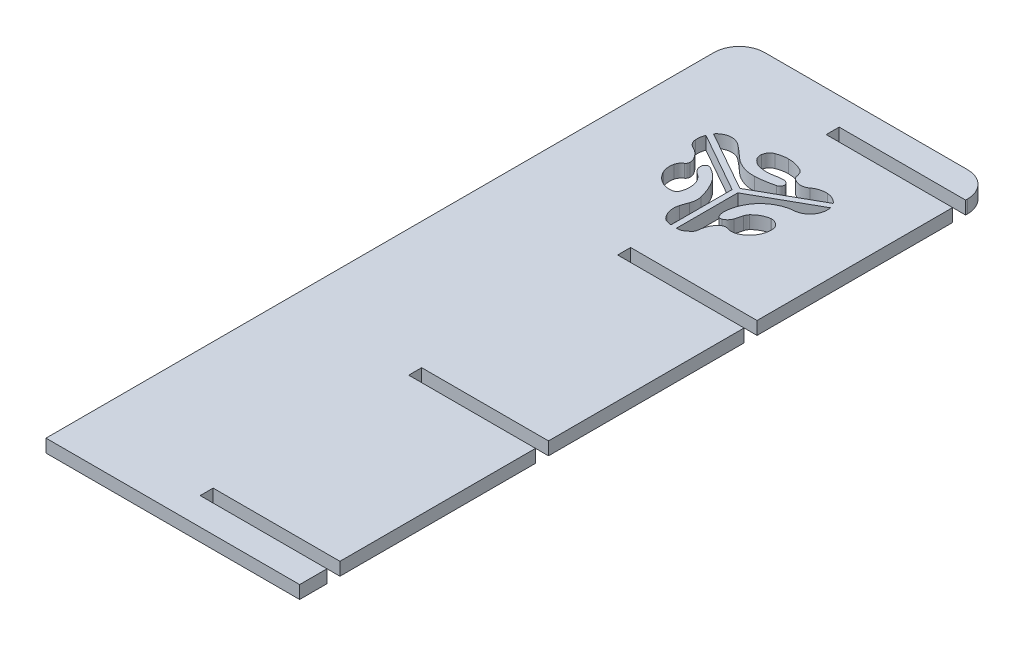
ISO-10303-21;
HEADER;
FILE_DESCRIPTION(('STEP AP214'),'2;1');
FILE_NAME('part.step','',(''),(''),'','','');
FILE_SCHEMA(('AUTOMOTIVE_DESIGN { 1 0 10303 214 1 1 1 1 }'));
ENDSEC;
DATA;
#1=APPLICATION_CONTEXT('core data for automotive mechanical design processes');
#2=APPLICATION_PROTOCOL_DEFINITION('international standard','automotive_design',2000,#1);
#3=PRODUCT_CONTEXT('',#1,'mechanical');
#4=PRODUCT('Part','Part','',(#3));
#5=PRODUCT_RELATED_PRODUCT_CATEGORY('part','',(#4));
#6=PRODUCT_DEFINITION_FORMATION('','',#4);
#7=PRODUCT_DEFINITION_CONTEXT('part definition',#1,'design');
#8=PRODUCT_DEFINITION('design','',#6,#7);
#9=PRODUCT_DEFINITION_SHAPE('','',#8);
#10=(LENGTH_UNIT() NAMED_UNIT(*) SI_UNIT(.MILLI.,.METRE.));
#11=(NAMED_UNIT(*) PLANE_ANGLE_UNIT() SI_UNIT($,.RADIAN.));
#12=(NAMED_UNIT(*) SI_UNIT($,.STERADIAN.) SOLID_ANGLE_UNIT());
#13=UNCERTAINTY_MEASURE_WITH_UNIT(LENGTH_MEASURE(1.E-05),#10,'distance_accuracy_value','');
#14=(GEOMETRIC_REPRESENTATION_CONTEXT(3) GLOBAL_UNCERTAINTY_ASSIGNED_CONTEXT((#13)) GLOBAL_UNIT_ASSIGNED_CONTEXT((#10,
#11,#12)) REPRESENTATION_CONTEXT('',''));
#15=CARTESIAN_POINT('',(0.,0.,0.));
#16=DIRECTION('',(0.,0.,1.));
#17=DIRECTION('',(1.,0.,0.));
#18=AXIS2_PLACEMENT_3D('',#15,#16,#17);
#19=CARTESIAN_POINT('',(348.013954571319,23.,-754.229373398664));
#20=DIRECTION('',(0.,1.,0.));
#21=DIRECTION('',(0.,0.,1.));
#22=AXIS2_PLACEMENT_3D('',#19,#20,#21);
#23=PLANE('',#22);
#24=DIRECTION('',(0.,0.,1.));
#25=VECTOR('',#24,1.);
#26=CARTESIAN_POINT('',(-56.9860454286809,23.,-754.229373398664));
#27=LINE('',#26,#25);
#28=CARTESIAN_POINT('',(-56.9860454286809,23.,-754.229373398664));
#29=VERTEX_POINT('',#28);
#30=CARTESIAN_POINT('',(-56.9860454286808,23.,430.770626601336));
#31=VERTEX_POINT('',#30);
#32=EDGE_CURVE('E1119',#29,#31,#27,.T.);
#33=ORIENTED_EDGE('',*,*,#32,.T.);
#34=DIRECTION('',(1.,0.,0.));
#35=VECTOR('',#34,1.);
#36=CARTESIAN_POINT('',(-56.9860454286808,23.,430.770626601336));
#37=LINE('',#36,#35);
#38=CARTESIAN_POINT('',(393.013954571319,23.,430.770626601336));
#39=VERTEX_POINT('',#38);
#40=EDGE_CURVE('E1122',#31,#39,#37,.T.);
#41=ORIENTED_EDGE('',*,*,#40,.T.);
#42=DIRECTION('',(0.,0.,-1.));
#43=VECTOR('',#42,1.);
#44=CARTESIAN_POINT('',(393.013954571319,23.,430.770626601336));
#45=LINE('',#44,#43);
#46=CARTESIAN_POINT('',(393.013954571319,23.,382.270626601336));
#47=VERTEX_POINT('',#46);
#48=EDGE_CURVE('E1125',#39,#47,#45,.T.);
#49=ORIENTED_EDGE('',*,*,#48,.T.);
#50=DIRECTION('',(-1.,0.,0.));
#51=VECTOR('',#50,1.);
#52=CARTESIAN_POINT('',(393.013954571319,23.,382.270626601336));
#53=LINE('',#52,#51);
#54=CARTESIAN_POINT('',(168.013954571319,23.,382.270626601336));
#55=VERTEX_POINT('',#54);
#56=EDGE_CURVE('E1127',#47,#55,#53,.T.);
#57=ORIENTED_EDGE('',*,*,#56,.T.);
#58=DIRECTION('',(0.,0.,-1.));
#59=VECTOR('',#58,1.);
#60=CARTESIAN_POINT('',(168.013954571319,23.,382.270626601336));
#61=LINE('',#60,#59);
#62=CARTESIAN_POINT('',(168.013954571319,23.,359.270626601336));
#63=VERTEX_POINT('',#62);
#64=EDGE_CURVE('E1129',#55,#63,#61,.T.);
#65=ORIENTED_EDGE('',*,*,#64,.T.);
#66=DIRECTION('',(1.,0.,0.));
#67=VECTOR('',#66,1.);
#68=CARTESIAN_POINT('',(168.013954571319,23.,359.270626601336));
#69=LINE('',#68,#67);
#70=CARTESIAN_POINT('',(393.013954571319,23.,359.270626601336));
#71=VERTEX_POINT('',#70);
#72=EDGE_CURVE('E1131',#63,#71,#69,.T.);
#73=ORIENTED_EDGE('',*,*,#72,.T.);
#74=DIRECTION('',(0.,0.,-1.));
#75=VECTOR('',#74,1.);
#76=CARTESIAN_POINT('',(393.013954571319,23.,359.270626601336));
#77=LINE('',#76,#75);
#78=CARTESIAN_POINT('',(393.013954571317,23.,12.2706266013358));
#79=VERTEX_POINT('',#78);
#80=EDGE_CURVE('E1133',#71,#79,#77,.T.);
#81=ORIENTED_EDGE('',*,*,#80,.T.);
#82=DIRECTION('',(-1.,0.,0.));
#83=VECTOR('',#82,1.);
#84=CARTESIAN_POINT('',(393.013954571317,23.,12.2706266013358));
#85=LINE('',#84,#83);
#86=CARTESIAN_POINT('',(168.013954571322,23.,12.2706266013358));
#87=VERTEX_POINT('',#86);
#88=EDGE_CURVE('E1135',#79,#87,#85,.T.);
#89=ORIENTED_EDGE('',*,*,#88,.T.);
#90=DIRECTION('',(-2.17217548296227E-13,0.,-1.));
#91=VECTOR('',#90,1.);
#92=CARTESIAN_POINT('',(168.013954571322,23.,12.2706266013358));
#93=LINE('',#92,#91);
#94=CARTESIAN_POINT('',(168.013954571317,23.,-10.7293733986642));
#95=VERTEX_POINT('',#94);
#96=EDGE_CURVE('E1137',#87,#95,#93,.T.);
#97=ORIENTED_EDGE('',*,*,#96,.T.);
#98=DIRECTION('',(1.,0.,0.));
#99=VECTOR('',#98,1.);
#100=CARTESIAN_POINT('',(168.013954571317,23.,-10.7293733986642));
#101=LINE('',#100,#99);
#102=CARTESIAN_POINT('',(393.013954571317,23.,-10.7293733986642));
#103=VERTEX_POINT('',#102);
#104=EDGE_CURVE('E1139',#95,#103,#101,.T.);
#105=ORIENTED_EDGE('',*,*,#104,.T.);
#106=DIRECTION('',(0.,0.,-1.));
#107=VECTOR('',#106,1.);
#108=CARTESIAN_POINT('',(393.013954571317,23.,-10.7293733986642));
#109=LINE('',#108,#107);
#110=CARTESIAN_POINT('',(393.013954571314,23.,-357.729373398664));
#111=VERTEX_POINT('',#110);
#112=EDGE_CURVE('E1141',#103,#111,#109,.T.);
#113=ORIENTED_EDGE('',*,*,#112,.T.);
#114=DIRECTION('',(-1.,0.,0.));
#115=VECTOR('',#114,1.);
#116=CARTESIAN_POINT('',(393.013954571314,23.,-357.729373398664));
#117=LINE('',#116,#115);
#118=CARTESIAN_POINT('',(168.716438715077,23.,-357.729373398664));
#119=VERTEX_POINT('',#118);
#120=EDGE_CURVE('E1143',#111,#119,#117,.T.);
#121=ORIENTED_EDGE('',*,*,#120,.T.);
#122=DIRECTION('',(0.,0.,-1.));
#123=VECTOR('',#122,1.);
#124=CARTESIAN_POINT('',(168.716438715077,23.,-357.729373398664));
#125=LINE('',#124,#123);
#126=CARTESIAN_POINT('',(168.716438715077,23.,-380.729373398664));
#127=VERTEX_POINT('',#126);
#128=EDGE_CURVE('E1145',#119,#127,#125,.T.);
#129=ORIENTED_EDGE('',*,*,#128,.T.);
#130=DIRECTION('',(1.,0.,0.));
#131=VECTOR('',#130,1.);
#132=CARTESIAN_POINT('',(168.716438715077,23.,-380.729373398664));
#133=LINE('',#132,#131);
#134=CARTESIAN_POINT('',(393.013954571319,23.,-380.729373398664));
#135=VERTEX_POINT('',#134);
#136=EDGE_CURVE('E1147',#127,#135,#133,.T.);
#137=ORIENTED_EDGE('',*,*,#136,.T.);
#138=DIRECTION('',(0.,0.,-1.));
#139=VECTOR('',#138,1.);
#140=CARTESIAN_POINT('',(393.013954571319,23.,-380.729373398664));
#141=LINE('',#140,#139);
#142=CARTESIAN_POINT('',(393.013954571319,23.,-727.729373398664));
#143=VERTEX_POINT('',#142);
#144=EDGE_CURVE('E1149',#135,#143,#141,.T.);
#145=ORIENTED_EDGE('',*,*,#144,.T.);
#146=DIRECTION('',(-1.,0.,0.));
#147=VECTOR('',#146,1.);
#148=CARTESIAN_POINT('',(393.013954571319,23.,-727.729373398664));
#149=LINE('',#148,#147);
#150=CARTESIAN_POINT('',(168.716438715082,23.,-727.729373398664));
#151=VERTEX_POINT('',#150);
#152=EDGE_CURVE('E1151',#143,#151,#149,.T.);
#153=ORIENTED_EDGE('',*,*,#152,.T.);
#154=DIRECTION('',(0.,0.,-1.));
#155=VECTOR('',#154,1.);
#156=CARTESIAN_POINT('',(168.716438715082,23.,-727.729373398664));
#157=LINE('',#156,#155);
#158=CARTESIAN_POINT('',(168.716438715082,23.,-750.729373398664));
#159=VERTEX_POINT('',#158);
#160=EDGE_CURVE('E1153',#151,#159,#157,.T.);
#161=ORIENTED_EDGE('',*,*,#160,.T.);
#162=DIRECTION('',(1.,0.,0.));
#163=VECTOR('',#162,1.);
#164=CARTESIAN_POINT('',(168.716438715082,23.,-750.729373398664));
#165=LINE('',#164,#163);
#166=CARTESIAN_POINT('',(393.013954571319,23.,-750.729373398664));
#167=VERTEX_POINT('',#166);
#168=EDGE_CURVE('E1155',#159,#167,#165,.T.);
#169=ORIENTED_EDGE('',*,*,#168,.T.);
#170=DIRECTION('',(0.,0.,-1.));
#171=VECTOR('',#170,1.);
#172=CARTESIAN_POINT('',(393.013954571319,23.,-750.729373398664));
#173=LINE('',#172,#171);
#174=CARTESIAN_POINT('',(393.013954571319,23.,-754.229373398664));
#175=VERTEX_POINT('',#174);
#176=EDGE_CURVE('E1157',#167,#175,#173,.T.);
#177=ORIENTED_EDGE('',*,*,#176,.T.);
#178=CARTESIAN_POINT('',(348.013954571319,23.,-754.229373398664));
#179=DIRECTION('',(0.,1.,0.));
#180=DIRECTION('',(0.,0.,1.));
#181=AXIS2_PLACEMENT_3D('',#178,#179,#180);
#182=CIRCLE('',#181,45.0000000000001);
#183=CARTESIAN_POINT('',(348.013954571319,23.,-799.229373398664));
#184=VERTEX_POINT('',#183);
#185=EDGE_CURVE('E1159',#175,#184,#182,.T.);
#186=ORIENTED_EDGE('',*,*,#185,.T.);
#187=DIRECTION('',(-1.,0.,0.));
#188=VECTOR('',#187,1.);
#189=CARTESIAN_POINT('',(348.013954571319,23.,-799.229373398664));
#190=LINE('',#189,#188);
#191=CARTESIAN_POINT('',(-11.986045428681,23.,-799.229373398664));
#192=VERTEX_POINT('',#191);
#193=EDGE_CURVE('E1161',#184,#192,#190,.T.);
#194=ORIENTED_EDGE('',*,*,#193,.T.);
#195=CARTESIAN_POINT('',(-11.9860454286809,23.,-754.229373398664));
#196=DIRECTION('',(0.,1.,0.));
#197=DIRECTION('',(0.,0.,1.));
#198=AXIS2_PLACEMENT_3D('',#195,#196,#197);
#199=CIRCLE('',#198,45.);
#200=EDGE_CURVE('E1163',#192,#29,#199,.T.);
#201=ORIENTED_EDGE('',*,*,#200,.T.);
#202=EDGE_LOOP('',(#33,#41,#49,#57,#65,#73,#81,#89,#97,#105,#113,#121,#129,#137,#145,#153,#161,
#169,#177,#186,#194,#201));
#203=FACE_BOUND('',#202,.T.);
#204=CARTESIAN_POINT('',(254.629978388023,23.,-613.087282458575));
#205=DIRECTION('',(0.,1.,0.));
#206=DIRECTION('',(0.,0.,-1.));
#207=AXIS2_PLACEMENT_3D('',#204,#205,#206);
#208=CIRCLE('',#207,31.0190369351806);
#209=CARTESIAN_POINT('',(254.209883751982,23.,-582.071090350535));
#210=VERTEX_POINT('',#209);
#211=CARTESIAN_POINT('',(285.062655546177,23.,-619.090016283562));
#212=VERTEX_POINT('',#211);
#213=EDGE_CURVE('E964',#210,#212,#208,.T.);
#214=ORIENTED_EDGE('',*,*,#213,.F.);
#215=CARTESIAN_POINT('',(263.53828806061,23.,-515.621072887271));
#216=DIRECTION('',(0.,-1.,0.));
#217=DIRECTION('',(0.,0.,1.));
#218=AXIS2_PLACEMENT_3D('',#215,#216,#217);
#219=CIRCLE('',#218,67.1015942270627);
#220=CARTESIAN_POINT('',(196.652379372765,23.,-520.996867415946));
#221=VERTEX_POINT('',#220);
#222=EDGE_CURVE('E962',#221,#210,#219,.T.);
#223=ORIENTED_EDGE('',*,*,#222,.F.);
#224=CARTESIAN_POINT('',(224.069221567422,23.,-518.793304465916));
#225=DIRECTION('',(0.,-1.,0.));
#226=DIRECTION('',(0.,0.,1.));
#227=AXIS2_PLACEMENT_3D('',#224,#225,#226);
#228=CIRCLE('',#227,27.5052526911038);
#229=CARTESIAN_POINT('',(198.569482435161,23.,-508.483007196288));
#230=VERTEX_POINT('',#229);
#231=EDGE_CURVE('E1006',#230,#221,#228,.T.);
#232=ORIENTED_EDGE('',*,*,#231,.F.);
#233=CARTESIAN_POINT('',(203.940282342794,23.,-510.654580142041));
#234=DIRECTION('',(0.,-1.,0.));
#235=DIRECTION('',(0.,0.,1.));
#236=AXIS2_PLACEMENT_3D('',#233,#234,#235);
#237=CIRCLE('',#236,5.79320470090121);
#238=CARTESIAN_POINT('',(206.111855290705,23.,-505.283780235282));
#239=VERTEX_POINT('',#238);
#240=EDGE_CURVE('E1003',#239,#230,#237,.T.);
#241=ORIENTED_EDGE('',*,*,#240,.F.);
#242=CARTESIAN_POINT('',(199.413300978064,23.,-521.850847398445));
#243=DIRECTION('',(0.,-1.,0.));
#244=DIRECTION('',(0.,0.,1.));
#245=AXIS2_PLACEMENT_3D('',#242,#243,#244);
#246=CIRCLE('',#245,17.8700404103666);
#247=CARTESIAN_POINT('',(216.359336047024,23.,-516.178965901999));
#248=VERTEX_POINT('',#247);
#249=EDGE_CURVE('E1001',#248,#239,#246,.T.);
#250=ORIENTED_EDGE('',*,*,#249,.F.);
#251=CARTESIAN_POINT('',(77.3667942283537,23.,-562.700126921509));
#252=DIRECTION('',(0.,-1.,0.));
#253=DIRECTION('',(0.,0.,1.));
#254=AXIS2_PLACEMENT_3D('',#251,#252,#253);
#255=CIRCLE('',#254,146.571296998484);
#256=CARTESIAN_POINT('',(220.188069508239,23.,-529.757321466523));
#257=VERTEX_POINT('',#256);
#258=EDGE_CURVE('E999',#257,#248,#255,.T.);
#259=ORIENTED_EDGE('',*,*,#258,.F.);
#260=CARTESIAN_POINT('',(234.495778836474,23.,-526.457140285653));
#261=DIRECTION('',(0.,1.,0.));
#262=DIRECTION('',(0.,0.,-1.));
#263=AXIS2_PLACEMENT_3D('',#260,#261,#262);
#264=CIRCLE('',#263,14.6833831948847);
#265=CARTESIAN_POINT('',(223.833462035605,23.,-536.552522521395));
#266=VERTEX_POINT('',#265);
#267=EDGE_CURVE('E997',#266,#257,#264,.T.);
#268=ORIENTED_EDGE('',*,*,#267,.F.);
#269=CARTESIAN_POINT('',(255.654437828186,23.,-506.4235252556));
#270=DIRECTION('',(0.,1.,0.));
#271=DIRECTION('',(0.,0.,-1.));
#272=AXIS2_PLACEMENT_3D('',#269,#270,#271);
#273=CIRCLE('',#272,43.8215811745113);
#274=CARTESIAN_POINT('',(248.891615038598,23.,-549.720121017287));
#275=VERTEX_POINT('',#274);
#276=EDGE_CURVE('E995',#275,#266,#273,.T.);
#277=ORIENTED_EDGE('',*,*,#276,.F.);
#278=CARTESIAN_POINT('',(249.254984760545,23.,-547.393774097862));
#279=DIRECTION('',(0.,1.,0.));
#280=DIRECTION('',(0.,0.,-1.));
#281=AXIS2_PLACEMENT_3D('',#278,#279,#280);
#282=CIRCLE('',#281,2.35455463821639);
#283=CARTESIAN_POINT('',(249.254984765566,23.,-549.748328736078));
#284=VERTEX_POINT('',#283);
#285=EDGE_CURVE('E993',#284,#275,#282,.T.);
#286=ORIENTED_EDGE('',*,*,#285,.F.);
#287=CARTESIAN_POINT('',(249.254984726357,23.,-531.359968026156));
#288=DIRECTION('',(0.,1.,0.));
#289=DIRECTION('',(0.,0.,-1.));
#290=AXIS2_PLACEMENT_3D('',#287,#288,#289);
#291=CIRCLE('',#290,18.3883607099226);
#292=CARTESIAN_POINT('',(265.698102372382,23.,-539.591352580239));
#293=VERTEX_POINT('',#292);
#294=EDGE_CURVE('E991',#293,#284,#291,.T.);
#295=ORIENTED_EDGE('',*,*,#294,.F.);
#296=CARTESIAN_POINT('',(256.76489662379,23.,-535.119411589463));
#297=DIRECTION('',(0.,1.,0.));
#298=DIRECTION('',(0.,0.,-1.));
#299=AXIS2_PLACEMENT_3D('',#296,#297,#298);
#300=CIRCLE('',#299,9.9900160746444);
#301=CARTESIAN_POINT('',(266.720188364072,23.,-535.95163003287));
#302=VERTEX_POINT('',#301);
#303=EDGE_CURVE('E989',#302,#293,#300,.T.);
#304=ORIENTED_EDGE('',*,*,#303,.F.);
#305=CARTESIAN_POINT('',(227.780006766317,23.,-532.696402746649));
#306=DIRECTION('',(0.,1.,0.));
#307=DIRECTION('',(0.,0.,-1.));
#308=AXIS2_PLACEMENT_3D('',#305,#306,#307);
#309=CIRCLE('',#308,39.0760060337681);
#310=CARTESIAN_POINT('',(241.400144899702,23.,-496.070918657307));
#311=VERTEX_POINT('',#310);
#312=EDGE_CURVE('E987',#311,#302,#309,.T.);
#313=ORIENTED_EDGE('',*,*,#312,.F.);
#314=CARTESIAN_POINT('',(233.427370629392,23.,-517.510254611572));
#315=DIRECTION('',(0.,1.,0.));
#316=DIRECTION('',(0.,0.,-1.));
#317=AXIS2_PLACEMENT_3D('',#314,#315,#316);
#318=CIRCLE('',#317,22.873789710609);
#319=CARTESIAN_POINT('',(225.704621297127,23.,-495.979592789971));
#320=VERTEX_POINT('',#319);
#321=EDGE_CURVE('E985',#320,#311,#318,.T.);
#322=ORIENTED_EDGE('',*,*,#321,.F.);
#323=CARTESIAN_POINT('',(221.810958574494,23.,-485.124244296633));
#324=DIRECTION('',(0.,-1.,0.));
#325=DIRECTION('',(0.,0.,1.));
#326=AXIS2_PLACEMENT_3D('',#323,#324,#325);
#327=CIRCLE('',#326,11.5325279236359);
#328=CARTESIAN_POINT('',(214.372307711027,23.,-493.937057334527));
#329=VERTEX_POINT('',#328);
#330=EDGE_CURVE('E983',#329,#320,#327,.T.);
#331=ORIENTED_EDGE('',*,*,#330,.F.);
#332=CARTESIAN_POINT('',(235.681178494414,23.,-468.691740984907));
#333=DIRECTION('',(0.,-1.,0.));
#334=DIRECTION('',(0.,0.,1.));
#335=AXIS2_PLACEMENT_3D('',#332,#333,#334);
#336=CIRCLE('',#335,33.0362523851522);
#337=CARTESIAN_POINT('',(204.643129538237,23.,-480.006929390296));
#338=VERTEX_POINT('',#337);
#339=EDGE_CURVE('E981',#338,#329,#336,.T.);
#340=ORIENTED_EDGE('',*,*,#339,.F.);
#341=CARTESIAN_POINT('',(253.080403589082,23.,-462.348703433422));
#342=DIRECTION('',(0.,-1.,0.));
#343=DIRECTION('',(0.,0.,1.));
#344=AXIS2_PLACEMENT_3D('',#341,#342,#343);
#345=CIRCLE('',#344,51.5556249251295);
#346=CARTESIAN_POINT('',(201.678087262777,23.,-466.321654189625));
#347=VERTEX_POINT('',#346);
#348=EDGE_CURVE('E979',#347,#338,#345,.T.);
#349=ORIENTED_EDGE('',*,*,#348,.F.);
#350=CARTESIAN_POINT('',(192.970751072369,23.,-466.994655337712));
#351=DIRECTION('',(0.,1.,0.));
#352=DIRECTION('',(0.,0.,-1.));
#353=AXIS2_PLACEMENT_3D('',#350,#351,#352);
#354=CIRCLE('',#353,8.73330602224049);
#355=CARTESIAN_POINT('',(199.413300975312,23.,-461.098539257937));
#356=VERTEX_POINT('',#355);
#357=EDGE_CURVE('E977',#356,#347,#354,.T.);
#358=ORIENTED_EDGE('',*,*,#357,.F.);
#359=CARTESIAN_POINT('',(168.381890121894,23.,-489.497977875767));
#360=DIRECTION('',(0.,1.,0.));
#361=DIRECTION('',(0.,0.,-1.));
#362=AXIS2_PLACEMENT_3D('',#359,#360,#361);
#363=CIRCLE('',#362,42.0651467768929);
#364=CARTESIAN_POINT('',(190.459882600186,23.,-453.692408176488));
#365=VERTEX_POINT('',#364);
#366=EDGE_CURVE('E975',#365,#356,#363,.T.);
#367=ORIENTED_EDGE('',*,*,#366,.F.);
#368=CARTESIAN_POINT('',(181.371939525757,23.,-468.431020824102));
#369=DIRECTION('',(0.,1.,0.));
#370=DIRECTION('',(0.,0.,-1.));
#371=AXIS2_PLACEMENT_3D('',#368,#369,#370);
#372=CIRCLE('',#371,17.3152364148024);
#373=CARTESIAN_POINT('',(183.127865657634,23.,-451.205048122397));
#374=VERTEX_POINT('',#373);
#375=EDGE_CURVE('E973',#374,#365,#372,.T.);
#376=ORIENTED_EDGE('',*,*,#375,.F.);
#377=CARTESIAN_POINT('',(177.004087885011,23.,-511.280484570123));
#378=DIRECTION('',(0.,1.,0.));
#379=DIRECTION('',(0.,0.,-1.));
#380=AXIS2_PLACEMENT_3D('',#377,#378,#379);
#381=CIRCLE('',#380,60.3867429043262);
#382=CARTESIAN_POINT('',(179.753700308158,23.,-450.956373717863));
#383=VERTEX_POINT('',#382);
#384=EDGE_CURVE('E971',#383,#374,#381,.T.);
#385=ORIENTED_EDGE('',*,*,#384,.F.);
#386=DIRECTION('',(-3.24669998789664E-05,0.,0.999999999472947));
#387=VECTOR('',#386,1.);
#388=CARTESIAN_POINT('',(179.757233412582,23.,-559.777774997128));
#389=LINE('',#388,#387);
#390=CARTESIAN_POINT('',(179.757233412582,23.,-559.777774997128));
#391=VERTEX_POINT('',#390);
#392=EDGE_CURVE('E969',#391,#383,#389,.T.);
#393=ORIENTED_EDGE('',*,*,#392,.F.);
#394=DIRECTION('',(-0.871299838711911,0.,0.490751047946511));
#395=VECTOR('',#394,1.);
#396=CARTESIAN_POINT('',(179.757233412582,23.,-559.777774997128));
#397=LINE('',#396,#395);
#398=EDGE_CURVE('E967',#212,#391,#397,.T.);
#399=ORIENTED_EDGE('',*,*,#398,.F.);
#400=EDGE_LOOP('',(#214,#223,#232,#241,#250,#259,#268,#277,#286,#295,#304,#313,#322,#331,#340,
#349,#358,#367,#376,#385,#393,#399));
#401=FACE_BOUND('',#400,.T.);
#402=DIRECTION('',(0.000467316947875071,0.,-0.999999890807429));
#403=VECTOR('',#402,1.);
#404=CARTESIAN_POINT('',(169.757233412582,23.,-559.780816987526));
#405=LINE('',#404,#403);
#406=CARTESIAN_POINT('',(169.706555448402,23.,-451.336304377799));
#407=VERTEX_POINT('',#406);
#408=CARTESIAN_POINT('',(169.757233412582,23.,-559.780816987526));
#409=VERTEX_POINT('',#408);
#410=EDGE_CURVE('E772',#407,#409,#405,.T.);
#411=ORIENTED_EDGE('',*,*,#410,.F.);
#412=CARTESIAN_POINT('',(177.004087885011,23.,-511.280484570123));
#413=DIRECTION('',(0.,1.,0.));
#414=DIRECTION('',(0.,0.,-1.));
#415=AXIS2_PLACEMENT_3D('',#412,#413,#414);
#416=CIRCLE('',#415,60.3867429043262);
#417=CARTESIAN_POINT('',(161.535506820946,23.,-452.908558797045));
#418=VERTEX_POINT('',#417);
#419=EDGE_CURVE('E770',#418,#407,#416,.T.);
#420=ORIENTED_EDGE('',*,*,#419,.F.);
#421=CARTESIAN_POINT('',(165.169426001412,23.,-466.62144298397));
#422=DIRECTION('',(0.,1.,0.));
#423=DIRECTION('',(0.,0.,-1.));
#424=AXIS2_PLACEMENT_3D('',#421,#422,#423);
#425=CIRCLE('',#424,14.1862102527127);
#426=CARTESIAN_POINT('',(154.24342873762,23.,-457.57317546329));
#427=VERTEX_POINT('',#426);
#428=EDGE_CURVE('E824',#427,#418,#425,.T.);
#429=ORIENTED_EDGE('',*,*,#428,.F.);
#430=CARTESIAN_POINT('',(181.963124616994,23.,-480.528995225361));
#431=DIRECTION('',(0.,1.,0.));
#432=DIRECTION('',(0.,0.,-1.));
#433=AXIS2_PLACEMENT_3D('',#430,#431,#432);
#434=CIRCLE('',#433,35.9909877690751);
#435=CARTESIAN_POINT('',(150.244687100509,23.,-463.520411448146));
#436=VERTEX_POINT('',#435);
#437=EDGE_CURVE('E821',#436,#427,#434,.T.);
#438=ORIENTED_EDGE('',*,*,#437,.F.);
#439=CARTESIAN_POINT('',(179.605299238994,23.,-479.264643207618));
#440=DIRECTION('',(0.,1.,0.));
#441=DIRECTION('',(0.,0.,-1.));
#442=AXIS2_PLACEMENT_3D('',#439,#440,#441);
#443=CIRCLE('',#442,33.3155576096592);
#444=CARTESIAN_POINT('',(147.664890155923,23.,-488.737586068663));
#445=VERTEX_POINT('',#444);
#446=EDGE_CURVE('E819',#445,#436,#443,.T.);
#447=ORIENTED_EDGE('',*,*,#446,.F.);
#448=CARTESIAN_POINT('',(280.217666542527,23.,-449.424849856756));
#449=DIRECTION('',(0.,1.,0.));
#450=DIRECTION('',(0.,0.,-1.));
#451=AXIS2_PLACEMENT_3D('',#448,#449,#450);
#452=CIRCLE('',#451,138.25964615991);
#453=CARTESIAN_POINT('',(152.095674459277,23.,-501.391039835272));
#454=VERTEX_POINT('',#453);
#455=EDGE_CURVE('E817',#454,#445,#452,.T.);
#456=ORIENTED_EDGE('',*,*,#455,.F.);
#457=CARTESIAN_POINT('',(122.956903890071,23.,-513.209704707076));
#458=DIRECTION('',(0.,-1.,0.));
#459=DIRECTION('',(0.,0.,1.));
#460=AXIS2_PLACEMENT_3D('',#457,#458,#459);
#461=CIRCLE('',#460,31.4443761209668);
#462=CARTESIAN_POINT('',(153.546059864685,23.,-520.493407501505));
#463=VERTEX_POINT('',#462);
#464=EDGE_CURVE('E815',#463,#454,#461,.T.);
#465=ORIENTED_EDGE('',*,*,#464,.F.);
#466=CARTESIAN_POINT('',(41.6396339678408,23.,-493.846933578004));
#467=DIRECTION('',(0.,-1.,0.));
#468=DIRECTION('',(0.,0.,1.));
#469=AXIS2_PLACEMENT_3D('',#466,#467,#468);
#470=CIRCLE('',#469,115.035136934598);
#471=CARTESIAN_POINT('',(142.368340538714,23.,-549.406004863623));
#472=VERTEX_POINT('',#471);
#473=EDGE_CURVE('E813',#472,#463,#470,.T.);
#474=ORIENTED_EDGE('',*,*,#473,.F.);
#475=CARTESIAN_POINT('',(89.9811403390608,23.,-520.510724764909));
#476=DIRECTION('',(0.,-1.,0.));
#477=DIRECTION('',(0.,0.,1.));
#478=AXIS2_PLACEMENT_3D('',#475,#476,#477);
#479=CIRCLE('',#478,59.8277189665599);
#480=CARTESIAN_POINT('',(115.966177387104,23.,-574.400740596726));
#481=VERTEX_POINT('',#480);
#482=EDGE_CURVE('E811',#481,#472,#479,.T.);
#483=ORIENTED_EDGE('',*,*,#482,.F.);
#484=CARTESIAN_POINT('',(113.088202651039,23.,-568.432147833));
#485=DIRECTION('',(0.,-1.,0.));
#486=DIRECTION('',(0.,0.,1.));
#487=AXIS2_PLACEMENT_3D('',#484,#485,#486);
#488=CIRCLE('',#487,6.6262235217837);
#489=CARTESIAN_POINT('',(106.693214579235,23.,-570.167361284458));
#490=VERTEX_POINT('',#489);
#491=EDGE_CURVE('E809',#490,#481,#488,.T.);
#492=ORIENTED_EDGE('',*,*,#491,.F.);
#493=CARTESIAN_POINT('',(119.580154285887,23.,-566.670624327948));
#494=DIRECTION('',(0.,-1.,0.));
#495=DIRECTION('',(0.,0.,1.));
#496=AXIS2_PLACEMENT_3D('',#493,#494,#495);
#497=CIRCLE('',#496,13.3529166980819);
#498=CARTESIAN_POINT('',(108.75785431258,23.,-558.848974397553));
#499=VERTEX_POINT('',#498);
#500=EDGE_CURVE('E807',#499,#490,#497,.T.);
#501=ORIENTED_EDGE('',*,*,#500,.F.);
#502=CARTESIAN_POINT('',(127.928565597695,23.,-572.704309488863));
#503=DIRECTION('',(0.,-1.,0.));
#504=DIRECTION('',(0.,0.,1.));
#505=AXIS2_PLACEMENT_3D('',#502,#503,#504);
#506=CIRCLE('',#505,23.6534665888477);
#507=CARTESIAN_POINT('',(115.000666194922,23.,-552.896333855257));
#508=VERTEX_POINT('',#507);
#509=EDGE_CURVE('E805',#508,#499,#506,.T.);
#510=ORIENTED_EDGE('',*,*,#509,.F.);
#511=CARTESIAN_POINT('',(98.7260846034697,23.,-527.960611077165));
#512=DIRECTION('',(0.,1.,0.));
#513=DIRECTION('',(0.,0.,-1.));
#514=AXIS2_PLACEMENT_3D('',#511,#512,#513);
#515=CIRCLE('',#514,29.7767069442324);
#516=CARTESIAN_POINT('',(127.92856559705,23.,-533.780179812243));
#517=VERTEX_POINT('',#516);
#518=EDGE_CURVE('E803',#517,#508,#515,.T.);
#519=ORIENTED_EDGE('',*,*,#518,.F.);
#520=CARTESIAN_POINT('',(86.8970445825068,23.,-525.603280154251));
#521=DIRECTION('',(0.,1.,0.));
#522=DIRECTION('',(0.,0.,-1.));
#523=AXIS2_PLACEMENT_3D('',#520,#521,#522);
#524=CIRCLE('',#523,41.8383484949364);
#525=CARTESIAN_POINT('',(126.637453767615,23.,-512.520953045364));
#526=VERTEX_POINT('',#525);
#527=EDGE_CURVE('E801',#526,#517,#524,.T.);
#528=ORIENTED_EDGE('',*,*,#527,.F.);
#529=CARTESIAN_POINT('',(115.994526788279,23.,-516.024546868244));
#530=DIRECTION('',(0.,1.,0.));
#531=DIRECTION('',(0.,0.,-1.));
#532=AXIS2_PLACEMENT_3D('',#529,#530,#531);
#533=CIRCLE('',#532,11.2047786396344);
#534=CARTESIAN_POINT('',(118.147559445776,23.,-505.028569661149));
#535=VERTEX_POINT('',#534);
#536=EDGE_CURVE('E799',#535,#526,#533,.T.);
#537=ORIENTED_EDGE('',*,*,#536,.F.);
#538=CARTESIAN_POINT('',(114.034056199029,23.,-526.03707029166));
#539=DIRECTION('',(0.,1.,0.));
#540=DIRECTION('',(0.,0.,-1.));
#541=AXIS2_PLACEMENT_3D('',#538,#539,#540);
#542=CIRCLE('',#541,21.4074287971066);
#543=CARTESIAN_POINT('',(113.876430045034,23.,-504.630221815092));
#544=VERTEX_POINT('',#543);
#545=EDGE_CURVE('E797',#544,#535,#542,.T.);
#546=ORIENTED_EDGE('',*,*,#545,.F.);
#547=CARTESIAN_POINT('',(114.131729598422,23.,-539.301871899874));
#548=DIRECTION('',(0.,1.,0.));
#549=DIRECTION('',(0.,0.,-1.));
#550=AXIS2_PLACEMENT_3D('',#547,#548,#549);
#551=CIRCLE('',#550,34.6725900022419);
#552=CARTESIAN_POINT('',(87.6335907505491,23.,-516.940361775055));
#553=VERTEX_POINT('',#552);
#554=EDGE_CURVE('E795',#553,#544,#551,.T.);
#555=ORIENTED_EDGE('',*,*,#554,.F.);
#556=CARTESIAN_POINT('',(127.075811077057,23.,-550.225250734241));
#557=DIRECTION('',(0.,1.,0.));
#558=DIRECTION('',(0.,0.,-1.));
#559=AXIS2_PLACEMENT_3D('',#556,#557,#558);
#560=CIRCLE('',#559,51.6098108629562);
#561=CARTESIAN_POINT('',(82.0336273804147,23.,-525.030523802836));
#562=VERTEX_POINT('',#561);
#563=EDGE_CURVE('E793',#562,#553,#560,.T.);
#564=ORIENTED_EDGE('',*,*,#563,.F.);
#565=CARTESIAN_POINT('',(96.8984288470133,23.,-533.345276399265));
#566=DIRECTION('',(0.,1.,0.));
#567=DIRECTION('',(0.,0.,-1.));
#568=AXIS2_PLACEMENT_3D('',#565,#566,#567);
#569=CIRCLE('',#568,17.0322468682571);
#570=CARTESIAN_POINT('',(81.4243987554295,23.,-526.228266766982));
#571=VERTEX_POINT('',#570);
#572=EDGE_CURVE('E791',#571,#562,#569,.T.);
#573=ORIENTED_EDGE('',*,*,#572,.F.);
#574=CARTESIAN_POINT('',(110.643683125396,23.,-539.667165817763));
#575=DIRECTION('',(0.,1.,0.));
#576=DIRECTION('',(0.,0.,-1.));
#577=AXIS2_PLACEMENT_3D('',#574,#575,#576);
#578=CIRCLE('',#577,32.1616322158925);
#579=CARTESIAN_POINT('',(79.3301670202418,23.,-547.00435164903));
#580=VERTEX_POINT('',#579);
#581=EDGE_CURVE('E789',#580,#571,#578,.T.);
#582=ORIENTED_EDGE('',*,*,#581,.F.);
#583=CARTESIAN_POINT('',(96.3707024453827,23.,-543.011520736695));
#584=DIRECTION('',(0.,1.,0.));
#585=DIRECTION('',(0.,0.,-1.));
#586=AXIS2_PLACEMENT_3D('',#583,#584,#585);
#587=CIRCLE('',#586,17.5020726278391);
#588=CARTESIAN_POINT('',(86.8970445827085,23.,-557.72791815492));
#589=VERTEX_POINT('',#588);
#590=EDGE_CURVE('E787',#589,#580,#587,.T.);
#591=ORIENTED_EDGE('',*,*,#590,.F.);
#592=CARTESIAN_POINT('',(82.6827586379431,23.,-564.274397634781));
#593=DIRECTION('',(0.,-1.,0.));
#594=DIRECTION('',(0.,0.,1.));
#595=AXIS2_PLACEMENT_3D('',#592,#593,#594);
#596=CIRCLE('',#595,7.78566629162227);
#597=CARTESIAN_POINT('',(90.4684249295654,23.,-564.274397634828));
#598=VERTEX_POINT('',#597);
#599=EDGE_CURVE('E785',#598,#589,#596,.T.);
#600=ORIENTED_EDGE('',*,*,#599,.F.);
#601=CARTESIAN_POINT('',(71.8384786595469,23.,-564.274397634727));
#602=DIRECTION('',(0.,-1.,0.));
#603=DIRECTION('',(0.,0.,1.));
#604=AXIS2_PLACEMENT_3D('',#601,#602,#603);
#605=CIRCLE('',#604,18.6299462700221);
#606=CARTESIAN_POINT('',(88.0095263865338,23.,-573.52491726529));
#607=VERTEX_POINT('',#606);
#608=EDGE_CURVE('E783',#607,#598,#605,.T.);
#609=ORIENTED_EDGE('',*,*,#608,.F.);
#610=CARTESIAN_POINT('',(53.2778513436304,23.,-553.656937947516));
#611=DIRECTION('',(0.,-1.,0.));
#612=DIRECTION('',(0.,0.,1.));
#613=AXIS2_PLACEMENT_3D('',#610,#611,#612);
#614=CIRCLE('',#613,40.0128211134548);
#615=CARTESIAN_POINT('',(70.0301059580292,23.,-589.994078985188));
#616=VERTEX_POINT('',#615);
#617=EDGE_CURVE('E781',#616,#607,#614,.T.);
#618=ORIENTED_EDGE('',*,*,#617,.F.);
#619=CARTESIAN_POINT('',(76.7175285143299,23.,-604.499697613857));
#620=DIRECTION('',(0.,1.,0.));
#621=DIRECTION('',(0.,0.,-1.));
#622=AXIS2_PLACEMENT_3D('',#619,#620,#621);
#623=CIRCLE('',#622,15.9729331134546);
#624=CARTESIAN_POINT('',(60.7787449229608,23.,-603.455777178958));
#625=VERTEX_POINT('',#624);
#626=EDGE_CURVE('E779',#625,#616,#623,.T.);
#627=ORIENTED_EDGE('',*,*,#626,.F.);
#628=CARTESIAN_POINT('',(102.414902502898,23.,-606.182762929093));
#629=DIRECTION('',(0.,1.,0.));
#630=DIRECTION('',(0.,0.,-1.));
#631=AXIS2_PLACEMENT_3D('',#628,#629,#630);
#632=CIRCLE('',#631,41.7253648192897);
#633=CARTESIAN_POINT('',(63.0518196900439,23.,-620.02305847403));
#634=VERTEX_POINT('',#633);
#635=EDGE_CURVE('E777',#634,#625,#632,.T.);
#636=ORIENTED_EDGE('',*,*,#635,.F.);
#637=DIRECTION('',(-0.870805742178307,0.,-0.491627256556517));
#638=VECTOR('',#637,1.);
#639=CARTESIAN_POINT('',(63.0518196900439,23.,-620.02305847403));
#640=LINE('',#639,#638);
#641=EDGE_CURVE('E775',#409,#634,#640,.T.);
#642=ORIENTED_EDGE('',*,*,#641,.F.);
#643=EDGE_LOOP('',(#411,#420,#429,#438,#447,#456,#465,#474,#483,#492,#501,#510,#519,#528,#537,
#546,#555,#564,#573,#582,#591,#600,#609,#618,#627,#636,#642));
#644=FACE_BOUND('',#643,.T.);
#645=CARTESIAN_POINT('',(89.1179064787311,23.,-612.746327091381));
#646=DIRECTION('',(0.,1.,0.));
#647=DIRECTION('',(0.,0.,-1.));
#648=AXIS2_PLACEMENT_3D('',#645,#646,#647);
#649=CIRCLE('',#648,26.8966602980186);
#650=CARTESIAN_POINT('',(105.606403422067,23.,-633.996263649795));
#651=VERTEX_POINT('',#650);
#652=CARTESIAN_POINT('',(67.6149771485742,23.,-628.903503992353));
#653=VERTEX_POINT('',#652);
#654=EDGE_CURVE('E615',#651,#653,#649,.T.);
#655=ORIENTED_EDGE('',*,*,#654,.F.);
#656=CARTESIAN_POINT('',(-64.5532648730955,23.,-414.699006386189));
#657=DIRECTION('',(0.,1.,0.));
#658=DIRECTION('',(0.,0.,-1.));
#659=AXIS2_PLACEMENT_3D('',#656,#657,#658);
#660=CIRCLE('',#659,277.570891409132);
#661=CARTESIAN_POINT('',(126.637453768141,23.,-615.924523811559));
#662=VERTEX_POINT('',#661);
#663=EDGE_CURVE('E607',#662,#651,#660,.T.);
#664=ORIENTED_EDGE('',*,*,#663,.F.);
#665=CARTESIAN_POINT('',(166.483920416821,23.,-657.862364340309));
#666=DIRECTION('',(0.,-1.,0.));
#667=DIRECTION('',(0.,0.,1.));
#668=AXIS2_PLACEMENT_3D('',#665,#666,#667);
#669=CIRCLE('',#668,57.8491432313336);
#670=CARTESIAN_POINT('',(169.512768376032,23.,-600.092567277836));
#671=VERTEX_POINT('',#670);
#672=EDGE_CURVE('E668',#671,#662,#669,.T.);
#673=ORIENTED_EDGE('',*,*,#672,.F.);
#674=CARTESIAN_POINT('',(160.855708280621,23.,-765.210332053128));
#675=DIRECTION('',(0.,-1.,0.));
#676=DIRECTION('',(0.,0.,1.));
#677=AXIS2_PLACEMENT_3D('',#674,#675,#676);
#678=CIRCLE('',#677,165.344552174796);
#679=CARTESIAN_POINT('',(203.259836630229,23.,-605.395718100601));
#680=VERTEX_POINT('',#679);
#681=EDGE_CURVE('E666',#680,#671,#678,.T.);
#682=ORIENTED_EDGE('',*,*,#681,.F.);
#683=CARTESIAN_POINT('',(201.116178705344,23.,-613.474833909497));
#684=DIRECTION('',(0.,-1.,0.));
#685=DIRECTION('',(0.,0.,1.));
#686=AXIS2_PLACEMENT_3D('',#683,#684,#685);
#687=CIRCLE('',#686,8.35867103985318);
#688=CARTESIAN_POINT('',(209.474849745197,23.,-613.47483390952));
#689=VERTEX_POINT('',#688);
#690=EDGE_CURVE('E664',#689,#680,#687,.T.);
#691=ORIENTED_EDGE('',*,*,#690,.F.);
#692=CARTESIAN_POINT('',(203.785715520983,23.,-613.474833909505));
#693=DIRECTION('',(0.,-1.,0.));
#694=DIRECTION('',(0.,0.,1.));
#695=AXIS2_PLACEMENT_3D('',#692,#693,#694);
#696=CIRCLE('',#695,5.68913422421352);
#697=CARTESIAN_POINT('',(207.741339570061,23.,-617.563756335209));
#698=VERTEX_POINT('',#697);
#699=EDGE_CURVE('E662',#698,#689,#696,.T.);
#700=ORIENTED_EDGE('',*,*,#699,.F.);
#701=CARTESIAN_POINT('',(200.18999515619,23.,-609.757943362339));
#702=DIRECTION('',(0.,-1.,0.));
#703=DIRECTION('',(0.,0.,1.));
#704=AXIS2_PLACEMENT_3D('',#701,#702,#703);
#705=CIRCLE('',#704,10.8606408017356);
#706=CARTESIAN_POINT('',(199.413300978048,23.,-620.590776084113));
#707=VERTEX_POINT('',#706);
#708=EDGE_CURVE('E660',#707,#698,#705,.T.);
#709=ORIENTED_EDGE('',*,*,#708,.F.);
#710=CARTESIAN_POINT('',(207.041870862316,23.,-514.192371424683));
#711=DIRECTION('',(0.,-1.,0.));
#712=DIRECTION('',(0.,0.,1.));
#713=AXIS2_PLACEMENT_3D('',#710,#711,#712);
#714=CIRCLE('',#713,106.671531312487);
#715=CARTESIAN_POINT('',(185.190532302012,23.,-618.601827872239));
#716=VERTEX_POINT('',#715);
#717=EDGE_CURVE('E658',#716,#707,#714,.T.);
#718=ORIENTED_EDGE('',*,*,#717,.F.);
#719=CARTESIAN_POINT('',(173.02312028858,23.,-676.739816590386));
#720=DIRECTION('',(0.,1.,0.));
#721=DIRECTION('',(0.,0.,-1.));
#722=AXIS2_PLACEMENT_3D('',#719,#720,#721);
#723=CIRCLE('',#722,59.3975727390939);
#724=CARTESIAN_POINT('',(160.85570827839,23.,-618.601827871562));
#725=VERTEX_POINT('',#724);
#726=EDGE_CURVE('E656',#725,#716,#723,.T.);
#727=ORIENTED_EDGE('',*,*,#726,.F.);
#728=CARTESIAN_POINT('',(166.440799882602,23.,-645.288356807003));
#729=DIRECTION('',(0.,1.,0.));
#730=DIRECTION('',(0.,0.,-1.));
#731=AXIS2_PLACEMENT_3D('',#728,#729,#730);
#732=CIRCLE('',#731,27.2647038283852);
#733=CARTESIAN_POINT('',(145.633181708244,23.,-627.66998285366));
#734=VERTEX_POINT('',#733);
#735=EDGE_CURVE('E654',#734,#725,#732,.T.);
#736=ORIENTED_EDGE('',*,*,#735,.F.);
#737=CARTESIAN_POINT('',(157.550714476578,23.,-637.760880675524));
#738=DIRECTION('',(0.,1.,0.));
#739=DIRECTION('',(0.,0.,-1.));
#740=AXIS2_PLACEMENT_3D('',#737,#738,#739);
#741=CIRCLE('',#740,15.615819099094);
#742=CARTESIAN_POINT('',(142.048731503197,23.,-639.642988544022));
#743=VERTEX_POINT('',#742);
#744=EDGE_CURVE('E652',#743,#734,#741,.T.);
#745=ORIENTED_EDGE('',*,*,#744,.F.);
#746=CARTESIAN_POINT('',(158.510599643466,23.,-637.644340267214));
#747=DIRECTION('',(0.,1.,0.));
#748=DIRECTION('',(0.,0.,-1.));
#749=AXIS2_PLACEMENT_3D('',#746,#747,#748);
#750=CIRCLE('',#749,16.5827530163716);
#751=CARTESIAN_POINT('',(152.487246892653,23.,-653.094483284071));
#752=VERTEX_POINT('',#751);
#753=EDGE_CURVE('E650',#752,#743,#750,.T.);
#754=ORIENTED_EDGE('',*,*,#753,.F.);
#755=CARTESIAN_POINT('',(173.02312027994,23.,-600.419138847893));
#756=DIRECTION('',(0.,1.,0.));
#757=DIRECTION('',(0.,0.,-1.));
#758=AXIS2_PLACEMENT_3D('',#755,#756,#757);
#759=CIRCLE('',#758,56.5368376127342);
#760=CARTESIAN_POINT('',(173.023120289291,23.,-656.955976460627));
#761=VERTEX_POINT('',#760);
#762=EDGE_CURVE('E648',#761,#752,#759,.T.);
#763=ORIENTED_EDGE('',*,*,#762,.F.);
#764=CARTESIAN_POINT('',(173.023120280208,23.,-602.04158315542));
#765=DIRECTION('',(0.,1.,0.));
#766=DIRECTION('',(0.,0.,-1.));
#767=AXIS2_PLACEMENT_3D('',#764,#765,#766);
#768=CIRCLE('',#767,54.9143933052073);
#769=CARTESIAN_POINT('',(199.413300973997,23.,-650.199126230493));
#770=VERTEX_POINT('',#769);
#771=EDGE_CURVE('E646',#770,#761,#768,.T.);
#772=ORIENTED_EDGE('',*,*,#771,.F.);
#773=CARTESIAN_POINT('',(193.825036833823,23.,-640.001504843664));
#774=DIRECTION('',(0.,1.,0.));
#775=DIRECTION('',(0.,0.,-1.));
#776=AXIS2_PLACEMENT_3D('',#773,#774,#775);
#777=CIRCLE('',#776,11.6284211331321);
#778=CARTESIAN_POINT('',(204.643129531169,23.,-644.266366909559));
#779=VERTEX_POINT('',#778);
#780=EDGE_CURVE('E644',#779,#770,#777,.T.);
#781=ORIENTED_EDGE('',*,*,#780,.F.);
#782=CARTESIAN_POINT('',(168.797386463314,23.,-630.134749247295));
#783=DIRECTION('',(0.,1.,0.));
#784=DIRECTION('',(0.,0.,-1.));
#785=AXIS2_PLACEMENT_3D('',#782,#783,#784);
#786=CIRCLE('',#785,38.5307658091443);
#787=CARTESIAN_POINT('',(206.58926312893,23.,-637.644341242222));
#788=VERTEX_POINT('',#787);
#789=EDGE_CURVE('E642',#788,#779,#786,.T.);
#790=ORIENTED_EDGE('',*,*,#789,.F.);
#791=CARTESIAN_POINT('',(215.834302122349,23.,-639.481415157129));
#792=DIRECTION('',(0.,-1.,0.));
#793=DIRECTION('',(0.,0.,1.));
#794=AXIS2_PLACEMENT_3D('',#791,#792,#793);
#795=CIRCLE('',#794,9.4257936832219);
#796=CARTESIAN_POINT('',(209.474849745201,23.,-632.524192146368));
#797=VERTEX_POINT('',#796);
#798=EDGE_CURVE('E640',#797,#788,#795,.T.);
#799=ORIENTED_EDGE('',*,*,#798,.F.);
#800=CARTESIAN_POINT('',(223.64095190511,23.,-648.021868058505));
#801=DIRECTION('',(0.,-1.,0.));
#802=DIRECTION('',(0.,0.,1.));
#803=AXIS2_PLACEMENT_3D('',#800,#801,#802);
#804=CIRCLE('',#803,20.9965808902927);
#805=CARTESIAN_POINT('',(236.157630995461,23.,-631.163957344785));
#806=VERTEX_POINT('',#805);
#807=EDGE_CURVE('E638',#806,#797,#804,.T.);
#808=ORIENTED_EDGE('',*,*,#807,.F.);
#809=CARTESIAN_POINT('',(258.226213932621,23.,-601.44120116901));
#810=DIRECTION('',(0.,1.,0.));
#811=DIRECTION('',(0.,0.,-1.));
#812=AXIS2_PLACEMENT_3D('',#809,#810,#811);
#813=CIRCLE('',#812,37.0197864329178);
#814=CARTESIAN_POINT('',(259.982325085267,23.,-638.419311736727));
#815=VERTEX_POINT('',#814);
#816=EDGE_CURVE('E636',#815,#806,#813,.T.);
#817=ORIENTED_EDGE('',*,*,#816,.F.);
#818=CARTESIAN_POINT('',(258.608486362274,23.,-609.490641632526));
#819=DIRECTION('',(0.,1.,0.));
#820=DIRECTION('',(0.,0.,-1.));
#821=AXIS2_PLACEMENT_3D('',#818,#819,#820);
#822=CIRCLE('',#821,28.9612739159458);
#823=CARTESIAN_POINT('',(280.747245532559,23.,-628.162297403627));
#824=VERTEX_POINT('',#823);
#825=EDGE_CURVE('E634',#824,#815,#822,.T.);
#826=ORIENTED_EDGE('',*,*,#825,.F.);
#827=DIRECTION('',(0.87120918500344,0.,-0.490911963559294));
#828=VECTOR('',#827,1.);
#829=CARTESIAN_POINT('',(174.759837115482,23.,-568.440146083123));
#830=LINE('',#829,#828);
#831=CARTESIAN_POINT('',(174.759837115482,23.,-568.440146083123));
#832=VERTEX_POINT('',#831);
#833=EDGE_CURVE('E630',#832,#824,#830,.T.);
#834=ORIENTED_EDGE('',*,*,#833,.F.);
#835=DIRECTION('',(0.87089961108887,0.,0.491460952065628));
#836=VECTOR('',#835,1.);
#837=CARTESIAN_POINT('',(67.6149771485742,23.,-628.903503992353));
#838=LINE('',#837,#836);
#839=EDGE_CURVE('E628',#653,#832,#838,.T.);
#840=ORIENTED_EDGE('',*,*,#839,.F.);
#841=EDGE_LOOP('',(#655,#664,#673,#682,#691,#700,#709,#718,#727,#736,#745,#754,#763,#772,#781,
#790,#799,#808,#817,#826,#834,#840));
#842=FACE_BOUND('',#841,.T.);
#843=ADVANCED_FACE('F32',(#203,#401,#644,#842),#23,.T.);
#844=CARTESIAN_POINT('',(348.013954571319,0.,-754.229373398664));
#845=DIRECTION('',(0.,1.,0.));
#846=DIRECTION('',(0.,0.,1.));
#847=AXIS2_PLACEMENT_3D('',#844,#845,#846);
#848=PLANE('',#847);
#849=CARTESIAN_POINT('',(177.004087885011,0.,-511.280484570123));
#850=DIRECTION('',(0.,1.,0.));
#851=DIRECTION('',(0.,0.,-1.));
#852=AXIS2_PLACEMENT_3D('',#849,#850,#851);
#853=CIRCLE('',#852,60.3867429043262);
#854=CARTESIAN_POINT('',(161.535506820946,0.,-452.908558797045));
#855=VERTEX_POINT('',#854);
#856=CARTESIAN_POINT('',(169.706555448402,0.,-451.336304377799));
#857=VERTEX_POINT('',#856);
#858=EDGE_CURVE('E623',#855,#857,#853,.T.);
#859=ORIENTED_EDGE('',*,*,#858,.T.);
#860=DIRECTION('',(0.000467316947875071,0.,-0.999999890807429));
#861=VECTOR('',#860,1.);
#862=CARTESIAN_POINT('',(169.757233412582,0.,-559.780816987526));
#863=LINE('',#862,#861);
#864=CARTESIAN_POINT('',(169.757233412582,0.,-559.780816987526));
#865=VERTEX_POINT('',#864);
#866=EDGE_CURVE('E829',#857,#865,#863,.T.);
#867=ORIENTED_EDGE('',*,*,#866,.T.);
#868=DIRECTION('',(-0.870805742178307,0.,-0.491627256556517));
#869=VECTOR('',#868,1.);
#870=CARTESIAN_POINT('',(63.0518196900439,0.,-620.02305847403));
#871=LINE('',#870,#869);
#872=CARTESIAN_POINT('',(63.0518196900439,0.,-620.02305847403));
#873=VERTEX_POINT('',#872);
#874=EDGE_CURVE('E832',#865,#873,#871,.T.);
#875=ORIENTED_EDGE('',*,*,#874,.T.);
#876=CARTESIAN_POINT('',(102.414902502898,0.,-606.182762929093));
#877=DIRECTION('',(0.,1.,0.));
#878=DIRECTION('',(0.,0.,-1.));
#879=AXIS2_PLACEMENT_3D('',#876,#877,#878);
#880=CIRCLE('',#879,41.7253648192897);
#881=CARTESIAN_POINT('',(60.7787449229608,0.,-603.455777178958));
#882=VERTEX_POINT('',#881);
#883=EDGE_CURVE('E835',#873,#882,#880,.T.);
#884=ORIENTED_EDGE('',*,*,#883,.T.);
#885=CARTESIAN_POINT('',(76.7175285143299,0.,-604.499697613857));
#886=DIRECTION('',(0.,1.,0.));
#887=DIRECTION('',(0.,0.,-1.));
#888=AXIS2_PLACEMENT_3D('',#885,#886,#887);
#889=CIRCLE('',#888,15.9729331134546);
#890=CARTESIAN_POINT('',(70.0301059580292,0.,-589.994078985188));
#891=VERTEX_POINT('',#890);
#892=EDGE_CURVE('E838',#882,#891,#889,.T.);
#893=ORIENTED_EDGE('',*,*,#892,.T.);
#894=CARTESIAN_POINT('',(53.2778513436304,0.,-553.656937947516));
#895=DIRECTION('',(0.,-1.,0.));
#896=DIRECTION('',(0.,0.,1.));
#897=AXIS2_PLACEMENT_3D('',#894,#895,#896);
#898=CIRCLE('',#897,40.0128211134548);
#899=CARTESIAN_POINT('',(88.0095263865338,0.,-573.52491726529));
#900=VERTEX_POINT('',#899);
#901=EDGE_CURVE('E841',#891,#900,#898,.T.);
#902=ORIENTED_EDGE('',*,*,#901,.T.);
#903=CARTESIAN_POINT('',(71.8384786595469,0.,-564.274397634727));
#904=DIRECTION('',(0.,-1.,0.));
#905=DIRECTION('',(0.,0.,1.));
#906=AXIS2_PLACEMENT_3D('',#903,#904,#905);
#907=CIRCLE('',#906,18.6299462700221);
#908=CARTESIAN_POINT('',(90.4684249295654,0.,-564.274397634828));
#909=VERTEX_POINT('',#908);
#910=EDGE_CURVE('E844',#900,#909,#907,.T.);
#911=ORIENTED_EDGE('',*,*,#910,.T.);
#912=CARTESIAN_POINT('',(82.6827586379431,0.,-564.274397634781));
#913=DIRECTION('',(0.,-1.,0.));
#914=DIRECTION('',(0.,0.,1.));
#915=AXIS2_PLACEMENT_3D('',#912,#913,#914);
#916=CIRCLE('',#915,7.78566629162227);
#917=CARTESIAN_POINT('',(86.8970445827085,0.,-557.72791815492));
#918=VERTEX_POINT('',#917);
#919=EDGE_CURVE('E847',#909,#918,#916,.T.);
#920=ORIENTED_EDGE('',*,*,#919,.T.);
#921=CARTESIAN_POINT('',(96.3707024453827,0.,-543.011520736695));
#922=DIRECTION('',(0.,1.,0.));
#923=DIRECTION('',(0.,0.,-1.));
#924=AXIS2_PLACEMENT_3D('',#921,#922,#923);
#925=CIRCLE('',#924,17.5020726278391);
#926=CARTESIAN_POINT('',(79.3301670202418,0.,-547.00435164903));
#927=VERTEX_POINT('',#926);
#928=EDGE_CURVE('E850',#918,#927,#925,.T.);
#929=ORIENTED_EDGE('',*,*,#928,.T.);
#930=CARTESIAN_POINT('',(110.643683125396,0.,-539.667165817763));
#931=DIRECTION('',(0.,1.,0.));
#932=DIRECTION('',(0.,0.,-1.));
#933=AXIS2_PLACEMENT_3D('',#930,#931,#932);
#934=CIRCLE('',#933,32.1616322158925);
#935=CARTESIAN_POINT('',(81.4243987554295,0.,-526.228266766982));
#936=VERTEX_POINT('',#935);
#937=EDGE_CURVE('E853',#927,#936,#934,.T.);
#938=ORIENTED_EDGE('',*,*,#937,.T.);
#939=CARTESIAN_POINT('',(96.8984288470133,0.,-533.345276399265));
#940=DIRECTION('',(0.,1.,0.));
#941=DIRECTION('',(0.,0.,-1.));
#942=AXIS2_PLACEMENT_3D('',#939,#940,#941);
#943=CIRCLE('',#942,17.0322468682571);
#944=CARTESIAN_POINT('',(82.0336273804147,0.,-525.030523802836));
#945=VERTEX_POINT('',#944);
#946=EDGE_CURVE('E856',#936,#945,#943,.T.);
#947=ORIENTED_EDGE('',*,*,#946,.T.);
#948=CARTESIAN_POINT('',(127.075811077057,0.,-550.225250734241));
#949=DIRECTION('',(0.,1.,0.));
#950=DIRECTION('',(0.,0.,-1.));
#951=AXIS2_PLACEMENT_3D('',#948,#949,#950);
#952=CIRCLE('',#951,51.6098108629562);
#953=CARTESIAN_POINT('',(87.6335907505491,0.,-516.940361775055));
#954=VERTEX_POINT('',#953);
#955=EDGE_CURVE('E859',#945,#954,#952,.T.);
#956=ORIENTED_EDGE('',*,*,#955,.T.);
#957=CARTESIAN_POINT('',(114.131729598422,0.,-539.301871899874));
#958=DIRECTION('',(0.,1.,0.));
#959=DIRECTION('',(0.,0.,-1.));
#960=AXIS2_PLACEMENT_3D('',#957,#958,#959);
#961=CIRCLE('',#960,34.6725900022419);
#962=CARTESIAN_POINT('',(113.876430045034,0.,-504.630221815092));
#963=VERTEX_POINT('',#962);
#964=EDGE_CURVE('E862',#954,#963,#961,.T.);
#965=ORIENTED_EDGE('',*,*,#964,.T.);
#966=CARTESIAN_POINT('',(114.034056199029,0.,-526.03707029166));
#967=DIRECTION('',(0.,1.,0.));
#968=DIRECTION('',(0.,0.,-1.));
#969=AXIS2_PLACEMENT_3D('',#966,#967,#968);
#970=CIRCLE('',#969,21.4074287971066);
#971=CARTESIAN_POINT('',(118.147559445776,0.,-505.028569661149));
#972=VERTEX_POINT('',#971);
#973=EDGE_CURVE('E865',#963,#972,#970,.T.);
#974=ORIENTED_EDGE('',*,*,#973,.T.);
#975=CARTESIAN_POINT('',(115.994526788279,0.,-516.024546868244));
#976=DIRECTION('',(0.,1.,0.));
#977=DIRECTION('',(0.,0.,-1.));
#978=AXIS2_PLACEMENT_3D('',#975,#976,#977);
#979=CIRCLE('',#978,11.2047786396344);
#980=CARTESIAN_POINT('',(126.637453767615,0.,-512.520953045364));
#981=VERTEX_POINT('',#980);
#982=EDGE_CURVE('E868',#972,#981,#979,.T.);
#983=ORIENTED_EDGE('',*,*,#982,.T.);
#984=CARTESIAN_POINT('',(86.8970445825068,0.,-525.603280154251));
#985=DIRECTION('',(0.,1.,0.));
#986=DIRECTION('',(0.,0.,-1.));
#987=AXIS2_PLACEMENT_3D('',#984,#985,#986);
#988=CIRCLE('',#987,41.8383484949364);
#989=CARTESIAN_POINT('',(127.92856559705,0.,-533.780179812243));
#990=VERTEX_POINT('',#989);
#991=EDGE_CURVE('E871',#981,#990,#988,.T.);
#992=ORIENTED_EDGE('',*,*,#991,.T.);
#993=CARTESIAN_POINT('',(98.7260846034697,0.,-527.960611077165));
#994=DIRECTION('',(0.,1.,0.));
#995=DIRECTION('',(0.,0.,-1.));
#996=AXIS2_PLACEMENT_3D('',#993,#994,#995);
#997=CIRCLE('',#996,29.7767069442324);
#998=CARTESIAN_POINT('',(115.000666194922,0.,-552.896333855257));
#999=VERTEX_POINT('',#998);
#1000=EDGE_CURVE('E874',#990,#999,#997,.T.);
#1001=ORIENTED_EDGE('',*,*,#1000,.T.);
#1002=CARTESIAN_POINT('',(127.928565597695,0.,-572.704309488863));
#1003=DIRECTION('',(0.,-1.,0.));
#1004=DIRECTION('',(0.,0.,1.));
#1005=AXIS2_PLACEMENT_3D('',#1002,#1003,#1004);
#1006=CIRCLE('',#1005,23.6534665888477);
#1007=CARTESIAN_POINT('',(108.75785431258,0.,-558.848974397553));
#1008=VERTEX_POINT('',#1007);
#1009=EDGE_CURVE('E877',#999,#1008,#1006,.T.);
#1010=ORIENTED_EDGE('',*,*,#1009,.T.);
#1011=CARTESIAN_POINT('',(119.580154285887,0.,-566.670624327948));
#1012=DIRECTION('',(0.,-1.,0.));
#1013=DIRECTION('',(0.,0.,1.));
#1014=AXIS2_PLACEMENT_3D('',#1011,#1012,#1013);
#1015=CIRCLE('',#1014,13.3529166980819);
#1016=CARTESIAN_POINT('',(106.693214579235,0.,-570.167361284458));
#1017=VERTEX_POINT('',#1016);
#1018=EDGE_CURVE('E880',#1008,#1017,#1015,.T.);
#1019=ORIENTED_EDGE('',*,*,#1018,.T.);
#1020=CARTESIAN_POINT('',(113.088202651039,0.,-568.432147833));
#1021=DIRECTION('',(0.,-1.,0.));
#1022=DIRECTION('',(0.,0.,1.));
#1023=AXIS2_PLACEMENT_3D('',#1020,#1021,#1022);
#1024=CIRCLE('',#1023,6.6262235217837);
#1025=CARTESIAN_POINT('',(115.966177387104,0.,-574.400740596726));
#1026=VERTEX_POINT('',#1025);
#1027=EDGE_CURVE('E883',#1017,#1026,#1024,.T.);
#1028=ORIENTED_EDGE('',*,*,#1027,.T.);
#1029=CARTESIAN_POINT('',(89.9811403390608,0.,-520.510724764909));
#1030=DIRECTION('',(0.,-1.,0.));
#1031=DIRECTION('',(0.,0.,1.));
#1032=AXIS2_PLACEMENT_3D('',#1029,#1030,#1031);
#1033=CIRCLE('',#1032,59.8277189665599);
#1034=CARTESIAN_POINT('',(142.368340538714,0.,-549.406004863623));
#1035=VERTEX_POINT('',#1034);
#1036=EDGE_CURVE('E886',#1026,#1035,#1033,.T.);
#1037=ORIENTED_EDGE('',*,*,#1036,.T.);
#1038=CARTESIAN_POINT('',(41.6396339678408,0.,-493.846933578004));
#1039=DIRECTION('',(0.,-1.,0.));
#1040=DIRECTION('',(0.,0.,1.));
#1041=AXIS2_PLACEMENT_3D('',#1038,#1039,#1040);
#1042=CIRCLE('',#1041,115.035136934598);
#1043=CARTESIAN_POINT('',(153.546059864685,0.,-520.493407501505));
#1044=VERTEX_POINT('',#1043);
#1045=EDGE_CURVE('E889',#1035,#1044,#1042,.T.);
#1046=ORIENTED_EDGE('',*,*,#1045,.T.);
#1047=CARTESIAN_POINT('',(122.956903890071,0.,-513.209704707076));
#1048=DIRECTION('',(0.,-1.,0.));
#1049=DIRECTION('',(0.,0.,1.));
#1050=AXIS2_PLACEMENT_3D('',#1047,#1048,#1049);
#1051=CIRCLE('',#1050,31.4443761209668);
#1052=CARTESIAN_POINT('',(152.095674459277,0.,-501.391039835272));
#1053=VERTEX_POINT('',#1052);
#1054=EDGE_CURVE('E892',#1044,#1053,#1051,.T.);
#1055=ORIENTED_EDGE('',*,*,#1054,.T.);
#1056=CARTESIAN_POINT('',(280.217666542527,0.,-449.424849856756));
#1057=DIRECTION('',(0.,1.,0.));
#1058=DIRECTION('',(0.,0.,-1.));
#1059=AXIS2_PLACEMENT_3D('',#1056,#1057,#1058);
#1060=CIRCLE('',#1059,138.25964615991);
#1061=CARTESIAN_POINT('',(147.664890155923,0.,-488.737586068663));
#1062=VERTEX_POINT('',#1061);
#1063=EDGE_CURVE('E895',#1053,#1062,#1060,.T.);
#1064=ORIENTED_EDGE('',*,*,#1063,.T.);
#1065=CARTESIAN_POINT('',(179.605299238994,0.,-479.264643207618));
#1066=DIRECTION('',(0.,1.,0.));
#1067=DIRECTION('',(0.,0.,-1.));
#1068=AXIS2_PLACEMENT_3D('',#1065,#1066,#1067);
#1069=CIRCLE('',#1068,33.3155576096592);
#1070=CARTESIAN_POINT('',(150.244687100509,0.,-463.520411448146));
#1071=VERTEX_POINT('',#1070);
#1072=EDGE_CURVE('E898',#1062,#1071,#1069,.T.);
#1073=ORIENTED_EDGE('',*,*,#1072,.T.);
#1074=CARTESIAN_POINT('',(181.963124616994,0.,-480.528995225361));
#1075=DIRECTION('',(0.,1.,0.));
#1076=DIRECTION('',(0.,0.,-1.));
#1077=AXIS2_PLACEMENT_3D('',#1074,#1075,#1076);
#1078=CIRCLE('',#1077,35.9909877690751);
#1079=CARTESIAN_POINT('',(154.24342873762,0.,-457.57317546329));
#1080=VERTEX_POINT('',#1079);
#1081=EDGE_CURVE('E901',#1071,#1080,#1078,.T.);
#1082=ORIENTED_EDGE('',*,*,#1081,.T.);
#1083=CARTESIAN_POINT('',(165.169426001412,0.,-466.62144298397));
#1084=DIRECTION('',(0.,1.,0.));
#1085=DIRECTION('',(0.,0.,-1.));
#1086=AXIS2_PLACEMENT_3D('',#1083,#1084,#1085);
#1087=CIRCLE('',#1086,14.1862102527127);
#1088=EDGE_CURVE('E773',#1080,#855,#1087,.T.);
#1089=ORIENTED_EDGE('',*,*,#1088,.T.);
#1090=EDGE_LOOP('',(#859,#867,#875,#884,#893,#902,#911,#920,#929,#938,#947,#956,#965,#974,#983,
#992,#1001,#1010,#1019,#1028,#1037,#1046,#1055,#1064,#1073,#1082,#1089));
#1091=FACE_BOUND('',#1090,.T.);
#1092=DIRECTION('',(0.,0.,1.));
#1093=VECTOR('',#1092,1.);
#1094=CARTESIAN_POINT('',(-56.9860454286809,0.,-754.229373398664));
#1095=LINE('',#1094,#1093);
#1096=CARTESIAN_POINT('',(-56.9860454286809,0.,-754.229373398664));
#1097=VERTEX_POINT('',#1096);
#1098=CARTESIAN_POINT('',(-56.9860454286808,0.,430.770626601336));
#1099=VERTEX_POINT('',#1098);
#1100=EDGE_CURVE('E1118',#1097,#1099,#1095,.T.);
#1101=ORIENTED_EDGE('',*,*,#1100,.F.);
#1102=CARTESIAN_POINT('',(-11.9860454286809,0.,-754.229373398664));
#1103=DIRECTION('',(0.,1.,0.));
#1104=DIRECTION('',(0.,0.,1.));
#1105=AXIS2_PLACEMENT_3D('',#1102,#1103,#1104);
#1106=CIRCLE('',#1105,45.);
#1107=CARTESIAN_POINT('',(-11.986045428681,0.,-799.229373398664));
#1108=VERTEX_POINT('',#1107);
#1109=EDGE_CURVE('E1123',#1108,#1097,#1106,.T.);
#1110=ORIENTED_EDGE('',*,*,#1109,.F.);
#1111=DIRECTION('',(-1.,0.,0.));
#1112=VECTOR('',#1111,1.);
#1113=CARTESIAN_POINT('',(348.013954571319,0.,-799.229373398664));
#1114=LINE('',#1113,#1112);
#1115=CARTESIAN_POINT('',(348.013954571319,0.,-799.229373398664));
#1116=VERTEX_POINT('',#1115);
#1117=EDGE_CURVE('E1206',#1116,#1108,#1114,.T.);
#1118=ORIENTED_EDGE('',*,*,#1117,.F.);
#1119=CARTESIAN_POINT('',(348.013954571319,0.,-754.229373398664));
#1120=DIRECTION('',(0.,1.,0.));
#1121=DIRECTION('',(0.,0.,1.));
#1122=AXIS2_PLACEMENT_3D('',#1119,#1120,#1121);
#1123=CIRCLE('',#1122,45.0000000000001);
#1124=CARTESIAN_POINT('',(393.013954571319,0.,-754.229373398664));
#1125=VERTEX_POINT('',#1124);
#1126=EDGE_CURVE('E1204',#1125,#1116,#1123,.T.);
#1127=ORIENTED_EDGE('',*,*,#1126,.F.);
#1128=DIRECTION('',(0.,0.,-1.));
#1129=VECTOR('',#1128,1.);
#1130=CARTESIAN_POINT('',(393.013954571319,0.,-750.729373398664));
#1131=LINE('',#1130,#1129);
#1132=CARTESIAN_POINT('',(393.013954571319,0.,-750.729373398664));
#1133=VERTEX_POINT('',#1132);
#1134=EDGE_CURVE('E1202',#1133,#1125,#1131,.T.);
#1135=ORIENTED_EDGE('',*,*,#1134,.F.);
#1136=DIRECTION('',(1.,0.,0.));
#1137=VECTOR('',#1136,1.);
#1138=CARTESIAN_POINT('',(168.716438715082,0.,-750.729373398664));
#1139=LINE('',#1138,#1137);
#1140=CARTESIAN_POINT('',(168.716438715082,0.,-750.729373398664));
#1141=VERTEX_POINT('',#1140);
#1142=EDGE_CURVE('E1200',#1141,#1133,#1139,.T.);
#1143=ORIENTED_EDGE('',*,*,#1142,.F.);
#1144=DIRECTION('',(0.,0.,-1.));
#1145=VECTOR('',#1144,1.);
#1146=CARTESIAN_POINT('',(168.716438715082,0.,-727.729373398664));
#1147=LINE('',#1146,#1145);
#1148=CARTESIAN_POINT('',(168.716438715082,0.,-727.729373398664));
#1149=VERTEX_POINT('',#1148);
#1150=EDGE_CURVE('E1198',#1149,#1141,#1147,.T.);
#1151=ORIENTED_EDGE('',*,*,#1150,.F.);
#1152=DIRECTION('',(-1.,0.,0.));
#1153=VECTOR('',#1152,1.);
#1154=CARTESIAN_POINT('',(393.013954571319,0.,-727.729373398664));
#1155=LINE('',#1154,#1153);
#1156=CARTESIAN_POINT('',(393.013954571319,0.,-727.729373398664));
#1157=VERTEX_POINT('',#1156);
#1158=EDGE_CURVE('E1196',#1157,#1149,#1155,.T.);
#1159=ORIENTED_EDGE('',*,*,#1158,.F.);
#1160=DIRECTION('',(0.,0.,-1.));
#1161=VECTOR('',#1160,1.);
#1162=CARTESIAN_POINT('',(393.013954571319,0.,-380.729373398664));
#1163=LINE('',#1162,#1161);
#1164=CARTESIAN_POINT('',(393.013954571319,0.,-380.729373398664));
#1165=VERTEX_POINT('',#1164);
#1166=EDGE_CURVE('E1194',#1165,#1157,#1163,.T.);
#1167=ORIENTED_EDGE('',*,*,#1166,.F.);
#1168=DIRECTION('',(1.,0.,0.));
#1169=VECTOR('',#1168,1.);
#1170=CARTESIAN_POINT('',(168.716438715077,0.,-380.729373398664));
#1171=LINE('',#1170,#1169);
#1172=CARTESIAN_POINT('',(168.716438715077,0.,-380.729373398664));
#1173=VERTEX_POINT('',#1172);
#1174=EDGE_CURVE('E1192',#1173,#1165,#1171,.T.);
#1175=ORIENTED_EDGE('',*,*,#1174,.F.);
#1176=DIRECTION('',(0.,0.,-1.));
#1177=VECTOR('',#1176,1.);
#1178=CARTESIAN_POINT('',(168.716438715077,0.,-357.729373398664));
#1179=LINE('',#1178,#1177);
#1180=CARTESIAN_POINT('',(168.716438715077,0.,-357.729373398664));
#1181=VERTEX_POINT('',#1180);
#1182=EDGE_CURVE('E1190',#1181,#1173,#1179,.T.);
#1183=ORIENTED_EDGE('',*,*,#1182,.F.);
#1184=DIRECTION('',(-1.,0.,0.));
#1185=VECTOR('',#1184,1.);
#1186=CARTESIAN_POINT('',(393.013954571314,0.,-357.729373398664));
#1187=LINE('',#1186,#1185);
#1188=CARTESIAN_POINT('',(393.013954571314,0.,-357.729373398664));
#1189=VERTEX_POINT('',#1188);
#1190=EDGE_CURVE('E1188',#1189,#1181,#1187,.T.);
#1191=ORIENTED_EDGE('',*,*,#1190,.F.);
#1192=DIRECTION('',(0.,0.,-1.));
#1193=VECTOR('',#1192,1.);
#1194=CARTESIAN_POINT('',(393.013954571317,0.,-10.7293733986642));
#1195=LINE('',#1194,#1193);
#1196=CARTESIAN_POINT('',(393.013954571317,0.,-10.7293733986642));
#1197=VERTEX_POINT('',#1196);
#1198=EDGE_CURVE('E1186',#1197,#1189,#1195,.T.);
#1199=ORIENTED_EDGE('',*,*,#1198,.F.);
#1200=DIRECTION('',(1.,0.,0.));
#1201=VECTOR('',#1200,1.);
#1202=CARTESIAN_POINT('',(168.013954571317,0.,-10.7293733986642));
#1203=LINE('',#1202,#1201);
#1204=CARTESIAN_POINT('',(168.013954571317,0.,-10.7293733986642));
#1205=VERTEX_POINT('',#1204);
#1206=EDGE_CURVE('E1184',#1205,#1197,#1203,.T.);
#1207=ORIENTED_EDGE('',*,*,#1206,.F.);
#1208=DIRECTION('',(-2.17217548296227E-13,0.,-1.));
#1209=VECTOR('',#1208,1.);
#1210=CARTESIAN_POINT('',(168.013954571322,0.,12.2706266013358));
#1211=LINE('',#1210,#1209);
#1212=CARTESIAN_POINT('',(168.013954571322,0.,12.2706266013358));
#1213=VERTEX_POINT('',#1212);
#1214=EDGE_CURVE('E1182',#1213,#1205,#1211,.T.);
#1215=ORIENTED_EDGE('',*,*,#1214,.F.);
#1216=DIRECTION('',(-1.,0.,0.));
#1217=VECTOR('',#1216,1.);
#1218=CARTESIAN_POINT('',(393.013954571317,0.,12.2706266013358));
#1219=LINE('',#1218,#1217);
#1220=CARTESIAN_POINT('',(393.013954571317,0.,12.2706266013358));
#1221=VERTEX_POINT('',#1220);
#1222=EDGE_CURVE('E1180',#1221,#1213,#1219,.T.);
#1223=ORIENTED_EDGE('',*,*,#1222,.F.);
#1224=DIRECTION('',(0.,0.,-1.));
#1225=VECTOR('',#1224,1.);
#1226=CARTESIAN_POINT('',(393.013954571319,0.,359.270626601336));
#1227=LINE('',#1226,#1225);
#1228=CARTESIAN_POINT('',(393.013954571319,0.,359.270626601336));
#1229=VERTEX_POINT('',#1228);
#1230=EDGE_CURVE('E1178',#1229,#1221,#1227,.T.);
#1231=ORIENTED_EDGE('',*,*,#1230,.F.);
#1232=DIRECTION('',(1.,0.,0.));
#1233=VECTOR('',#1232,1.);
#1234=CARTESIAN_POINT('',(168.013954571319,0.,359.270626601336));
#1235=LINE('',#1234,#1233);
#1236=CARTESIAN_POINT('',(168.013954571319,0.,359.270626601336));
#1237=VERTEX_POINT('',#1236);
#1238=EDGE_CURVE('E1176',#1237,#1229,#1235,.T.);
#1239=ORIENTED_EDGE('',*,*,#1238,.F.);
#1240=DIRECTION('',(0.,0.,-1.));
#1241=VECTOR('',#1240,1.);
#1242=CARTESIAN_POINT('',(168.013954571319,0.,382.270626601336));
#1243=LINE('',#1242,#1241);
#1244=CARTESIAN_POINT('',(168.013954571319,0.,382.270626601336));
#1245=VERTEX_POINT('',#1244);
#1246=EDGE_CURVE('E1174',#1245,#1237,#1243,.T.);
#1247=ORIENTED_EDGE('',*,*,#1246,.F.);
#1248=DIRECTION('',(-1.,0.,0.));
#1249=VECTOR('',#1248,1.);
#1250=CARTESIAN_POINT('',(393.013954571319,0.,382.270626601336));
#1251=LINE('',#1250,#1249);
#1252=CARTESIAN_POINT('',(393.013954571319,0.,382.270626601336));
#1253=VERTEX_POINT('',#1252);
#1254=EDGE_CURVE('E1172',#1253,#1245,#1251,.T.);
#1255=ORIENTED_EDGE('',*,*,#1254,.F.);
#1256=DIRECTION('',(0.,0.,-1.));
#1257=VECTOR('',#1256,1.);
#1258=CARTESIAN_POINT('',(393.013954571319,0.,430.770626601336));
#1259=LINE('',#1258,#1257);
#1260=CARTESIAN_POINT('',(393.013954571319,0.,430.770626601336));
#1261=VERTEX_POINT('',#1260);
#1262=EDGE_CURVE('E1170',#1261,#1253,#1259,.T.);
#1263=ORIENTED_EDGE('',*,*,#1262,.F.);
#1264=DIRECTION('',(1.,0.,0.));
#1265=VECTOR('',#1264,1.);
#1266=CARTESIAN_POINT('',(-56.9860454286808,0.,430.770626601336));
#1267=LINE('',#1266,#1265);
#1268=EDGE_CURVE('E1168',#1099,#1261,#1267,.T.);
#1269=ORIENTED_EDGE('',*,*,#1268,.F.);
#1270=EDGE_LOOP('',(#1101,#1110,#1118,#1127,#1135,#1143,#1151,#1159,#1167,#1175,#1183,#1191,
#1199,#1207,#1215,#1223,#1231,#1239,#1247,#1255,#1263,#1269));
#1271=FACE_BOUND('',#1270,.T.);
#1272=CARTESIAN_POINT('',(263.53828806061,0.,-515.621072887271));
#1273=DIRECTION('',(0.,-1.,0.));
#1274=DIRECTION('',(0.,0.,1.));
#1275=AXIS2_PLACEMENT_3D('',#1272,#1273,#1274);
#1276=CIRCLE('',#1275,67.1015942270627);
#1277=CARTESIAN_POINT('',(196.652379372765,0.,-520.996867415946));
#1278=VERTEX_POINT('',#1277);
#1279=CARTESIAN_POINT('',(254.209883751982,0.,-582.071090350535));
#1280=VERTEX_POINT('',#1279);
#1281=EDGE_CURVE('E961',#1278,#1280,#1276,.T.);
#1282=ORIENTED_EDGE('',*,*,#1281,.T.);
#1283=CARTESIAN_POINT('',(254.629978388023,0.,-613.087282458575));
#1284=DIRECTION('',(0.,1.,0.));
#1285=DIRECTION('',(0.,0.,-1.));
#1286=AXIS2_PLACEMENT_3D('',#1283,#1284,#1285);
#1287=CIRCLE('',#1286,31.0190369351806);
#1288=CARTESIAN_POINT('',(285.062655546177,0.,-619.090016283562));
#1289=VERTEX_POINT('',#1288);
#1290=EDGE_CURVE('E1011',#1280,#1289,#1287,.T.);
#1291=ORIENTED_EDGE('',*,*,#1290,.T.);
#1292=DIRECTION('',(-0.871299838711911,0.,0.490751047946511));
#1293=VECTOR('',#1292,1.);
#1294=CARTESIAN_POINT('',(179.757233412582,0.,-559.777774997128));
#1295=LINE('',#1294,#1293);
#1296=CARTESIAN_POINT('',(179.757233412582,0.,-559.777774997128));
#1297=VERTEX_POINT('',#1296);
#1298=EDGE_CURVE('E1014',#1289,#1297,#1295,.T.);
#1299=ORIENTED_EDGE('',*,*,#1298,.T.);
#1300=DIRECTION('',(-3.24669998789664E-05,0.,0.999999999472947));
#1301=VECTOR('',#1300,1.);
#1302=CARTESIAN_POINT('',(179.757233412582,0.,-559.777774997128));
#1303=LINE('',#1302,#1301);
#1304=CARTESIAN_POINT('',(179.753700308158,0.,-450.956373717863));
#1305=VERTEX_POINT('',#1304);
#1306=EDGE_CURVE('E1017',#1297,#1305,#1303,.T.);
#1307=ORIENTED_EDGE('',*,*,#1306,.T.);
#1308=CARTESIAN_POINT('',(177.004087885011,0.,-511.280484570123));
#1309=DIRECTION('',(0.,1.,0.));
#1310=DIRECTION('',(0.,0.,-1.));
#1311=AXIS2_PLACEMENT_3D('',#1308,#1309,#1310);
#1312=CIRCLE('',#1311,60.3867429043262);
#1313=CARTESIAN_POINT('',(183.127865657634,0.,-451.205048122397));
#1314=VERTEX_POINT('',#1313);
#1315=EDGE_CURVE('E1020',#1305,#1314,#1312,.T.);
#1316=ORIENTED_EDGE('',*,*,#1315,.T.);
#1317=CARTESIAN_POINT('',(181.371939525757,0.,-468.431020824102));
#1318=DIRECTION('',(0.,1.,0.));
#1319=DIRECTION('',(0.,0.,-1.));
#1320=AXIS2_PLACEMENT_3D('',#1317,#1318,#1319);
#1321=CIRCLE('',#1320,17.3152364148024);
#1322=CARTESIAN_POINT('',(190.459882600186,0.,-453.692408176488));
#1323=VERTEX_POINT('',#1322);
#1324=EDGE_CURVE('E1023',#1314,#1323,#1321,.T.);
#1325=ORIENTED_EDGE('',*,*,#1324,.T.);
#1326=CARTESIAN_POINT('',(168.381890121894,0.,-489.497977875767));
#1327=DIRECTION('',(0.,1.,0.));
#1328=DIRECTION('',(0.,0.,-1.));
#1329=AXIS2_PLACEMENT_3D('',#1326,#1327,#1328);
#1330=CIRCLE('',#1329,42.0651467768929);
#1331=CARTESIAN_POINT('',(199.413300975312,0.,-461.098539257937));
#1332=VERTEX_POINT('',#1331);
#1333=EDGE_CURVE('E1026',#1323,#1332,#1330,.T.);
#1334=ORIENTED_EDGE('',*,*,#1333,.T.);
#1335=CARTESIAN_POINT('',(192.970751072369,0.,-466.994655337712));
#1336=DIRECTION('',(0.,1.,0.));
#1337=DIRECTION('',(0.,0.,-1.));
#1338=AXIS2_PLACEMENT_3D('',#1335,#1336,#1337);
#1339=CIRCLE('',#1338,8.73330602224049);
#1340=CARTESIAN_POINT('',(201.678087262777,0.,-466.321654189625));
#1341=VERTEX_POINT('',#1340);
#1342=EDGE_CURVE('E1029',#1332,#1341,#1339,.T.);
#1343=ORIENTED_EDGE('',*,*,#1342,.T.);
#1344=CARTESIAN_POINT('',(253.080403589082,0.,-462.348703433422));
#1345=DIRECTION('',(0.,-1.,0.));
#1346=DIRECTION('',(0.,0.,1.));
#1347=AXIS2_PLACEMENT_3D('',#1344,#1345,#1346);
#1348=CIRCLE('',#1347,51.5556249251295);
#1349=CARTESIAN_POINT('',(204.643129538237,0.,-480.006929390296));
#1350=VERTEX_POINT('',#1349);
#1351=EDGE_CURVE('E1032',#1341,#1350,#1348,.T.);
#1352=ORIENTED_EDGE('',*,*,#1351,.T.);
#1353=CARTESIAN_POINT('',(235.681178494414,0.,-468.691740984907));
#1354=DIRECTION('',(0.,-1.,0.));
#1355=DIRECTION('',(0.,0.,1.));
#1356=AXIS2_PLACEMENT_3D('',#1353,#1354,#1355);
#1357=CIRCLE('',#1356,33.0362523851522);
#1358=CARTESIAN_POINT('',(214.372307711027,0.,-493.937057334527));
#1359=VERTEX_POINT('',#1358);
#1360=EDGE_CURVE('E1035',#1350,#1359,#1357,.T.);
#1361=ORIENTED_EDGE('',*,*,#1360,.T.);
#1362=CARTESIAN_POINT('',(221.810958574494,0.,-485.124244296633));
#1363=DIRECTION('',(0.,-1.,0.));
#1364=DIRECTION('',(0.,0.,1.));
#1365=AXIS2_PLACEMENT_3D('',#1362,#1363,#1364);
#1366=CIRCLE('',#1365,11.5325279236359);
#1367=CARTESIAN_POINT('',(225.704621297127,0.,-495.979592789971));
#1368=VERTEX_POINT('',#1367);
#1369=EDGE_CURVE('E1038',#1359,#1368,#1366,.T.);
#1370=ORIENTED_EDGE('',*,*,#1369,.T.);
#1371=CARTESIAN_POINT('',(233.427370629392,0.,-517.510254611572));
#1372=DIRECTION('',(0.,1.,0.));
#1373=DIRECTION('',(0.,0.,-1.));
#1374=AXIS2_PLACEMENT_3D('',#1371,#1372,#1373);
#1375=CIRCLE('',#1374,22.873789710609);
#1376=CARTESIAN_POINT('',(241.400144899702,0.,-496.070918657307));
#1377=VERTEX_POINT('',#1376);
#1378=EDGE_CURVE('E1041',#1368,#1377,#1375,.T.);
#1379=ORIENTED_EDGE('',*,*,#1378,.T.);
#1380=CARTESIAN_POINT('',(227.780006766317,0.,-532.696402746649));
#1381=DIRECTION('',(0.,1.,0.));
#1382=DIRECTION('',(0.,0.,-1.));
#1383=AXIS2_PLACEMENT_3D('',#1380,#1381,#1382);
#1384=CIRCLE('',#1383,39.0760060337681);
#1385=CARTESIAN_POINT('',(266.720188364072,0.,-535.95163003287));
#1386=VERTEX_POINT('',#1385);
#1387=EDGE_CURVE('E1044',#1377,#1386,#1384,.T.);
#1388=ORIENTED_EDGE('',*,*,#1387,.T.);
#1389=CARTESIAN_POINT('',(256.76489662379,0.,-535.119411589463));
#1390=DIRECTION('',(0.,1.,0.));
#1391=DIRECTION('',(0.,0.,-1.));
#1392=AXIS2_PLACEMENT_3D('',#1389,#1390,#1391);
#1393=CIRCLE('',#1392,9.9900160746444);
#1394=CARTESIAN_POINT('',(265.698102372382,0.,-539.591352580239));
#1395=VERTEX_POINT('',#1394);
#1396=EDGE_CURVE('E1047',#1386,#1395,#1393,.T.);
#1397=ORIENTED_EDGE('',*,*,#1396,.T.);
#1398=CARTESIAN_POINT('',(249.254984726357,0.,-531.359968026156));
#1399=DIRECTION('',(0.,1.,0.));
#1400=DIRECTION('',(0.,0.,-1.));
#1401=AXIS2_PLACEMENT_3D('',#1398,#1399,#1400);
#1402=CIRCLE('',#1401,18.3883607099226);
#1403=CARTESIAN_POINT('',(249.254984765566,0.,-549.748328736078));
#1404=VERTEX_POINT('',#1403);
#1405=EDGE_CURVE('E1050',#1395,#1404,#1402,.T.);
#1406=ORIENTED_EDGE('',*,*,#1405,.T.);
#1407=CARTESIAN_POINT('',(249.254984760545,0.,-547.393774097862));
#1408=DIRECTION('',(0.,1.,0.));
#1409=DIRECTION('',(0.,0.,-1.));
#1410=AXIS2_PLACEMENT_3D('',#1407,#1408,#1409);
#1411=CIRCLE('',#1410,2.35455463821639);
#1412=CARTESIAN_POINT('',(248.891615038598,0.,-549.720121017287));
#1413=VERTEX_POINT('',#1412);
#1414=EDGE_CURVE('E1053',#1404,#1413,#1411,.T.);
#1415=ORIENTED_EDGE('',*,*,#1414,.T.);
#1416=CARTESIAN_POINT('',(255.654437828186,0.,-506.4235252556));
#1417=DIRECTION('',(0.,1.,0.));
#1418=DIRECTION('',(0.,0.,-1.));
#1419=AXIS2_PLACEMENT_3D('',#1416,#1417,#1418);
#1420=CIRCLE('',#1419,43.8215811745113);
#1421=CARTESIAN_POINT('',(223.833462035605,0.,-536.552522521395));
#1422=VERTEX_POINT('',#1421);
#1423=EDGE_CURVE('E1056',#1413,#1422,#1420,.T.);
#1424=ORIENTED_EDGE('',*,*,#1423,.T.);
#1425=CARTESIAN_POINT('',(234.495778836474,0.,-526.457140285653));
#1426=DIRECTION('',(0.,1.,0.));
#1427=DIRECTION('',(0.,0.,-1.));
#1428=AXIS2_PLACEMENT_3D('',#1425,#1426,#1427);
#1429=CIRCLE('',#1428,14.6833831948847);
#1430=CARTESIAN_POINT('',(220.188069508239,0.,-529.757321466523));
#1431=VERTEX_POINT('',#1430);
#1432=EDGE_CURVE('E1059',#1422,#1431,#1429,.T.);
#1433=ORIENTED_EDGE('',*,*,#1432,.T.);
#1434=CARTESIAN_POINT('',(77.3667942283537,0.,-562.700126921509));
#1435=DIRECTION('',(0.,-1.,0.));
#1436=DIRECTION('',(0.,0.,1.));
#1437=AXIS2_PLACEMENT_3D('',#1434,#1435,#1436);
#1438=CIRCLE('',#1437,146.571296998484);
#1439=CARTESIAN_POINT('',(216.359336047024,0.,-516.178965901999));
#1440=VERTEX_POINT('',#1439);
#1441=EDGE_CURVE('E1062',#1431,#1440,#1438,.T.);
#1442=ORIENTED_EDGE('',*,*,#1441,.T.);
#1443=CARTESIAN_POINT('',(199.413300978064,0.,-521.850847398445));
#1444=DIRECTION('',(0.,-1.,0.));
#1445=DIRECTION('',(0.,0.,1.));
#1446=AXIS2_PLACEMENT_3D('',#1443,#1444,#1445);
#1447=CIRCLE('',#1446,17.8700404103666);
#1448=CARTESIAN_POINT('',(206.111855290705,0.,-505.283780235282));
#1449=VERTEX_POINT('',#1448);
#1450=EDGE_CURVE('E1065',#1440,#1449,#1447,.T.);
#1451=ORIENTED_EDGE('',*,*,#1450,.T.);
#1452=CARTESIAN_POINT('',(203.940282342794,0.,-510.654580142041));
#1453=DIRECTION('',(0.,-1.,0.));
#1454=DIRECTION('',(0.,0.,1.));
#1455=AXIS2_PLACEMENT_3D('',#1452,#1453,#1454);
#1456=CIRCLE('',#1455,5.79320470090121);
#1457=CARTESIAN_POINT('',(198.569482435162,0.,-508.483007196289));
#1458=VERTEX_POINT('',#1457);
#1459=EDGE_CURVE('E1068',#1449,#1458,#1456,.T.);
#1460=ORIENTED_EDGE('',*,*,#1459,.T.);
#1461=CARTESIAN_POINT('',(224.069221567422,0.,-518.793304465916));
#1462=DIRECTION('',(0.,-1.,0.));
#1463=DIRECTION('',(0.,0.,1.));
#1464=AXIS2_PLACEMENT_3D('',#1461,#1462,#1463);
#1465=CIRCLE('',#1464,27.5052526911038);
#1466=EDGE_CURVE('E965',#1458,#1278,#1465,.T.);
#1467=ORIENTED_EDGE('',*,*,#1466,.T.);
#1468=EDGE_LOOP('',(#1282,#1291,#1299,#1307,#1316,#1325,#1334,#1343,#1352,#1361,#1370,#1379,
#1388,#1397,#1406,#1415,#1424,#1433,#1442,#1451,#1460,#1467));
#1469=FACE_BOUND('',#1468,.T.);
#1470=CARTESIAN_POINT('',(-64.5532648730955,0.,-414.699006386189));
#1471=DIRECTION('',(0.,1.,0.));
#1472=DIRECTION('',(0.,0.,-1.));
#1473=AXIS2_PLACEMENT_3D('',#1470,#1471,#1472);
#1474=CIRCLE('',#1473,277.570891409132);
#1475=CARTESIAN_POINT('',(126.637453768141,0.,-615.924523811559));
#1476=VERTEX_POINT('',#1475);
#1477=CARTESIAN_POINT('',(105.606403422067,0.,-633.996263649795));
#1478=VERTEX_POINT('',#1477);
#1479=EDGE_CURVE('E55',#1476,#1478,#1474,.T.);
#1480=ORIENTED_EDGE('',*,*,#1479,.T.);
#1481=CARTESIAN_POINT('',(89.1179064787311,0.,-612.746327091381));
#1482=DIRECTION('',(0.,1.,0.));
#1483=DIRECTION('',(0.,0.,-1.));
#1484=AXIS2_PLACEMENT_3D('',#1481,#1482,#1483);
#1485=CIRCLE('',#1484,26.8966602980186);
#1486=CARTESIAN_POINT('',(67.6149771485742,0.,-628.903503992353));
#1487=VERTEX_POINT('',#1486);
#1488=EDGE_CURVE('E622',#1478,#1487,#1485,.T.);
#1489=ORIENTED_EDGE('',*,*,#1488,.T.);
#1490=DIRECTION('',(0.87089961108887,0.,0.491460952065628));
#1491=VECTOR('',#1490,1.);
#1492=CARTESIAN_POINT('',(67.6149771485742,0.,-628.903503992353));
#1493=LINE('',#1492,#1491);
#1494=CARTESIAN_POINT('',(174.759837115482,0.,-568.440146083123));
#1495=VERTEX_POINT('',#1494);
#1496=EDGE_CURVE('E672',#1487,#1495,#1493,.T.);
#1497=ORIENTED_EDGE('',*,*,#1496,.T.);
#1498=DIRECTION('',(0.87120918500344,0.,-0.490911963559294));
#1499=VECTOR('',#1498,1.);
#1500=CARTESIAN_POINT('',(174.759837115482,0.,-568.440146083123));
#1501=LINE('',#1500,#1499);
#1502=CARTESIAN_POINT('',(280.747245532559,0.,-628.162297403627));
#1503=VERTEX_POINT('',#1502);
#1504=EDGE_CURVE('E675',#1495,#1503,#1501,.T.);
#1505=ORIENTED_EDGE('',*,*,#1504,.T.);
#1506=CARTESIAN_POINT('',(258.608486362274,0.,-609.490641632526));
#1507=DIRECTION('',(0.,1.,0.));
#1508=DIRECTION('',(0.,0.,-1.));
#1509=AXIS2_PLACEMENT_3D('',#1506,#1507,#1508);
#1510=CIRCLE('',#1509,28.9612739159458);
#1511=CARTESIAN_POINT('',(259.982325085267,0.,-638.419311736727));
#1512=VERTEX_POINT('',#1511);
#1513=EDGE_CURVE('E678',#1503,#1512,#1510,.T.);
#1514=ORIENTED_EDGE('',*,*,#1513,.T.);
#1515=CARTESIAN_POINT('',(258.226213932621,0.,-601.44120116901));
#1516=DIRECTION('',(0.,1.,0.));
#1517=DIRECTION('',(0.,0.,-1.));
#1518=AXIS2_PLACEMENT_3D('',#1515,#1516,#1517);
#1519=CIRCLE('',#1518,37.0197864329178);
#1520=CARTESIAN_POINT('',(236.157630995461,0.,-631.163957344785));
#1521=VERTEX_POINT('',#1520);
#1522=EDGE_CURVE('E681',#1512,#1521,#1519,.T.);
#1523=ORIENTED_EDGE('',*,*,#1522,.T.);
#1524=CARTESIAN_POINT('',(223.64095190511,0.,-648.021868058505));
#1525=DIRECTION('',(0.,-1.,0.));
#1526=DIRECTION('',(0.,0.,1.));
#1527=AXIS2_PLACEMENT_3D('',#1524,#1525,#1526);
#1528=CIRCLE('',#1527,20.9965808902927);
#1529=CARTESIAN_POINT('',(209.474849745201,0.,-632.524192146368));
#1530=VERTEX_POINT('',#1529);
#1531=EDGE_CURVE('E684',#1521,#1530,#1528,.T.);
#1532=ORIENTED_EDGE('',*,*,#1531,.T.);
#1533=CARTESIAN_POINT('',(215.834302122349,0.,-639.481415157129));
#1534=DIRECTION('',(0.,-1.,0.));
#1535=DIRECTION('',(0.,0.,1.));
#1536=AXIS2_PLACEMENT_3D('',#1533,#1534,#1535);
#1537=CIRCLE('',#1536,9.4257936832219);
#1538=CARTESIAN_POINT('',(206.58926312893,0.,-637.644341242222));
#1539=VERTEX_POINT('',#1538);
#1540=EDGE_CURVE('E687',#1530,#1539,#1537,.T.);
#1541=ORIENTED_EDGE('',*,*,#1540,.T.);
#1542=CARTESIAN_POINT('',(168.797386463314,0.,-630.134749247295));
#1543=DIRECTION('',(0.,1.,0.));
#1544=DIRECTION('',(0.,0.,-1.));
#1545=AXIS2_PLACEMENT_3D('',#1542,#1543,#1544);
#1546=CIRCLE('',#1545,38.5307658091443);
#1547=CARTESIAN_POINT('',(204.643129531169,0.,-644.266366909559));
#1548=VERTEX_POINT('',#1547);
#1549=EDGE_CURVE('E690',#1539,#1548,#1546,.T.);
#1550=ORIENTED_EDGE('',*,*,#1549,.T.);
#1551=CARTESIAN_POINT('',(193.825036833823,0.,-640.001504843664));
#1552=DIRECTION('',(0.,1.,0.));
#1553=DIRECTION('',(0.,0.,-1.));
#1554=AXIS2_PLACEMENT_3D('',#1551,#1552,#1553);
#1555=CIRCLE('',#1554,11.6284211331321);
#1556=CARTESIAN_POINT('',(199.413300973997,0.,-650.199126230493));
#1557=VERTEX_POINT('',#1556);
#1558=EDGE_CURVE('E693',#1548,#1557,#1555,.T.);
#1559=ORIENTED_EDGE('',*,*,#1558,.T.);
#1560=CARTESIAN_POINT('',(173.023120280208,0.,-602.04158315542));
#1561=DIRECTION('',(0.,1.,0.));
#1562=DIRECTION('',(0.,0.,-1.));
#1563=AXIS2_PLACEMENT_3D('',#1560,#1561,#1562);
#1564=CIRCLE('',#1563,54.9143933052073);
#1565=CARTESIAN_POINT('',(173.023120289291,0.,-656.955976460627));
#1566=VERTEX_POINT('',#1565);
#1567=EDGE_CURVE('E696',#1557,#1566,#1564,.T.);
#1568=ORIENTED_EDGE('',*,*,#1567,.T.);
#1569=CARTESIAN_POINT('',(173.02312027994,0.,-600.419138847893));
#1570=DIRECTION('',(0.,1.,0.));
#1571=DIRECTION('',(0.,0.,-1.));
#1572=AXIS2_PLACEMENT_3D('',#1569,#1570,#1571);
#1573=CIRCLE('',#1572,56.5368376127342);
#1574=CARTESIAN_POINT('',(152.487246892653,0.,-653.094483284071));
#1575=VERTEX_POINT('',#1574);
#1576=EDGE_CURVE('E699',#1566,#1575,#1573,.T.);
#1577=ORIENTED_EDGE('',*,*,#1576,.T.);
#1578=CARTESIAN_POINT('',(158.510599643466,0.,-637.644340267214));
#1579=DIRECTION('',(0.,1.,0.));
#1580=DIRECTION('',(0.,0.,-1.));
#1581=AXIS2_PLACEMENT_3D('',#1578,#1579,#1580);
#1582=CIRCLE('',#1581,16.5827530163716);
#1583=CARTESIAN_POINT('',(142.048731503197,0.,-639.642988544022));
#1584=VERTEX_POINT('',#1583);
#1585=EDGE_CURVE('E702',#1575,#1584,#1582,.T.);
#1586=ORIENTED_EDGE('',*,*,#1585,.T.);
#1587=CARTESIAN_POINT('',(157.550714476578,0.,-637.760880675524));
#1588=DIRECTION('',(0.,1.,0.));
#1589=DIRECTION('',(0.,0.,-1.));
#1590=AXIS2_PLACEMENT_3D('',#1587,#1588,#1589);
#1591=CIRCLE('',#1590,15.615819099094);
#1592=CARTESIAN_POINT('',(145.633181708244,0.,-627.66998285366));
#1593=VERTEX_POINT('',#1592);
#1594=EDGE_CURVE('E705',#1584,#1593,#1591,.T.);
#1595=ORIENTED_EDGE('',*,*,#1594,.T.);
#1596=CARTESIAN_POINT('',(166.440799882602,0.,-645.288356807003));
#1597=DIRECTION('',(0.,1.,0.));
#1598=DIRECTION('',(0.,0.,-1.));
#1599=AXIS2_PLACEMENT_3D('',#1596,#1597,#1598);
#1600=CIRCLE('',#1599,27.2647038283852);
#1601=CARTESIAN_POINT('',(160.85570827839,0.,-618.601827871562));
#1602=VERTEX_POINT('',#1601);
#1603=EDGE_CURVE('E708',#1593,#1602,#1600,.T.);
#1604=ORIENTED_EDGE('',*,*,#1603,.T.);
#1605=CARTESIAN_POINT('',(173.02312028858,0.,-676.739816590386));
#1606=DIRECTION('',(0.,1.,0.));
#1607=DIRECTION('',(0.,0.,-1.));
#1608=AXIS2_PLACEMENT_3D('',#1605,#1606,#1607);
#1609=CIRCLE('',#1608,59.3975727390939);
#1610=CARTESIAN_POINT('',(185.190532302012,0.,-618.601827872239));
#1611=VERTEX_POINT('',#1610);
#1612=EDGE_CURVE('E711',#1602,#1611,#1609,.T.);
#1613=ORIENTED_EDGE('',*,*,#1612,.T.);
#1614=CARTESIAN_POINT('',(207.041870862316,0.,-514.192371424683));
#1615=DIRECTION('',(0.,-1.,0.));
#1616=DIRECTION('',(0.,0.,1.));
#1617=AXIS2_PLACEMENT_3D('',#1614,#1615,#1616);
#1618=CIRCLE('',#1617,106.671531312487);
#1619=CARTESIAN_POINT('',(199.413300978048,0.,-620.590776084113));
#1620=VERTEX_POINT('',#1619);
#1621=EDGE_CURVE('E714',#1611,#1620,#1618,.T.);
#1622=ORIENTED_EDGE('',*,*,#1621,.T.);
#1623=CARTESIAN_POINT('',(200.18999515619,0.,-609.757943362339));
#1624=DIRECTION('',(0.,-1.,0.));
#1625=DIRECTION('',(0.,0.,1.));
#1626=AXIS2_PLACEMENT_3D('',#1623,#1624,#1625);
#1627=CIRCLE('',#1626,10.8606408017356);
#1628=CARTESIAN_POINT('',(207.741339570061,0.,-617.563756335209));
#1629=VERTEX_POINT('',#1628);
#1630=EDGE_CURVE('E717',#1620,#1629,#1627,.T.);
#1631=ORIENTED_EDGE('',*,*,#1630,.T.);
#1632=CARTESIAN_POINT('',(203.785715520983,0.,-613.474833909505));
#1633=DIRECTION('',(0.,-1.,0.));
#1634=DIRECTION('',(0.,0.,1.));
#1635=AXIS2_PLACEMENT_3D('',#1632,#1633,#1634);
#1636=CIRCLE('',#1635,5.68913422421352);
#1637=CARTESIAN_POINT('',(209.474849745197,0.,-613.47483390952));
#1638=VERTEX_POINT('',#1637);
#1639=EDGE_CURVE('E720',#1629,#1638,#1636,.T.);
#1640=ORIENTED_EDGE('',*,*,#1639,.T.);
#1641=CARTESIAN_POINT('',(201.116178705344,0.,-613.474833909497));
#1642=DIRECTION('',(0.,-1.,0.));
#1643=DIRECTION('',(0.,0.,1.));
#1644=AXIS2_PLACEMENT_3D('',#1641,#1642,#1643);
#1645=CIRCLE('',#1644,8.35867103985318);
#1646=CARTESIAN_POINT('',(203.259836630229,0.,-605.395718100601));
#1647=VERTEX_POINT('',#1646);
#1648=EDGE_CURVE('E723',#1638,#1647,#1645,.T.);
#1649=ORIENTED_EDGE('',*,*,#1648,.T.);
#1650=CARTESIAN_POINT('',(160.855708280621,0.,-765.210332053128));
#1651=DIRECTION('',(0.,-1.,0.));
#1652=DIRECTION('',(0.,0.,1.));
#1653=AXIS2_PLACEMENT_3D('',#1650,#1651,#1652);
#1654=CIRCLE('',#1653,165.344552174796);
#1655=CARTESIAN_POINT('',(169.512768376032,0.,-600.092567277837));
#1656=VERTEX_POINT('',#1655);
#1657=EDGE_CURVE('E726',#1647,#1656,#1654,.T.);
#1658=ORIENTED_EDGE('',*,*,#1657,.T.);
#1659=CARTESIAN_POINT('',(166.483920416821,0.,-657.862364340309));
#1660=DIRECTION('',(0.,-1.,0.));
#1661=DIRECTION('',(0.,0.,1.));
#1662=AXIS2_PLACEMENT_3D('',#1659,#1660,#1661);
#1663=CIRCLE('',#1662,57.8491432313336);
#1664=EDGE_CURVE('E616',#1656,#1476,#1663,.T.);
#1665=ORIENTED_EDGE('',*,*,#1664,.T.);
#1666=EDGE_LOOP('',(#1480,#1489,#1497,#1505,#1514,#1523,#1532,#1541,#1550,#1559,#1568,#1577,
#1586,#1595,#1604,#1613,#1622,#1631,#1640,#1649,#1658,#1665));
#1667=FACE_BOUND('',#1666,.T.);
#1668=ADVANCED_FACE('F1278',(#1091,#1271,#1469,#1667),#848,.F.);
#1669=CARTESIAN_POINT('',(-56.9860454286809,23.,-754.229373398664));
#1670=DIRECTION('',(1.,0.,0.));
#1671=DIRECTION('',(0.,0.,-1.));
#1672=AXIS2_PLACEMENT_3D('',#1669,#1670,#1671);
#1673=PLANE('',#1672);
#1674=ORIENTED_EDGE('',*,*,#1100,.T.);
#1675=DIRECTION('',(0.,-1.,0.));
#1676=VECTOR('',#1675,1.);
#1677=CARTESIAN_POINT('',(-56.9860454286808,23.,430.770626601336));
#1678=LINE('',#1677,#1676);
#1679=EDGE_CURVE('E11',#31,#1099,#1678,.T.);
#1680=ORIENTED_EDGE('',*,*,#1679,.F.);
#1681=ORIENTED_EDGE('',*,*,#32,.F.);
#1682=DIRECTION('',(0.,-1.,0.));
#1683=VECTOR('',#1682,1.);
#1684=CARTESIAN_POINT('',(-56.9860454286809,23.,-754.229373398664));
#1685=LINE('',#1684,#1683);
#1686=EDGE_CURVE('E1165',#29,#1097,#1685,.T.);
#1687=ORIENTED_EDGE('',*,*,#1686,.T.);
#1688=EDGE_LOOP('',(#1674,#1680,#1681,#1687));
#1689=FACE_BOUND('',#1688,.T.);
#1690=ADVANCED_FACE('F34',(#1689),#1673,.F.);
#1691=CARTESIAN_POINT('',(-56.9860454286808,23.,430.770626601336));
#1692=DIRECTION('',(0.,0.,-1.));
#1693=DIRECTION('',(-1.,0.,0.));
#1694=AXIS2_PLACEMENT_3D('',#1691,#1692,#1693);
#1695=PLANE('',#1694);
#1696=ORIENTED_EDGE('',*,*,#1268,.T.);
#1697=DIRECTION('',(0.,-1.,0.));
#1698=VECTOR('',#1697,1.);
#1699=CARTESIAN_POINT('',(393.013954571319,23.,430.770626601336));
#1700=LINE('',#1699,#1698);
#1701=EDGE_CURVE('E40',#39,#1261,#1700,.T.);
#1702=ORIENTED_EDGE('',*,*,#1701,.F.);
#1703=ORIENTED_EDGE('',*,*,#40,.F.);
#1704=ORIENTED_EDGE('',*,*,#1679,.T.);
#1705=EDGE_LOOP('',(#1696,#1702,#1703,#1704));
#1706=FACE_BOUND('',#1705,.T.);
#1707=ADVANCED_FACE('F1296',(#1706),#1695,.F.);
#1708=CARTESIAN_POINT('',(393.013954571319,23.,430.770626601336));
#1709=DIRECTION('',(-1.,0.,0.));
#1710=DIRECTION('',(0.,0.,1.));
#1711=AXIS2_PLACEMENT_3D('',#1708,#1709,#1710);
#1712=PLANE('',#1711);
#1713=ORIENTED_EDGE('',*,*,#1262,.T.);
#1714=DIRECTION('',(0.,-1.,0.));
#1715=VECTOR('',#1714,1.);
#1716=CARTESIAN_POINT('',(393.013954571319,23.,382.270626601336));
#1717=LINE('',#1716,#1715);
#1718=EDGE_CURVE('E1265',#47,#1253,#1717,.T.);
#1719=ORIENTED_EDGE('',*,*,#1718,.F.);
#1720=ORIENTED_EDGE('',*,*,#48,.F.);
#1721=ORIENTED_EDGE('',*,*,#1701,.T.);
#1722=EDGE_LOOP('',(#1713,#1719,#1720,#1721));
#1723=FACE_BOUND('',#1722,.T.);
#1724=ADVANCED_FACE('F1272',(#1723),#1712,.F.);
#1725=CARTESIAN_POINT('',(393.013954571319,23.,382.270626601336));
#1726=DIRECTION('',(0.,0.,1.));
#1727=DIRECTION('',(1.,0.,0.));
#1728=AXIS2_PLACEMENT_3D('',#1725,#1726,#1727);
#1729=PLANE('',#1728);
#1730=ORIENTED_EDGE('',*,*,#1254,.T.);
#1731=DIRECTION('',(0.,-1.,0.));
#1732=VECTOR('',#1731,1.);
#1733=CARTESIAN_POINT('',(168.013954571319,23.,382.270626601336));
#1734=LINE('',#1733,#1732);
#1735=EDGE_CURVE('E1262',#55,#1245,#1734,.T.);
#1736=ORIENTED_EDGE('',*,*,#1735,.F.);
#1737=ORIENTED_EDGE('',*,*,#56,.F.);
#1738=ORIENTED_EDGE('',*,*,#1718,.T.);
#1739=EDGE_LOOP('',(#1730,#1736,#1737,#1738));
#1740=FACE_BOUND('',#1739,.T.);
#1741=ADVANCED_FACE('F1284',(#1740),#1729,.F.);
#1742=CARTESIAN_POINT('',(168.013954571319,23.,382.270626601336));
#1743=DIRECTION('',(-1.,0.,0.));
#1744=DIRECTION('',(0.,0.,1.));
#1745=AXIS2_PLACEMENT_3D('',#1742,#1743,#1744);
#1746=PLANE('',#1745);
#1747=ORIENTED_EDGE('',*,*,#1246,.T.);
#1748=DIRECTION('',(0.,-1.,0.));
#1749=VECTOR('',#1748,1.);
#1750=CARTESIAN_POINT('',(168.013954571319,23.,359.270626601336));
#1751=LINE('',#1750,#1749);
#1752=EDGE_CURVE('E1259',#63,#1237,#1751,.T.);
#1753=ORIENTED_EDGE('',*,*,#1752,.F.);
#1754=ORIENTED_EDGE('',*,*,#64,.F.);
#1755=ORIENTED_EDGE('',*,*,#1735,.T.);
#1756=EDGE_LOOP('',(#1747,#1753,#1754,#1755));
#1757=FACE_BOUND('',#1756,.T.);
#1758=ADVANCED_FACE('F1288',(#1757),#1746,.F.);
#1759=CARTESIAN_POINT('',(168.013954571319,23.,359.270626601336));
#1760=DIRECTION('',(0.,0.,-1.));
#1761=DIRECTION('',(-1.,0.,0.));
#1762=AXIS2_PLACEMENT_3D('',#1759,#1760,#1761);
#1763=PLANE('',#1762);
#1764=ORIENTED_EDGE('',*,*,#1238,.T.);
#1765=DIRECTION('',(0.,-1.,0.));
#1766=VECTOR('',#1765,1.);
#1767=CARTESIAN_POINT('',(393.013954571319,23.,359.270626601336));
#1768=LINE('',#1767,#1766);
#1769=EDGE_CURVE('E1256',#71,#1229,#1768,.T.);
#1770=ORIENTED_EDGE('',*,*,#1769,.F.);
#1771=ORIENTED_EDGE('',*,*,#72,.F.);
#1772=ORIENTED_EDGE('',*,*,#1752,.T.);
#1773=EDGE_LOOP('',(#1764,#1770,#1771,#1772));
#1774=FACE_BOUND('',#1773,.T.);
#1775=ADVANCED_FACE('F1379',(#1774),#1763,.F.);
#1776=CARTESIAN_POINT('',(393.013954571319,23.,359.270626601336));
#1777=DIRECTION('',(-1.,0.,0.));
#1778=DIRECTION('',(0.,0.,1.));
#1779=AXIS2_PLACEMENT_3D('',#1776,#1777,#1778);
#1780=PLANE('',#1779);
#1781=ORIENTED_EDGE('',*,*,#1230,.T.);
#1782=DIRECTION('',(0.,-1.,0.));
#1783=VECTOR('',#1782,1.);
#1784=CARTESIAN_POINT('',(393.013954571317,23.,12.2706266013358));
#1785=LINE('',#1784,#1783);
#1786=EDGE_CURVE('E1253',#79,#1221,#1785,.T.);
#1787=ORIENTED_EDGE('',*,*,#1786,.F.);
#1788=ORIENTED_EDGE('',*,*,#80,.F.);
#1789=ORIENTED_EDGE('',*,*,#1769,.T.);
#1790=EDGE_LOOP('',(#1781,#1787,#1788,#1789));
#1791=FACE_BOUND('',#1790,.T.);
#1792=ADVANCED_FACE('F1376',(#1791),#1780,.F.);
#1793=CARTESIAN_POINT('',(393.013954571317,23.,12.2706266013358));
#1794=DIRECTION('',(0.,0.,1.));
#1795=DIRECTION('',(1.,0.,0.));
#1796=AXIS2_PLACEMENT_3D('',#1793,#1794,#1795);
#1797=PLANE('',#1796);
#1798=ORIENTED_EDGE('',*,*,#1222,.T.);
#1799=DIRECTION('',(0.,-1.,0.));
#1800=VECTOR('',#1799,1.);
#1801=CARTESIAN_POINT('',(168.013954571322,23.,12.2706266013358));
#1802=LINE('',#1801,#1800);
#1803=EDGE_CURVE('E1250',#87,#1213,#1802,.T.);
#1804=ORIENTED_EDGE('',*,*,#1803,.F.);
#1805=ORIENTED_EDGE('',*,*,#88,.F.);
#1806=ORIENTED_EDGE('',*,*,#1786,.T.);
#1807=EDGE_LOOP('',(#1798,#1804,#1805,#1806));
#1808=FACE_BOUND('',#1807,.T.);
#1809=ADVANCED_FACE('F1372',(#1808),#1797,.F.);
#1810=CARTESIAN_POINT('',(168.013954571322,23.,12.2706266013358));
#1811=DIRECTION('',(-1.,0.,2.17217548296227E-13));
#1812=DIRECTION('',(2.17217548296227E-13,0.,1.));
#1813=AXIS2_PLACEMENT_3D('',#1810,#1811,#1812);
#1814=PLANE('',#1813);
#1815=ORIENTED_EDGE('',*,*,#1214,.T.);
#1816=DIRECTION('',(0.,-1.,0.));
#1817=VECTOR('',#1816,1.);
#1818=CARTESIAN_POINT('',(168.013954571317,23.,-10.7293733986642));
#1819=LINE('',#1818,#1817);
#1820=EDGE_CURVE('E1247',#95,#1205,#1819,.T.);
#1821=ORIENTED_EDGE('',*,*,#1820,.F.);
#1822=ORIENTED_EDGE('',*,*,#96,.F.);
#1823=ORIENTED_EDGE('',*,*,#1803,.T.);
#1824=EDGE_LOOP('',(#1815,#1821,#1822,#1823));
#1825=FACE_BOUND('',#1824,.T.);
#1826=ADVANCED_FACE('F1368',(#1825),#1814,.F.);
#1827=CARTESIAN_POINT('',(168.013954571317,23.,-10.7293733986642));
#1828=DIRECTION('',(0.,0.,-1.));
#1829=DIRECTION('',(-1.,0.,0.));
#1830=AXIS2_PLACEMENT_3D('',#1827,#1828,#1829);
#1831=PLANE('',#1830);
#1832=ORIENTED_EDGE('',*,*,#1206,.T.);
#1833=DIRECTION('',(0.,-1.,0.));
#1834=VECTOR('',#1833,1.);
#1835=CARTESIAN_POINT('',(393.013954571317,23.,-10.7293733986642));
#1836=LINE('',#1835,#1834);
#1837=EDGE_CURVE('E1244',#103,#1197,#1836,.T.);
#1838=ORIENTED_EDGE('',*,*,#1837,.F.);
#1839=ORIENTED_EDGE('',*,*,#104,.F.);
#1840=ORIENTED_EDGE('',*,*,#1820,.T.);
#1841=EDGE_LOOP('',(#1832,#1838,#1839,#1840));
#1842=FACE_BOUND('',#1841,.T.);
#1843=ADVANCED_FACE('F1363',(#1842),#1831,.F.);
#1844=CARTESIAN_POINT('',(393.013954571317,23.,-10.7293733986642));
#1845=DIRECTION('',(-1.,0.,0.));
#1846=DIRECTION('',(0.,0.,1.));
#1847=AXIS2_PLACEMENT_3D('',#1844,#1845,#1846);
#1848=PLANE('',#1847);
#1849=ORIENTED_EDGE('',*,*,#1198,.T.);
#1850=DIRECTION('',(0.,-1.,0.));
#1851=VECTOR('',#1850,1.);
#1852=CARTESIAN_POINT('',(393.013954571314,23.,-357.729373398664));
#1853=LINE('',#1852,#1851);
#1854=EDGE_CURVE('E1241',#111,#1189,#1853,.T.);
#1855=ORIENTED_EDGE('',*,*,#1854,.F.);
#1856=ORIENTED_EDGE('',*,*,#112,.F.);
#1857=ORIENTED_EDGE('',*,*,#1837,.T.);
#1858=EDGE_LOOP('',(#1849,#1855,#1856,#1857));
#1859=FACE_BOUND('',#1858,.T.);
#1860=ADVANCED_FACE('F1357',(#1859),#1848,.F.);
#1861=CARTESIAN_POINT('',(393.013954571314,23.,-357.729373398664));
#1862=DIRECTION('',(0.,0.,1.));
#1863=DIRECTION('',(1.,0.,0.));
#1864=AXIS2_PLACEMENT_3D('',#1861,#1862,#1863);
#1865=PLANE('',#1864);
#1866=ORIENTED_EDGE('',*,*,#1190,.T.);
#1867=DIRECTION('',(0.,-1.,0.));
#1868=VECTOR('',#1867,1.);
#1869=CARTESIAN_POINT('',(168.716438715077,23.,-357.729373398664));
#1870=LINE('',#1869,#1868);
#1871=EDGE_CURVE('E1238',#119,#1181,#1870,.T.);
#1872=ORIENTED_EDGE('',*,*,#1871,.F.);
#1873=ORIENTED_EDGE('',*,*,#120,.F.);
#1874=ORIENTED_EDGE('',*,*,#1854,.T.);
#1875=EDGE_LOOP('',(#1866,#1872,#1873,#1874));
#1876=FACE_BOUND('',#1875,.T.);
#1877=ADVANCED_FACE('F1353',(#1876),#1865,.F.);
#1878=CARTESIAN_POINT('',(168.716438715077,23.,-357.729373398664));
#1879=DIRECTION('',(-1.,0.,0.));
#1880=DIRECTION('',(0.,0.,1.));
#1881=AXIS2_PLACEMENT_3D('',#1878,#1879,#1880);
#1882=PLANE('',#1881);
#1883=ORIENTED_EDGE('',*,*,#1182,.T.);
#1884=DIRECTION('',(0.,-1.,0.));
#1885=VECTOR('',#1884,1.);
#1886=CARTESIAN_POINT('',(168.716438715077,23.,-380.729373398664));
#1887=LINE('',#1886,#1885);
#1888=EDGE_CURVE('E1235',#127,#1173,#1887,.T.);
#1889=ORIENTED_EDGE('',*,*,#1888,.F.);
#1890=ORIENTED_EDGE('',*,*,#128,.F.);
#1891=ORIENTED_EDGE('',*,*,#1871,.T.);
#1892=EDGE_LOOP('',(#1883,#1889,#1890,#1891));
#1893=FACE_BOUND('',#1892,.T.);
#1894=ADVANCED_FACE('F1348',(#1893),#1882,.F.);
#1895=CARTESIAN_POINT('',(168.716438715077,23.,-380.729373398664));
#1896=DIRECTION('',(0.,0.,-1.));
#1897=DIRECTION('',(-1.,0.,0.));
#1898=AXIS2_PLACEMENT_3D('',#1895,#1896,#1897);
#1899=PLANE('',#1898);
#1900=ORIENTED_EDGE('',*,*,#1174,.T.);
#1901=DIRECTION('',(0.,-1.,0.));
#1902=VECTOR('',#1901,1.);
#1903=CARTESIAN_POINT('',(393.013954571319,23.,-380.729373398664));
#1904=LINE('',#1903,#1902);
#1905=EDGE_CURVE('E1232',#135,#1165,#1904,.T.);
#1906=ORIENTED_EDGE('',*,*,#1905,.F.);
#1907=ORIENTED_EDGE('',*,*,#136,.F.);
#1908=ORIENTED_EDGE('',*,*,#1888,.T.);
#1909=EDGE_LOOP('',(#1900,#1906,#1907,#1908));
#1910=FACE_BOUND('',#1909,.T.);
#1911=ADVANCED_FACE('F1342',(#1910),#1899,.F.);
#1912=CARTESIAN_POINT('',(393.013954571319,23.,-380.729373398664));
#1913=DIRECTION('',(-1.,0.,0.));
#1914=DIRECTION('',(0.,0.,1.));
#1915=AXIS2_PLACEMENT_3D('',#1912,#1913,#1914);
#1916=PLANE('',#1915);
#1917=ORIENTED_EDGE('',*,*,#1166,.T.);
#1918=DIRECTION('',(0.,-1.,0.));
#1919=VECTOR('',#1918,1.);
#1920=CARTESIAN_POINT('',(393.013954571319,23.,-727.729373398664));
#1921=LINE('',#1920,#1919);
#1922=EDGE_CURVE('E1229',#143,#1157,#1921,.T.);
#1923=ORIENTED_EDGE('',*,*,#1922,.F.);
#1924=ORIENTED_EDGE('',*,*,#144,.F.);
#1925=ORIENTED_EDGE('',*,*,#1905,.T.);
#1926=EDGE_LOOP('',(#1917,#1923,#1924,#1925));
#1927=FACE_BOUND('',#1926,.T.);
#1928=ADVANCED_FACE('F1338',(#1927),#1916,.F.);
#1929=CARTESIAN_POINT('',(393.013954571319,23.,-727.729373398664));
#1930=DIRECTION('',(0.,0.,1.));
#1931=DIRECTION('',(1.,0.,0.));
#1932=AXIS2_PLACEMENT_3D('',#1929,#1930,#1931);
#1933=PLANE('',#1932);
#1934=ORIENTED_EDGE('',*,*,#1158,.T.);
#1935=DIRECTION('',(0.,-1.,0.));
#1936=VECTOR('',#1935,1.);
#1937=CARTESIAN_POINT('',(168.716438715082,23.,-727.729373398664));
#1938=LINE('',#1937,#1936);
#1939=EDGE_CURVE('E1226',#151,#1149,#1938,.T.);
#1940=ORIENTED_EDGE('',*,*,#1939,.F.);
#1941=ORIENTED_EDGE('',*,*,#152,.F.);
#1942=ORIENTED_EDGE('',*,*,#1922,.T.);
#1943=EDGE_LOOP('',(#1934,#1940,#1941,#1942));
#1944=FACE_BOUND('',#1943,.T.);
#1945=ADVANCED_FACE('F1333',(#1944),#1933,.F.);
#1946=CARTESIAN_POINT('',(168.716438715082,23.,-727.729373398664));
#1947=DIRECTION('',(-1.,0.,0.));
#1948=DIRECTION('',(0.,0.,1.));
#1949=AXIS2_PLACEMENT_3D('',#1946,#1947,#1948);
#1950=PLANE('',#1949);
#1951=ORIENTED_EDGE('',*,*,#1150,.T.);
#1952=DIRECTION('',(0.,-1.,0.));
#1953=VECTOR('',#1952,1.);
#1954=CARTESIAN_POINT('',(168.716438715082,23.,-750.729373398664));
#1955=LINE('',#1954,#1953);
#1956=EDGE_CURVE('E1223',#159,#1141,#1955,.T.);
#1957=ORIENTED_EDGE('',*,*,#1956,.F.);
#1958=ORIENTED_EDGE('',*,*,#160,.F.);
#1959=ORIENTED_EDGE('',*,*,#1939,.T.);
#1960=EDGE_LOOP('',(#1951,#1957,#1958,#1959));
#1961=FACE_BOUND('',#1960,.T.);
#1962=ADVANCED_FACE('F1327',(#1961),#1950,.F.);
#1963=CARTESIAN_POINT('',(168.716438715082,23.,-750.729373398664));
#1964=DIRECTION('',(0.,0.,-1.));
#1965=DIRECTION('',(-1.,0.,0.));
#1966=AXIS2_PLACEMENT_3D('',#1963,#1964,#1965);
#1967=PLANE('',#1966);
#1968=ORIENTED_EDGE('',*,*,#1142,.T.);
#1969=DIRECTION('',(0.,-1.,0.));
#1970=VECTOR('',#1969,1.);
#1971=CARTESIAN_POINT('',(393.013954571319,23.,-750.729373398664));
#1972=LINE('',#1971,#1970);
#1973=EDGE_CURVE('E1220',#167,#1133,#1972,.T.);
#1974=ORIENTED_EDGE('',*,*,#1973,.F.);
#1975=ORIENTED_EDGE('',*,*,#168,.F.);
#1976=ORIENTED_EDGE('',*,*,#1956,.T.);
#1977=EDGE_LOOP('',(#1968,#1974,#1975,#1976));
#1978=FACE_BOUND('',#1977,.T.);
#1979=ADVANCED_FACE('F1323',(#1978),#1967,.F.);
#1980=CARTESIAN_POINT('',(393.013954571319,23.,-750.729373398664));
#1981=DIRECTION('',(-1.,0.,0.));
#1982=DIRECTION('',(0.,0.,1.));
#1983=AXIS2_PLACEMENT_3D('',#1980,#1981,#1982);
#1984=PLANE('',#1983);
#1985=ORIENTED_EDGE('',*,*,#1134,.T.);
#1986=DIRECTION('',(0.,-1.,0.));
#1987=VECTOR('',#1986,1.);
#1988=CARTESIAN_POINT('',(393.013954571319,23.,-754.229373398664));
#1989=LINE('',#1988,#1987);
#1990=EDGE_CURVE('E1217',#175,#1125,#1989,.T.);
#1991=ORIENTED_EDGE('',*,*,#1990,.F.);
#1992=ORIENTED_EDGE('',*,*,#176,.F.);
#1993=ORIENTED_EDGE('',*,*,#1973,.T.);
#1994=EDGE_LOOP('',(#1985,#1991,#1992,#1993));
#1995=FACE_BOUND('',#1994,.T.);
#1996=ADVANCED_FACE('F1318',(#1995),#1984,.F.);
#1997=CARTESIAN_POINT('',(348.013954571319,23.,-754.229373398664));
#1998=DIRECTION('',(0.,-1.,0.));
#1999=DIRECTION('',(0.,0.,-1.));
#2000=AXIS2_PLACEMENT_3D('',#1997,#1998,#1999);
#2001=CYLINDRICAL_SURFACE('',#2000,45.0000000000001);
#2002=ORIENTED_EDGE('',*,*,#1126,.T.);
#2003=DIRECTION('',(0.,-1.,0.));
#2004=VECTOR('',#2003,1.);
#2005=CARTESIAN_POINT('',(348.013954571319,23.,-799.229373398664));
#2006=LINE('',#2005,#2004);
#2007=EDGE_CURVE('E1214',#184,#1116,#2006,.T.);
#2008=ORIENTED_EDGE('',*,*,#2007,.F.);
#2009=ORIENTED_EDGE('',*,*,#185,.F.);
#2010=ORIENTED_EDGE('',*,*,#1990,.T.);
#2011=EDGE_LOOP('',(#2002,#2008,#2009,#2010));
#2012=FACE_BOUND('',#2011,.T.);
#2013=ADVANCED_FACE('F1312',(#2012),#2001,.T.);
#2014=CARTESIAN_POINT('',(348.013954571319,23.,-799.229373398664));
#2015=DIRECTION('',(0.,0.,1.));
#2016=DIRECTION('',(1.,0.,0.));
#2017=AXIS2_PLACEMENT_3D('',#2014,#2015,#2016);
#2018=PLANE('',#2017);
#2019=ORIENTED_EDGE('',*,*,#1117,.T.);
#2020=DIRECTION('',(0.,-1.,0.));
#2021=VECTOR('',#2020,1.);
#2022=CARTESIAN_POINT('',(-11.986045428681,23.,-799.229373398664));
#2023=LINE('',#2022,#2021);
#2024=EDGE_CURVE('E1211',#192,#1108,#2023,.T.);
#2025=ORIENTED_EDGE('',*,*,#2024,.F.);
#2026=ORIENTED_EDGE('',*,*,#193,.F.);
#2027=ORIENTED_EDGE('',*,*,#2007,.T.);
#2028=EDGE_LOOP('',(#2019,#2025,#2026,#2027));
#2029=FACE_BOUND('',#2028,.T.);
#2030=ADVANCED_FACE('F1308',(#2029),#2018,.F.);
#2031=CARTESIAN_POINT('',(-11.9860454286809,23.,-754.229373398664));
#2032=DIRECTION('',(0.,-1.,0.));
#2033=DIRECTION('',(0.,0.,-1.));
#2034=AXIS2_PLACEMENT_3D('',#2031,#2032,#2033);
#2035=CYLINDRICAL_SURFACE('',#2034,45.);
#2036=ORIENTED_EDGE('',*,*,#1109,.T.);
#2037=ORIENTED_EDGE('',*,*,#1686,.F.);
#2038=ORIENTED_EDGE('',*,*,#200,.F.);
#2039=ORIENTED_EDGE('',*,*,#2024,.T.);
#2040=EDGE_LOOP('',(#2036,#2037,#2038,#2039));
#2041=FACE_BOUND('',#2040,.T.);
#2042=ADVANCED_FACE('F1303',(#2041),#2035,.T.);
#2043=CARTESIAN_POINT('',(263.53828806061,23.,-515.621072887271));
#2044=DIRECTION('',(0.,-1.,0.));
#2045=DIRECTION('',(0.,0.,-1.));
#2046=AXIS2_PLACEMENT_3D('',#2043,#2044,#2045);
#2047=CYLINDRICAL_SURFACE('',#2046,67.1015942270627);
#2048=ORIENTED_EDGE('',*,*,#1281,.F.);
#2049=DIRECTION('',(0.,-1.,0.));
#2050=VECTOR('',#2049,1.);
#2051=CARTESIAN_POINT('',(196.652379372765,23.,-520.996867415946));
#2052=LINE('',#2051,#2050);
#2053=EDGE_CURVE('E1008',#221,#1278,#2052,.T.);
#2054=ORIENTED_EDGE('',*,*,#2053,.F.);
#2055=ORIENTED_EDGE('',*,*,#222,.T.);
#2056=DIRECTION('',(0.,-1.,0.));
#2057=VECTOR('',#2056,1.);
#2058=CARTESIAN_POINT('',(254.209883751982,23.,-582.071090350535));
#2059=LINE('',#2058,#2057);
#2060=EDGE_CURVE('E1115',#210,#1280,#2059,.T.);
#2061=ORIENTED_EDGE('',*,*,#2060,.T.);
#2062=EDGE_LOOP('',(#2048,#2054,#2055,#2061));
#2063=FACE_BOUND('',#2062,.T.);
#2064=ADVANCED_FACE('F1396',(#2063),#2047,.T.);
#2065=CARTESIAN_POINT('',(254.629978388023,23.,-613.087282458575));
#2066=DIRECTION('',(0.,-1.,0.));
#2067=DIRECTION('',(0.,0.,-1.));
#2068=AXIS2_PLACEMENT_3D('',#2065,#2066,#2067);
#2069=CYLINDRICAL_SURFACE('',#2068,31.0190369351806);
#2070=ORIENTED_EDGE('',*,*,#1290,.F.);
#2071=ORIENTED_EDGE('',*,*,#2060,.F.);
#2072=ORIENTED_EDGE('',*,*,#213,.T.);
#2073=DIRECTION('',(0.,-1.,0.));
#2074=VECTOR('',#2073,1.);
#2075=CARTESIAN_POINT('',(285.062655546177,23.,-619.090016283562));
#2076=LINE('',#2075,#2074);
#2077=EDGE_CURVE('E1113',#212,#1289,#2076,.T.);
#2078=ORIENTED_EDGE('',*,*,#2077,.T.);
#2079=EDGE_LOOP('',(#2070,#2071,#2072,#2078));
#2080=FACE_BOUND('',#2079,.T.);
#2081=ADVANCED_FACE('F1494',(#2080),#2069,.F.);
#2082=CARTESIAN_POINT('',(179.757233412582,23.,-559.777774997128));
#2083=DIRECTION('',(0.490751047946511,0.,0.871299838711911));
#2084=DIRECTION('',(0.871299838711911,0.,-0.490751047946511));
#2085=AXIS2_PLACEMENT_3D('',#2082,#2083,#2084);
#2086=PLANE('',#2085);
#2087=ORIENTED_EDGE('',*,*,#1298,.F.);
#2088=ORIENTED_EDGE('',*,*,#2077,.F.);
#2089=ORIENTED_EDGE('',*,*,#398,.T.);
#2090=DIRECTION('',(0.,-1.,0.));
#2091=VECTOR('',#2090,1.);
#2092=CARTESIAN_POINT('',(179.757233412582,23.,-559.777774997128));
#2093=LINE('',#2092,#2091);
#2094=EDGE_CURVE('E1111',#391,#1297,#2093,.T.);
#2095=ORIENTED_EDGE('',*,*,#2094,.T.);
#2096=EDGE_LOOP('',(#2087,#2088,#2089,#2095));
#2097=FACE_BOUND('',#2096,.T.);
#2098=ADVANCED_FACE('F1501',(#2097),#2086,.T.);
#2099=CARTESIAN_POINT('',(179.757233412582,23.,-559.777774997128));
#2100=DIRECTION('',(0.999999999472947,0.,3.24669998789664E-05));
#2101=DIRECTION('',(3.24669998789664E-05,0.,-0.999999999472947));
#2102=AXIS2_PLACEMENT_3D('',#2099,#2100,#2101);
#2103=PLANE('',#2102);
#2104=ORIENTED_EDGE('',*,*,#1306,.F.);
#2105=ORIENTED_EDGE('',*,*,#2094,.F.);
#2106=ORIENTED_EDGE('',*,*,#392,.T.);
#2107=DIRECTION('',(0.,-1.,0.));
#2108=VECTOR('',#2107,1.);
#2109=CARTESIAN_POINT('',(179.753700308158,23.,-450.956373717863));
#2110=LINE('',#2109,#2108);
#2111=EDGE_CURVE('E1109',#383,#1305,#2110,.T.);
#2112=ORIENTED_EDGE('',*,*,#2111,.T.);
#2113=EDGE_LOOP('',(#2104,#2105,#2106,#2112));
#2114=FACE_BOUND('',#2113,.T.);
#2115=ADVANCED_FACE('F1508',(#2114),#2103,.T.);
#2116=CARTESIAN_POINT('',(177.004087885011,23.,-511.280484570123));
#2117=DIRECTION('',(0.,-1.,0.));
#2118=DIRECTION('',(0.,0.,-1.));
#2119=AXIS2_PLACEMENT_3D('',#2116,#2117,#2118);
#2120=CYLINDRICAL_SURFACE('',#2119,60.3867429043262);
#2121=ORIENTED_EDGE('',*,*,#1315,.F.);
#2122=ORIENTED_EDGE('',*,*,#2111,.F.);
#2123=ORIENTED_EDGE('',*,*,#384,.T.);
#2124=DIRECTION('',(0.,-1.,0.));
#2125=VECTOR('',#2124,1.);
#2126=CARTESIAN_POINT('',(183.127865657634,23.,-451.205048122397));
#2127=LINE('',#2126,#2125);
#2128=EDGE_CURVE('E1107',#374,#1314,#2127,.T.);
#2129=ORIENTED_EDGE('',*,*,#2128,.T.);
#2130=EDGE_LOOP('',(#2121,#2122,#2123,#2129));
#2131=FACE_BOUND('',#2130,.T.);
#2132=ADVANCED_FACE('F1516',(#2131),#2120,.F.);
#2133=CARTESIAN_POINT('',(181.371939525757,23.,-468.431020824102));
#2134=DIRECTION('',(0.,-1.,0.));
#2135=DIRECTION('',(0.,0.,-1.));
#2136=AXIS2_PLACEMENT_3D('',#2133,#2134,#2135);
#2137=CYLINDRICAL_SURFACE('',#2136,17.3152364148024);
#2138=ORIENTED_EDGE('',*,*,#1324,.F.);
#2139=ORIENTED_EDGE('',*,*,#2128,.F.);
#2140=ORIENTED_EDGE('',*,*,#375,.T.);
#2141=DIRECTION('',(0.,-1.,0.));
#2142=VECTOR('',#2141,1.);
#2143=CARTESIAN_POINT('',(190.459882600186,23.,-453.692408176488));
#2144=LINE('',#2143,#2142);
#2145=EDGE_CURVE('E1105',#365,#1323,#2144,.T.);
#2146=ORIENTED_EDGE('',*,*,#2145,.T.);
#2147=EDGE_LOOP('',(#2138,#2139,#2140,#2146));
#2148=FACE_BOUND('',#2147,.T.);
#2149=ADVANCED_FACE('F1524',(#2148),#2137,.F.);
#2150=CARTESIAN_POINT('',(168.381890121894,23.,-489.497977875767));
#2151=DIRECTION('',(0.,-1.,0.));
#2152=DIRECTION('',(0.,0.,-1.));
#2153=AXIS2_PLACEMENT_3D('',#2150,#2151,#2152);
#2154=CYLINDRICAL_SURFACE('',#2153,42.0651467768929);
#2155=ORIENTED_EDGE('',*,*,#1333,.F.);
#2156=ORIENTED_EDGE('',*,*,#2145,.F.);
#2157=ORIENTED_EDGE('',*,*,#366,.T.);
#2158=DIRECTION('',(0.,-1.,0.));
#2159=VECTOR('',#2158,1.);
#2160=CARTESIAN_POINT('',(199.413300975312,23.,-461.098539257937));
#2161=LINE('',#2160,#2159);
#2162=EDGE_CURVE('E1103',#356,#1332,#2161,.T.);
#2163=ORIENTED_EDGE('',*,*,#2162,.T.);
#2164=EDGE_LOOP('',(#2155,#2156,#2157,#2163));
#2165=FACE_BOUND('',#2164,.T.);
#2166=ADVANCED_FACE('F1532',(#2165),#2154,.F.);
#2167=CARTESIAN_POINT('',(192.970751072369,23.,-466.994655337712));
#2168=DIRECTION('',(0.,-1.,0.));
#2169=DIRECTION('',(0.,0.,-1.));
#2170=AXIS2_PLACEMENT_3D('',#2167,#2168,#2169);
#2171=CYLINDRICAL_SURFACE('',#2170,8.73330602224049);
#2172=ORIENTED_EDGE('',*,*,#1342,.F.);
#2173=ORIENTED_EDGE('',*,*,#2162,.F.);
#2174=ORIENTED_EDGE('',*,*,#357,.T.);
#2175=DIRECTION('',(0.,-1.,0.));
#2176=VECTOR('',#2175,1.);
#2177=CARTESIAN_POINT('',(201.678087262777,23.,-466.321654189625));
#2178=LINE('',#2177,#2176);
#2179=EDGE_CURVE('E1101',#347,#1341,#2178,.T.);
#2180=ORIENTED_EDGE('',*,*,#2179,.T.);
#2181=EDGE_LOOP('',(#2172,#2173,#2174,#2180));
#2182=FACE_BOUND('',#2181,.T.);
#2183=ADVANCED_FACE('F1540',(#2182),#2171,.F.);
#2184=CARTESIAN_POINT('',(253.080403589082,23.,-462.348703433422));
#2185=DIRECTION('',(0.,-1.,0.));
#2186=DIRECTION('',(0.,0.,-1.));
#2187=AXIS2_PLACEMENT_3D('',#2184,#2185,#2186);
#2188=CYLINDRICAL_SURFACE('',#2187,51.5556249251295);
#2189=ORIENTED_EDGE('',*,*,#1351,.F.);
#2190=ORIENTED_EDGE('',*,*,#2179,.F.);
#2191=ORIENTED_EDGE('',*,*,#348,.T.);
#2192=DIRECTION('',(0.,-1.,0.));
#2193=VECTOR('',#2192,1.);
#2194=CARTESIAN_POINT('',(204.643129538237,23.,-480.006929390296));
#2195=LINE('',#2194,#2193);
#2196=EDGE_CURVE('E1099',#338,#1350,#2195,.T.);
#2197=ORIENTED_EDGE('',*,*,#2196,.T.);
#2198=EDGE_LOOP('',(#2189,#2190,#2191,#2197));
#2199=FACE_BOUND('',#2198,.T.);
#2200=ADVANCED_FACE('F1548',(#2199),#2188,.T.);
#2201=CARTESIAN_POINT('',(235.681178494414,23.,-468.691740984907));
#2202=DIRECTION('',(0.,-1.,0.));
#2203=DIRECTION('',(0.,0.,-1.));
#2204=AXIS2_PLACEMENT_3D('',#2201,#2202,#2203);
#2205=CYLINDRICAL_SURFACE('',#2204,33.0362523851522);
#2206=ORIENTED_EDGE('',*,*,#1360,.F.);
#2207=ORIENTED_EDGE('',*,*,#2196,.F.);
#2208=ORIENTED_EDGE('',*,*,#339,.T.);
#2209=DIRECTION('',(0.,-1.,0.));
#2210=VECTOR('',#2209,1.);
#2211=CARTESIAN_POINT('',(214.372307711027,23.,-493.937057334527));
#2212=LINE('',#2211,#2210);
#2213=EDGE_CURVE('E1097',#329,#1359,#2212,.T.);
#2214=ORIENTED_EDGE('',*,*,#2213,.T.);
#2215=EDGE_LOOP('',(#2206,#2207,#2208,#2214));
#2216=FACE_BOUND('',#2215,.T.);
#2217=ADVANCED_FACE('F1556',(#2216),#2205,.T.);
#2218=CARTESIAN_POINT('',(221.810958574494,23.,-485.124244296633));
#2219=DIRECTION('',(0.,-1.,0.));
#2220=DIRECTION('',(0.,0.,-1.));
#2221=AXIS2_PLACEMENT_3D('',#2218,#2219,#2220);
#2222=CYLINDRICAL_SURFACE('',#2221,11.5325279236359);
#2223=ORIENTED_EDGE('',*,*,#1369,.F.);
#2224=ORIENTED_EDGE('',*,*,#2213,.F.);
#2225=ORIENTED_EDGE('',*,*,#330,.T.);
#2226=DIRECTION('',(0.,-1.,0.));
#2227=VECTOR('',#2226,1.);
#2228=CARTESIAN_POINT('',(225.704621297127,23.,-495.979592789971));
#2229=LINE('',#2228,#2227);
#2230=EDGE_CURVE('E1095',#320,#1368,#2229,.T.);
#2231=ORIENTED_EDGE('',*,*,#2230,.T.);
#2232=EDGE_LOOP('',(#2223,#2224,#2225,#2231));
#2233=FACE_BOUND('',#2232,.T.);
#2234=ADVANCED_FACE('F1564',(#2233),#2222,.T.);
#2235=CARTESIAN_POINT('',(233.427370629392,23.,-517.510254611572));
#2236=DIRECTION('',(0.,-1.,0.));
#2237=DIRECTION('',(0.,0.,-1.));
#2238=AXIS2_PLACEMENT_3D('',#2235,#2236,#2237);
#2239=CYLINDRICAL_SURFACE('',#2238,22.873789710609);
#2240=ORIENTED_EDGE('',*,*,#1378,.F.);
#2241=ORIENTED_EDGE('',*,*,#2230,.F.);
#2242=ORIENTED_EDGE('',*,*,#321,.T.);
#2243=DIRECTION('',(0.,-1.,0.));
#2244=VECTOR('',#2243,1.);
#2245=CARTESIAN_POINT('',(241.400144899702,23.,-496.070918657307));
#2246=LINE('',#2245,#2244);
#2247=EDGE_CURVE('E1093',#311,#1377,#2246,.T.);
#2248=ORIENTED_EDGE('',*,*,#2247,.T.);
#2249=EDGE_LOOP('',(#2240,#2241,#2242,#2248));
#2250=FACE_BOUND('',#2249,.T.);
#2251=ADVANCED_FACE('F1572',(#2250),#2239,.F.);
#2252=CARTESIAN_POINT('',(227.780006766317,23.,-532.696402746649));
#2253=DIRECTION('',(0.,-1.,0.));
#2254=DIRECTION('',(0.,0.,-1.));
#2255=AXIS2_PLACEMENT_3D('',#2252,#2253,#2254);
#2256=CYLINDRICAL_SURFACE('',#2255,39.0760060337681);
#2257=ORIENTED_EDGE('',*,*,#1387,.F.);
#2258=ORIENTED_EDGE('',*,*,#2247,.F.);
#2259=ORIENTED_EDGE('',*,*,#312,.T.);
#2260=DIRECTION('',(0.,-1.,0.));
#2261=VECTOR('',#2260,1.);
#2262=CARTESIAN_POINT('',(266.720188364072,23.,-535.95163003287));
#2263=LINE('',#2262,#2261);
#2264=EDGE_CURVE('E1091',#302,#1386,#2263,.T.);
#2265=ORIENTED_EDGE('',*,*,#2264,.T.);
#2266=EDGE_LOOP('',(#2257,#2258,#2259,#2265));
#2267=FACE_BOUND('',#2266,.T.);
#2268=ADVANCED_FACE('F1580',(#2267),#2256,.F.);
#2269=CARTESIAN_POINT('',(256.76489662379,23.,-535.119411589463));
#2270=DIRECTION('',(0.,-1.,0.));
#2271=DIRECTION('',(0.,0.,-1.));
#2272=AXIS2_PLACEMENT_3D('',#2269,#2270,#2271);
#2273=CYLINDRICAL_SURFACE('',#2272,9.9900160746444);
#2274=ORIENTED_EDGE('',*,*,#1396,.F.);
#2275=ORIENTED_EDGE('',*,*,#2264,.F.);
#2276=ORIENTED_EDGE('',*,*,#303,.T.);
#2277=DIRECTION('',(0.,-1.,0.));
#2278=VECTOR('',#2277,1.);
#2279=CARTESIAN_POINT('',(265.698102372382,23.,-539.591352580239));
#2280=LINE('',#2279,#2278);
#2281=EDGE_CURVE('E1089',#293,#1395,#2280,.T.);
#2282=ORIENTED_EDGE('',*,*,#2281,.T.);
#2283=EDGE_LOOP('',(#2274,#2275,#2276,#2282));
#2284=FACE_BOUND('',#2283,.T.);
#2285=ADVANCED_FACE('F1588',(#2284),#2273,.F.);
#2286=CARTESIAN_POINT('',(249.254984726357,23.,-531.359968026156));
#2287=DIRECTION('',(0.,-1.,0.));
#2288=DIRECTION('',(0.,0.,-1.));
#2289=AXIS2_PLACEMENT_3D('',#2286,#2287,#2288);
#2290=CYLINDRICAL_SURFACE('',#2289,18.3883607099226);
#2291=ORIENTED_EDGE('',*,*,#1405,.F.);
#2292=ORIENTED_EDGE('',*,*,#2281,.F.);
#2293=ORIENTED_EDGE('',*,*,#294,.T.);
#2294=DIRECTION('',(0.,-1.,0.));
#2295=VECTOR('',#2294,1.);
#2296=CARTESIAN_POINT('',(249.254984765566,23.,-549.748328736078));
#2297=LINE('',#2296,#2295);
#2298=EDGE_CURVE('E1087',#284,#1404,#2297,.T.);
#2299=ORIENTED_EDGE('',*,*,#2298,.T.);
#2300=EDGE_LOOP('',(#2291,#2292,#2293,#2299));
#2301=FACE_BOUND('',#2300,.T.);
#2302=ADVANCED_FACE('F1596',(#2301),#2290,.F.);
#2303=CARTESIAN_POINT('',(249.254984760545,23.,-547.393774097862));
#2304=DIRECTION('',(0.,-1.,0.));
#2305=DIRECTION('',(0.,0.,-1.));
#2306=AXIS2_PLACEMENT_3D('',#2303,#2304,#2305);
#2307=CYLINDRICAL_SURFACE('',#2306,2.35455463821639);
#2308=ORIENTED_EDGE('',*,*,#1414,.F.);
#2309=ORIENTED_EDGE('',*,*,#2298,.F.);
#2310=ORIENTED_EDGE('',*,*,#285,.T.);
#2311=DIRECTION('',(0.,-1.,0.));
#2312=VECTOR('',#2311,1.);
#2313=CARTESIAN_POINT('',(248.891615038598,23.,-549.720121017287));
#2314=LINE('',#2313,#2312);
#2315=EDGE_CURVE('E1085',#275,#1413,#2314,.T.);
#2316=ORIENTED_EDGE('',*,*,#2315,.T.);
#2317=EDGE_LOOP('',(#2308,#2309,#2310,#2316));
#2318=FACE_BOUND('',#2317,.T.);
#2319=ADVANCED_FACE('F1604',(#2318),#2307,.F.);
#2320=CARTESIAN_POINT('',(255.654437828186,23.,-506.4235252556));
#2321=DIRECTION('',(0.,-1.,0.));
#2322=DIRECTION('',(0.,0.,-1.));
#2323=AXIS2_PLACEMENT_3D('',#2320,#2321,#2322);
#2324=CYLINDRICAL_SURFACE('',#2323,43.8215811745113);
#2325=ORIENTED_EDGE('',*,*,#1423,.F.);
#2326=ORIENTED_EDGE('',*,*,#2315,.F.);
#2327=ORIENTED_EDGE('',*,*,#276,.T.);
#2328=DIRECTION('',(0.,-1.,0.));
#2329=VECTOR('',#2328,1.);
#2330=CARTESIAN_POINT('',(223.833462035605,23.,-536.552522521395));
#2331=LINE('',#2330,#2329);
#2332=EDGE_CURVE('E1083',#266,#1422,#2331,.T.);
#2333=ORIENTED_EDGE('',*,*,#2332,.T.);
#2334=EDGE_LOOP('',(#2325,#2326,#2327,#2333));
#2335=FACE_BOUND('',#2334,.T.);
#2336=ADVANCED_FACE('F1612',(#2335),#2324,.F.);
#2337=CARTESIAN_POINT('',(234.495778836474,23.,-526.457140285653));
#2338=DIRECTION('',(0.,-1.,0.));
#2339=DIRECTION('',(0.,0.,-1.));
#2340=AXIS2_PLACEMENT_3D('',#2337,#2338,#2339);
#2341=CYLINDRICAL_SURFACE('',#2340,14.6833831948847);
#2342=ORIENTED_EDGE('',*,*,#1432,.F.);
#2343=ORIENTED_EDGE('',*,*,#2332,.F.);
#2344=ORIENTED_EDGE('',*,*,#267,.T.);
#2345=DIRECTION('',(0.,-1.,0.));
#2346=VECTOR('',#2345,1.);
#2347=CARTESIAN_POINT('',(220.188069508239,23.,-529.757321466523));
#2348=LINE('',#2347,#2346);
#2349=EDGE_CURVE('E1081',#257,#1431,#2348,.T.);
#2350=ORIENTED_EDGE('',*,*,#2349,.T.);
#2351=EDGE_LOOP('',(#2342,#2343,#2344,#2350));
#2352=FACE_BOUND('',#2351,.T.);
#2353=ADVANCED_FACE('F1620',(#2352),#2341,.F.);
#2354=CARTESIAN_POINT('',(77.3667942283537,23.,-562.700126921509));
#2355=DIRECTION('',(0.,-1.,0.));
#2356=DIRECTION('',(0.,0.,-1.));
#2357=AXIS2_PLACEMENT_3D('',#2354,#2355,#2356);
#2358=CYLINDRICAL_SURFACE('',#2357,146.571296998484);
#2359=ORIENTED_EDGE('',*,*,#1441,.F.);
#2360=ORIENTED_EDGE('',*,*,#2349,.F.);
#2361=ORIENTED_EDGE('',*,*,#258,.T.);
#2362=DIRECTION('',(0.,-1.,0.));
#2363=VECTOR('',#2362,1.);
#2364=CARTESIAN_POINT('',(216.359336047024,23.,-516.178965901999));
#2365=LINE('',#2364,#2363);
#2366=EDGE_CURVE('E1079',#248,#1440,#2365,.T.);
#2367=ORIENTED_EDGE('',*,*,#2366,.T.);
#2368=EDGE_LOOP('',(#2359,#2360,#2361,#2367));
#2369=FACE_BOUND('',#2368,.T.);
#2370=ADVANCED_FACE('F1628',(#2369),#2358,.T.);
#2371=CARTESIAN_POINT('',(199.413300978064,23.,-521.850847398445));
#2372=DIRECTION('',(0.,-1.,0.));
#2373=DIRECTION('',(0.,0.,-1.));
#2374=AXIS2_PLACEMENT_3D('',#2371,#2372,#2373);
#2375=CYLINDRICAL_SURFACE('',#2374,17.8700404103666);
#2376=ORIENTED_EDGE('',*,*,#1450,.F.);
#2377=ORIENTED_EDGE('',*,*,#2366,.F.);
#2378=ORIENTED_EDGE('',*,*,#249,.T.);
#2379=DIRECTION('',(0.,-1.,0.));
#2380=VECTOR('',#2379,1.);
#2381=CARTESIAN_POINT('',(206.111855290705,23.,-505.283780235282));
#2382=LINE('',#2381,#2380);
#2383=EDGE_CURVE('E1077',#239,#1449,#2382,.T.);
#2384=ORIENTED_EDGE('',*,*,#2383,.T.);
#2385=EDGE_LOOP('',(#2376,#2377,#2378,#2384));
#2386=FACE_BOUND('',#2385,.T.);
#2387=ADVANCED_FACE('F1636',(#2386),#2375,.T.);
#2388=CARTESIAN_POINT('',(203.940282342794,23.,-510.654580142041));
#2389=DIRECTION('',(0.,-1.,0.));
#2390=DIRECTION('',(0.,0.,-1.));
#2391=AXIS2_PLACEMENT_3D('',#2388,#2389,#2390);
#2392=CYLINDRICAL_SURFACE('',#2391,5.79320470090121);
#2393=ORIENTED_EDGE('',*,*,#1459,.F.);
#2394=ORIENTED_EDGE('',*,*,#2383,.F.);
#2395=ORIENTED_EDGE('',*,*,#240,.T.);
#2396=DIRECTION('',(0.,-1.,0.));
#2397=VECTOR('',#2396,1.);
#2398=CARTESIAN_POINT('',(198.569482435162,23.,-508.483007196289));
#2399=LINE('',#2398,#2397);
#2400=EDGE_CURVE('E1075',#230,#1458,#2399,.T.);
#2401=ORIENTED_EDGE('',*,*,#2400,.T.);
#2402=EDGE_LOOP('',(#2393,#2394,#2395,#2401));
#2403=FACE_BOUND('',#2402,.T.);
#2404=ADVANCED_FACE('F1644',(#2403),#2392,.T.);
#2405=CARTESIAN_POINT('',(224.069221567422,23.,-518.793304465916));
#2406=DIRECTION('',(0.,-1.,0.));
#2407=DIRECTION('',(0.,0.,-1.));
#2408=AXIS2_PLACEMENT_3D('',#2405,#2406,#2407);
#2409=CYLINDRICAL_SURFACE('',#2408,27.5052526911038);
#2410=ORIENTED_EDGE('',*,*,#1466,.F.);
#2411=ORIENTED_EDGE('',*,*,#2400,.F.);
#2412=ORIENTED_EDGE('',*,*,#231,.T.);
#2413=ORIENTED_EDGE('',*,*,#2053,.T.);
#2414=EDGE_LOOP('',(#2410,#2411,#2412,#2413));
#2415=FACE_BOUND('',#2414,.T.);
#2416=ADVANCED_FACE('F1652',(#2415),#2409,.T.);
#2417=CARTESIAN_POINT('',(177.004087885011,23.,-511.280484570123));
#2418=DIRECTION('',(0.,-1.,0.));
#2419=DIRECTION('',(0.,0.,-1.));
#2420=AXIS2_PLACEMENT_3D('',#2417,#2418,#2419);
#2421=CYLINDRICAL_SURFACE('',#2420,60.3867429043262);
#2422=ORIENTED_EDGE('',*,*,#858,.F.);
#2423=DIRECTION('',(0.,-1.,0.));
#2424=VECTOR('',#2423,1.);
#2425=CARTESIAN_POINT('',(161.535506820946,23.,-452.908558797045));
#2426=LINE('',#2425,#2424);
#2427=EDGE_CURVE('E826',#418,#855,#2426,.T.);
#2428=ORIENTED_EDGE('',*,*,#2427,.F.);
#2429=ORIENTED_EDGE('',*,*,#419,.T.);
#2430=DIRECTION('',(0.,-1.,0.));
#2431=VECTOR('',#2430,1.);
#2432=CARTESIAN_POINT('',(169.706555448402,23.,-451.336304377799));
#2433=LINE('',#2432,#2431);
#2434=EDGE_CURVE('E958',#407,#857,#2433,.T.);
#2435=ORIENTED_EDGE('',*,*,#2434,.T.);
#2436=EDGE_LOOP('',(#2422,#2428,#2429,#2435));
#2437=FACE_BOUND('',#2436,.T.);
#2438=ADVANCED_FACE('F1660',(#2437),#2421,.F.);
#2439=CARTESIAN_POINT('',(169.757233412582,23.,-559.780816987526));
#2440=DIRECTION('',(-0.999999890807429,0.,-0.000467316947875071));
#2441=DIRECTION('',(-0.000467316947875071,0.,0.999999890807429));
#2442=AXIS2_PLACEMENT_3D('',#2439,#2440,#2441);
#2443=PLANE('',#2442);
#2444=ORIENTED_EDGE('',*,*,#866,.F.);
#2445=ORIENTED_EDGE('',*,*,#2434,.F.);
#2446=ORIENTED_EDGE('',*,*,#410,.T.);
#2447=DIRECTION('',(0.,-1.,0.));
#2448=VECTOR('',#2447,1.);
#2449=CARTESIAN_POINT('',(169.757233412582,23.,-559.780816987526));
#2450=LINE('',#2449,#2448);
#2451=EDGE_CURVE('E956',#409,#865,#2450,.T.);
#2452=ORIENTED_EDGE('',*,*,#2451,.T.);
#2453=EDGE_LOOP('',(#2444,#2445,#2446,#2452));
#2454=FACE_BOUND('',#2453,.T.);
#2455=ADVANCED_FACE('F1668',(#2454),#2443,.T.);
#2456=CARTESIAN_POINT('',(63.0518196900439,23.,-620.02305847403));
#2457=DIRECTION('',(-0.491627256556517,0.,0.870805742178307));
#2458=DIRECTION('',(0.870805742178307,0.,0.491627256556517));
#2459=AXIS2_PLACEMENT_3D('',#2456,#2457,#2458);
#2460=PLANE('',#2459);
#2461=ORIENTED_EDGE('',*,*,#874,.F.);
#2462=ORIENTED_EDGE('',*,*,#2451,.F.);
#2463=ORIENTED_EDGE('',*,*,#641,.T.);
#2464=DIRECTION('',(0.,-1.,0.));
#2465=VECTOR('',#2464,1.);
#2466=CARTESIAN_POINT('',(63.0518196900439,23.,-620.02305847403));
#2467=LINE('',#2466,#2465);
#2468=EDGE_CURVE('E954',#634,#873,#2467,.T.);
#2469=ORIENTED_EDGE('',*,*,#2468,.T.);
#2470=EDGE_LOOP('',(#2461,#2462,#2463,#2469));
#2471=FACE_BOUND('',#2470,.T.);
#2472=ADVANCED_FACE('F1676',(#2471),#2460,.T.);
#2473=CARTESIAN_POINT('',(102.414902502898,23.,-606.182762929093));
#2474=DIRECTION('',(0.,-1.,0.));
#2475=DIRECTION('',(0.,0.,-1.));
#2476=AXIS2_PLACEMENT_3D('',#2473,#2474,#2475);
#2477=CYLINDRICAL_SURFACE('',#2476,41.7253648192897);
#2478=ORIENTED_EDGE('',*,*,#883,.F.);
#2479=ORIENTED_EDGE('',*,*,#2468,.F.);
#2480=ORIENTED_EDGE('',*,*,#635,.T.);
#2481=DIRECTION('',(0.,-1.,0.));
#2482=VECTOR('',#2481,1.);
#2483=CARTESIAN_POINT('',(60.7787449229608,23.,-603.455777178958));
#2484=LINE('',#2483,#2482);
#2485=EDGE_CURVE('E952',#625,#882,#2484,.T.);
#2486=ORIENTED_EDGE('',*,*,#2485,.T.);
#2487=EDGE_LOOP('',(#2478,#2479,#2480,#2486));
#2488=FACE_BOUND('',#2487,.T.);
#2489=ADVANCED_FACE('F1684',(#2488),#2477,.F.);
#2490=CARTESIAN_POINT('',(76.7175285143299,23.,-604.499697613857));
#2491=DIRECTION('',(0.,-1.,0.));
#2492=DIRECTION('',(0.,0.,-1.));
#2493=AXIS2_PLACEMENT_3D('',#2490,#2491,#2492);
#2494=CYLINDRICAL_SURFACE('',#2493,15.9729331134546);
#2495=ORIENTED_EDGE('',*,*,#892,.F.);
#2496=ORIENTED_EDGE('',*,*,#2485,.F.);
#2497=ORIENTED_EDGE('',*,*,#626,.T.);
#2498=DIRECTION('',(0.,-1.,0.));
#2499=VECTOR('',#2498,1.);
#2500=CARTESIAN_POINT('',(70.0301059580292,23.,-589.994078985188));
#2501=LINE('',#2500,#2499);
#2502=EDGE_CURVE('E950',#616,#891,#2501,.T.);
#2503=ORIENTED_EDGE('',*,*,#2502,.T.);
#2504=EDGE_LOOP('',(#2495,#2496,#2497,#2503));
#2505=FACE_BOUND('',#2504,.T.);
#2506=ADVANCED_FACE('F1692',(#2505),#2494,.F.);
#2507=CARTESIAN_POINT('',(53.2778513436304,23.,-553.656937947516));
#2508=DIRECTION('',(0.,-1.,0.));
#2509=DIRECTION('',(0.,0.,-1.));
#2510=AXIS2_PLACEMENT_3D('',#2507,#2508,#2509);
#2511=CYLINDRICAL_SURFACE('',#2510,40.0128211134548);
#2512=ORIENTED_EDGE('',*,*,#901,.F.);
#2513=ORIENTED_EDGE('',*,*,#2502,.F.);
#2514=ORIENTED_EDGE('',*,*,#617,.T.);
#2515=DIRECTION('',(0.,-1.,0.));
#2516=VECTOR('',#2515,1.);
#2517=CARTESIAN_POINT('',(88.0095263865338,23.,-573.52491726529));
#2518=LINE('',#2517,#2516);
#2519=EDGE_CURVE('E948',#607,#900,#2518,.T.);
#2520=ORIENTED_EDGE('',*,*,#2519,.T.);
#2521=EDGE_LOOP('',(#2512,#2513,#2514,#2520));
#2522=FACE_BOUND('',#2521,.T.);
#2523=ADVANCED_FACE('F1700',(#2522),#2511,.T.);
#2524=CARTESIAN_POINT('',(71.8384786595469,23.,-564.274397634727));
#2525=DIRECTION('',(0.,-1.,0.));
#2526=DIRECTION('',(0.,0.,-1.));
#2527=AXIS2_PLACEMENT_3D('',#2524,#2525,#2526);
#2528=CYLINDRICAL_SURFACE('',#2527,18.6299462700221);
#2529=ORIENTED_EDGE('',*,*,#910,.F.);
#2530=ORIENTED_EDGE('',*,*,#2519,.F.);
#2531=ORIENTED_EDGE('',*,*,#608,.T.);
#2532=DIRECTION('',(0.,-1.,0.));
#2533=VECTOR('',#2532,1.);
#2534=CARTESIAN_POINT('',(90.4684249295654,23.,-564.274397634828));
#2535=LINE('',#2534,#2533);
#2536=EDGE_CURVE('E946',#598,#909,#2535,.T.);
#2537=ORIENTED_EDGE('',*,*,#2536,.T.);
#2538=EDGE_LOOP('',(#2529,#2530,#2531,#2537));
#2539=FACE_BOUND('',#2538,.T.);
#2540=ADVANCED_FACE('F1708',(#2539),#2528,.T.);
#2541=CARTESIAN_POINT('',(82.6827586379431,23.,-564.274397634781));
#2542=DIRECTION('',(0.,-1.,0.));
#2543=DIRECTION('',(0.,0.,-1.));
#2544=AXIS2_PLACEMENT_3D('',#2541,#2542,#2543);
#2545=CYLINDRICAL_SURFACE('',#2544,7.78566629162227);
#2546=ORIENTED_EDGE('',*,*,#919,.F.);
#2547=ORIENTED_EDGE('',*,*,#2536,.F.);
#2548=ORIENTED_EDGE('',*,*,#599,.T.);
#2549=DIRECTION('',(0.,-1.,0.));
#2550=VECTOR('',#2549,1.);
#2551=CARTESIAN_POINT('',(86.8970445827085,23.,-557.72791815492));
#2552=LINE('',#2551,#2550);
#2553=EDGE_CURVE('E944',#589,#918,#2552,.T.);
#2554=ORIENTED_EDGE('',*,*,#2553,.T.);
#2555=EDGE_LOOP('',(#2546,#2547,#2548,#2554));
#2556=FACE_BOUND('',#2555,.T.);
#2557=ADVANCED_FACE('F1716',(#2556),#2545,.T.);
#2558=CARTESIAN_POINT('',(96.3707024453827,23.,-543.011520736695));
#2559=DIRECTION('',(0.,-1.,0.));
#2560=DIRECTION('',(0.,0.,-1.));
#2561=AXIS2_PLACEMENT_3D('',#2558,#2559,#2560);
#2562=CYLINDRICAL_SURFACE('',#2561,17.5020726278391);
#2563=ORIENTED_EDGE('',*,*,#928,.F.);
#2564=ORIENTED_EDGE('',*,*,#2553,.F.);
#2565=ORIENTED_EDGE('',*,*,#590,.T.);
#2566=DIRECTION('',(0.,-1.,0.));
#2567=VECTOR('',#2566,1.);
#2568=CARTESIAN_POINT('',(79.3301670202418,23.,-547.00435164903));
#2569=LINE('',#2568,#2567);
#2570=EDGE_CURVE('E942',#580,#927,#2569,.T.);
#2571=ORIENTED_EDGE('',*,*,#2570,.T.);
#2572=EDGE_LOOP('',(#2563,#2564,#2565,#2571));
#2573=FACE_BOUND('',#2572,.T.);
#2574=ADVANCED_FACE('F1724',(#2573),#2562,.F.);
#2575=CARTESIAN_POINT('',(110.643683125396,23.,-539.667165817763));
#2576=DIRECTION('',(0.,-1.,0.));
#2577=DIRECTION('',(0.,0.,-1.));
#2578=AXIS2_PLACEMENT_3D('',#2575,#2576,#2577);
#2579=CYLINDRICAL_SURFACE('',#2578,32.1616322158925);
#2580=ORIENTED_EDGE('',*,*,#937,.F.);
#2581=ORIENTED_EDGE('',*,*,#2570,.F.);
#2582=ORIENTED_EDGE('',*,*,#581,.T.);
#2583=DIRECTION('',(0.,-1.,0.));
#2584=VECTOR('',#2583,1.);
#2585=CARTESIAN_POINT('',(81.4243987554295,23.,-526.228266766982));
#2586=LINE('',#2585,#2584);
#2587=EDGE_CURVE('E940',#571,#936,#2586,.T.);
#2588=ORIENTED_EDGE('',*,*,#2587,.T.);
#2589=EDGE_LOOP('',(#2580,#2581,#2582,#2588));
#2590=FACE_BOUND('',#2589,.T.);
#2591=ADVANCED_FACE('F1732',(#2590),#2579,.F.);
#2592=CARTESIAN_POINT('',(96.8984288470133,23.,-533.345276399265));
#2593=DIRECTION('',(0.,-1.,0.));
#2594=DIRECTION('',(0.,0.,-1.));
#2595=AXIS2_PLACEMENT_3D('',#2592,#2593,#2594);
#2596=CYLINDRICAL_SURFACE('',#2595,17.0322468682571);
#2597=ORIENTED_EDGE('',*,*,#946,.F.);
#2598=ORIENTED_EDGE('',*,*,#2587,.F.);
#2599=ORIENTED_EDGE('',*,*,#572,.T.);
#2600=DIRECTION('',(0.,-1.,0.));
#2601=VECTOR('',#2600,1.);
#2602=CARTESIAN_POINT('',(82.0336273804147,23.,-525.030523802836));
#2603=LINE('',#2602,#2601);
#2604=EDGE_CURVE('E938',#562,#945,#2603,.T.);
#2605=ORIENTED_EDGE('',*,*,#2604,.T.);
#2606=EDGE_LOOP('',(#2597,#2598,#2599,#2605));
#2607=FACE_BOUND('',#2606,.T.);
#2608=ADVANCED_FACE('F1740',(#2607),#2596,.F.);
#2609=CARTESIAN_POINT('',(127.075811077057,23.,-550.225250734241));
#2610=DIRECTION('',(0.,-1.,0.));
#2611=DIRECTION('',(0.,0.,-1.));
#2612=AXIS2_PLACEMENT_3D('',#2609,#2610,#2611);
#2613=CYLINDRICAL_SURFACE('',#2612,51.6098108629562);
#2614=ORIENTED_EDGE('',*,*,#955,.F.);
#2615=ORIENTED_EDGE('',*,*,#2604,.F.);
#2616=ORIENTED_EDGE('',*,*,#563,.T.);
#2617=DIRECTION('',(0.,-1.,0.));
#2618=VECTOR('',#2617,1.);
#2619=CARTESIAN_POINT('',(87.6335907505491,23.,-516.940361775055));
#2620=LINE('',#2619,#2618);
#2621=EDGE_CURVE('E936',#553,#954,#2620,.T.);
#2622=ORIENTED_EDGE('',*,*,#2621,.T.);
#2623=EDGE_LOOP('',(#2614,#2615,#2616,#2622));
#2624=FACE_BOUND('',#2623,.T.);
#2625=ADVANCED_FACE('F1748',(#2624),#2613,.F.);
#2626=CARTESIAN_POINT('',(114.131729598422,23.,-539.301871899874));
#2627=DIRECTION('',(0.,-1.,0.));
#2628=DIRECTION('',(0.,0.,-1.));
#2629=AXIS2_PLACEMENT_3D('',#2626,#2627,#2628);
#2630=CYLINDRICAL_SURFACE('',#2629,34.6725900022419);
#2631=ORIENTED_EDGE('',*,*,#964,.F.);
#2632=ORIENTED_EDGE('',*,*,#2621,.F.);
#2633=ORIENTED_EDGE('',*,*,#554,.T.);
#2634=DIRECTION('',(0.,-1.,0.));
#2635=VECTOR('',#2634,1.);
#2636=CARTESIAN_POINT('',(113.876430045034,23.,-504.630221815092));
#2637=LINE('',#2636,#2635);
#2638=EDGE_CURVE('E934',#544,#963,#2637,.T.);
#2639=ORIENTED_EDGE('',*,*,#2638,.T.);
#2640=EDGE_LOOP('',(#2631,#2632,#2633,#2639));
#2641=FACE_BOUND('',#2640,.T.);
#2642=ADVANCED_FACE('F1756',(#2641),#2630,.F.);
#2643=CARTESIAN_POINT('',(114.034056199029,23.,-526.03707029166));
#2644=DIRECTION('',(0.,-1.,0.));
#2645=DIRECTION('',(0.,0.,-1.));
#2646=AXIS2_PLACEMENT_3D('',#2643,#2644,#2645);
#2647=CYLINDRICAL_SURFACE('',#2646,21.4074287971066);
#2648=ORIENTED_EDGE('',*,*,#973,.F.);
#2649=ORIENTED_EDGE('',*,*,#2638,.F.);
#2650=ORIENTED_EDGE('',*,*,#545,.T.);
#2651=DIRECTION('',(0.,-1.,0.));
#2652=VECTOR('',#2651,1.);
#2653=CARTESIAN_POINT('',(118.147559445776,23.,-505.028569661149));
#2654=LINE('',#2653,#2652);
#2655=EDGE_CURVE('E932',#535,#972,#2654,.T.);
#2656=ORIENTED_EDGE('',*,*,#2655,.T.);
#2657=EDGE_LOOP('',(#2648,#2649,#2650,#2656));
#2658=FACE_BOUND('',#2657,.T.);
#2659=ADVANCED_FACE('F1764',(#2658),#2647,.F.);
#2660=CARTESIAN_POINT('',(115.994526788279,23.,-516.024546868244));
#2661=DIRECTION('',(0.,-1.,0.));
#2662=DIRECTION('',(0.,0.,-1.));
#2663=AXIS2_PLACEMENT_3D('',#2660,#2661,#2662);
#2664=CYLINDRICAL_SURFACE('',#2663,11.2047786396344);
#2665=ORIENTED_EDGE('',*,*,#982,.F.);
#2666=ORIENTED_EDGE('',*,*,#2655,.F.);
#2667=ORIENTED_EDGE('',*,*,#536,.T.);
#2668=DIRECTION('',(0.,-1.,0.));
#2669=VECTOR('',#2668,1.);
#2670=CARTESIAN_POINT('',(126.637453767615,23.,-512.520953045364));
#2671=LINE('',#2670,#2669);
#2672=EDGE_CURVE('E930',#526,#981,#2671,.T.);
#2673=ORIENTED_EDGE('',*,*,#2672,.T.);
#2674=EDGE_LOOP('',(#2665,#2666,#2667,#2673));
#2675=FACE_BOUND('',#2674,.T.);
#2676=ADVANCED_FACE('F1772',(#2675),#2664,.F.);
#2677=CARTESIAN_POINT('',(86.8970445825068,23.,-525.603280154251));
#2678=DIRECTION('',(0.,-1.,0.));
#2679=DIRECTION('',(0.,0.,-1.));
#2680=AXIS2_PLACEMENT_3D('',#2677,#2678,#2679);
#2681=CYLINDRICAL_SURFACE('',#2680,41.8383484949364);
#2682=ORIENTED_EDGE('',*,*,#991,.F.);
#2683=ORIENTED_EDGE('',*,*,#2672,.F.);
#2684=ORIENTED_EDGE('',*,*,#527,.T.);
#2685=DIRECTION('',(0.,-1.,0.));
#2686=VECTOR('',#2685,1.);
#2687=CARTESIAN_POINT('',(127.92856559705,23.,-533.780179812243));
#2688=LINE('',#2687,#2686);
#2689=EDGE_CURVE('E928',#517,#990,#2688,.T.);
#2690=ORIENTED_EDGE('',*,*,#2689,.T.);
#2691=EDGE_LOOP('',(#2682,#2683,#2684,#2690));
#2692=FACE_BOUND('',#2691,.T.);
#2693=ADVANCED_FACE('F1780',(#2692),#2681,.F.);
#2694=CARTESIAN_POINT('',(98.7260846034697,23.,-527.960611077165));
#2695=DIRECTION('',(0.,-1.,0.));
#2696=DIRECTION('',(0.,0.,-1.));
#2697=AXIS2_PLACEMENT_3D('',#2694,#2695,#2696);
#2698=CYLINDRICAL_SURFACE('',#2697,29.7767069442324);
#2699=ORIENTED_EDGE('',*,*,#1000,.F.);
#2700=ORIENTED_EDGE('',*,*,#2689,.F.);
#2701=ORIENTED_EDGE('',*,*,#518,.T.);
#2702=DIRECTION('',(0.,-1.,0.));
#2703=VECTOR('',#2702,1.);
#2704=CARTESIAN_POINT('',(115.000666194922,23.,-552.896333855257));
#2705=LINE('',#2704,#2703);
#2706=EDGE_CURVE('E926',#508,#999,#2705,.T.);
#2707=ORIENTED_EDGE('',*,*,#2706,.T.);
#2708=EDGE_LOOP('',(#2699,#2700,#2701,#2707));
#2709=FACE_BOUND('',#2708,.T.);
#2710=ADVANCED_FACE('F1788',(#2709),#2698,.F.);
#2711=CARTESIAN_POINT('',(127.928565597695,23.,-572.704309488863));
#2712=DIRECTION('',(0.,-1.,0.));
#2713=DIRECTION('',(0.,0.,-1.));
#2714=AXIS2_PLACEMENT_3D('',#2711,#2712,#2713);
#2715=CYLINDRICAL_SURFACE('',#2714,23.6534665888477);
#2716=ORIENTED_EDGE('',*,*,#1009,.F.);
#2717=ORIENTED_EDGE('',*,*,#2706,.F.);
#2718=ORIENTED_EDGE('',*,*,#509,.T.);
#2719=DIRECTION('',(0.,-1.,0.));
#2720=VECTOR('',#2719,1.);
#2721=CARTESIAN_POINT('',(108.75785431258,23.,-558.848974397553));
#2722=LINE('',#2721,#2720);
#2723=EDGE_CURVE('E924',#499,#1008,#2722,.T.);
#2724=ORIENTED_EDGE('',*,*,#2723,.T.);
#2725=EDGE_LOOP('',(#2716,#2717,#2718,#2724));
#2726=FACE_BOUND('',#2725,.T.);
#2727=ADVANCED_FACE('F1796',(#2726),#2715,.T.);
#2728=CARTESIAN_POINT('',(119.580154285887,23.,-566.670624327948));
#2729=DIRECTION('',(0.,-1.,0.));
#2730=DIRECTION('',(0.,0.,-1.));
#2731=AXIS2_PLACEMENT_3D('',#2728,#2729,#2730);
#2732=CYLINDRICAL_SURFACE('',#2731,13.3529166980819);
#2733=ORIENTED_EDGE('',*,*,#1018,.F.);
#2734=ORIENTED_EDGE('',*,*,#2723,.F.);
#2735=ORIENTED_EDGE('',*,*,#500,.T.);
#2736=DIRECTION('',(0.,-1.,0.));
#2737=VECTOR('',#2736,1.);
#2738=CARTESIAN_POINT('',(106.693214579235,23.,-570.167361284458));
#2739=LINE('',#2738,#2737);
#2740=EDGE_CURVE('E922',#490,#1017,#2739,.T.);
#2741=ORIENTED_EDGE('',*,*,#2740,.T.);
#2742=EDGE_LOOP('',(#2733,#2734,#2735,#2741));
#2743=FACE_BOUND('',#2742,.T.);
#2744=ADVANCED_FACE('F1804',(#2743),#2732,.T.);
#2745=CARTESIAN_POINT('',(113.088202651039,23.,-568.432147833));
#2746=DIRECTION('',(0.,-1.,0.));
#2747=DIRECTION('',(0.,0.,-1.));
#2748=AXIS2_PLACEMENT_3D('',#2745,#2746,#2747);
#2749=CYLINDRICAL_SURFACE('',#2748,6.6262235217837);
#2750=ORIENTED_EDGE('',*,*,#1027,.F.);
#2751=ORIENTED_EDGE('',*,*,#2740,.F.);
#2752=ORIENTED_EDGE('',*,*,#491,.T.);
#2753=DIRECTION('',(0.,-1.,0.));
#2754=VECTOR('',#2753,1.);
#2755=CARTESIAN_POINT('',(115.966177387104,23.,-574.400740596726));
#2756=LINE('',#2755,#2754);
#2757=EDGE_CURVE('E920',#481,#1026,#2756,.T.);
#2758=ORIENTED_EDGE('',*,*,#2757,.T.);
#2759=EDGE_LOOP('',(#2750,#2751,#2752,#2758));
#2760=FACE_BOUND('',#2759,.T.);
#2761=ADVANCED_FACE('F1812',(#2760),#2749,.T.);
#2762=CARTESIAN_POINT('',(89.9811403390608,23.,-520.510724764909));
#2763=DIRECTION('',(0.,-1.,0.));
#2764=DIRECTION('',(0.,0.,-1.));
#2765=AXIS2_PLACEMENT_3D('',#2762,#2763,#2764);
#2766=CYLINDRICAL_SURFACE('',#2765,59.8277189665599);
#2767=ORIENTED_EDGE('',*,*,#1036,.F.);
#2768=ORIENTED_EDGE('',*,*,#2757,.F.);
#2769=ORIENTED_EDGE('',*,*,#482,.T.);
#2770=DIRECTION('',(0.,-1.,0.));
#2771=VECTOR('',#2770,1.);
#2772=CARTESIAN_POINT('',(142.368340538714,23.,-549.406004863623));
#2773=LINE('',#2772,#2771);
#2774=EDGE_CURVE('E918',#472,#1035,#2773,.T.);
#2775=ORIENTED_EDGE('',*,*,#2774,.T.);
#2776=EDGE_LOOP('',(#2767,#2768,#2769,#2775));
#2777=FACE_BOUND('',#2776,.T.);
#2778=ADVANCED_FACE('F1820',(#2777),#2766,.T.);
#2779=CARTESIAN_POINT('',(41.6396339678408,23.,-493.846933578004));
#2780=DIRECTION('',(0.,-1.,0.));
#2781=DIRECTION('',(0.,0.,-1.));
#2782=AXIS2_PLACEMENT_3D('',#2779,#2780,#2781);
#2783=CYLINDRICAL_SURFACE('',#2782,115.035136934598);
#2784=ORIENTED_EDGE('',*,*,#1045,.F.);
#2785=ORIENTED_EDGE('',*,*,#2774,.F.);
#2786=ORIENTED_EDGE('',*,*,#473,.T.);
#2787=DIRECTION('',(0.,-1.,0.));
#2788=VECTOR('',#2787,1.);
#2789=CARTESIAN_POINT('',(153.546059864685,23.,-520.493407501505));
#2790=LINE('',#2789,#2788);
#2791=EDGE_CURVE('E916',#463,#1044,#2790,.T.);
#2792=ORIENTED_EDGE('',*,*,#2791,.T.);
#2793=EDGE_LOOP('',(#2784,#2785,#2786,#2792));
#2794=FACE_BOUND('',#2793,.T.);
#2795=ADVANCED_FACE('F1828',(#2794),#2783,.T.);
#2796=CARTESIAN_POINT('',(122.956903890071,23.,-513.209704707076));
#2797=DIRECTION('',(0.,-1.,0.));
#2798=DIRECTION('',(0.,0.,-1.));
#2799=AXIS2_PLACEMENT_3D('',#2796,#2797,#2798);
#2800=CYLINDRICAL_SURFACE('',#2799,31.4443761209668);
#2801=ORIENTED_EDGE('',*,*,#1054,.F.);
#2802=ORIENTED_EDGE('',*,*,#2791,.F.);
#2803=ORIENTED_EDGE('',*,*,#464,.T.);
#2804=DIRECTION('',(0.,-1.,0.));
#2805=VECTOR('',#2804,1.);
#2806=CARTESIAN_POINT('',(152.095674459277,23.,-501.391039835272));
#2807=LINE('',#2806,#2805);
#2808=EDGE_CURVE('E914',#454,#1053,#2807,.T.);
#2809=ORIENTED_EDGE('',*,*,#2808,.T.);
#2810=EDGE_LOOP('',(#2801,#2802,#2803,#2809));
#2811=FACE_BOUND('',#2810,.T.);
#2812=ADVANCED_FACE('F1836',(#2811),#2800,.T.);
#2813=CARTESIAN_POINT('',(280.217666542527,23.,-449.424849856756));
#2814=DIRECTION('',(0.,-1.,0.));
#2815=DIRECTION('',(0.,0.,-1.));
#2816=AXIS2_PLACEMENT_3D('',#2813,#2814,#2815);
#2817=CYLINDRICAL_SURFACE('',#2816,138.25964615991);
#2818=ORIENTED_EDGE('',*,*,#1063,.F.);
#2819=ORIENTED_EDGE('',*,*,#2808,.F.);
#2820=ORIENTED_EDGE('',*,*,#455,.T.);
#2821=DIRECTION('',(0.,-1.,0.));
#2822=VECTOR('',#2821,1.);
#2823=CARTESIAN_POINT('',(147.664890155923,23.,-488.737586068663));
#2824=LINE('',#2823,#2822);
#2825=EDGE_CURVE('E912',#445,#1062,#2824,.T.);
#2826=ORIENTED_EDGE('',*,*,#2825,.T.);
#2827=EDGE_LOOP('',(#2818,#2819,#2820,#2826));
#2828=FACE_BOUND('',#2827,.T.);
#2829=ADVANCED_FACE('F1844',(#2828),#2817,.F.);
#2830=CARTESIAN_POINT('',(179.605299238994,23.,-479.264643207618));
#2831=DIRECTION('',(0.,-1.,0.));
#2832=DIRECTION('',(0.,0.,-1.));
#2833=AXIS2_PLACEMENT_3D('',#2830,#2831,#2832);
#2834=CYLINDRICAL_SURFACE('',#2833,33.3155576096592);
#2835=ORIENTED_EDGE('',*,*,#1072,.F.);
#2836=ORIENTED_EDGE('',*,*,#2825,.F.);
#2837=ORIENTED_EDGE('',*,*,#446,.T.);
#2838=DIRECTION('',(0.,-1.,0.));
#2839=VECTOR('',#2838,1.);
#2840=CARTESIAN_POINT('',(150.244687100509,23.,-463.520411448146));
#2841=LINE('',#2840,#2839);
#2842=EDGE_CURVE('E910',#436,#1071,#2841,.T.);
#2843=ORIENTED_EDGE('',*,*,#2842,.T.);
#2844=EDGE_LOOP('',(#2835,#2836,#2837,#2843));
#2845=FACE_BOUND('',#2844,.T.);
#2846=ADVANCED_FACE('F1852',(#2845),#2834,.F.);
#2847=CARTESIAN_POINT('',(181.963124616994,23.,-480.528995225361));
#2848=DIRECTION('',(0.,-1.,0.));
#2849=DIRECTION('',(0.,0.,-1.));
#2850=AXIS2_PLACEMENT_3D('',#2847,#2848,#2849);
#2851=CYLINDRICAL_SURFACE('',#2850,35.9909877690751);
#2852=ORIENTED_EDGE('',*,*,#1081,.F.);
#2853=ORIENTED_EDGE('',*,*,#2842,.F.);
#2854=ORIENTED_EDGE('',*,*,#437,.T.);
#2855=DIRECTION('',(0.,-1.,0.));
#2856=VECTOR('',#2855,1.);
#2857=CARTESIAN_POINT('',(154.24342873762,23.,-457.57317546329));
#2858=LINE('',#2857,#2856);
#2859=EDGE_CURVE('E908',#427,#1080,#2858,.T.);
#2860=ORIENTED_EDGE('',*,*,#2859,.T.);
#2861=EDGE_LOOP('',(#2852,#2853,#2854,#2860));
#2862=FACE_BOUND('',#2861,.T.);
#2863=ADVANCED_FACE('F1860',(#2862),#2851,.F.);
#2864=CARTESIAN_POINT('',(165.169426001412,23.,-466.62144298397));
#2865=DIRECTION('',(0.,-1.,0.));
#2866=DIRECTION('',(0.,0.,-1.));
#2867=AXIS2_PLACEMENT_3D('',#2864,#2865,#2866);
#2868=CYLINDRICAL_SURFACE('',#2867,14.1862102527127);
#2869=ORIENTED_EDGE('',*,*,#1088,.F.);
#2870=ORIENTED_EDGE('',*,*,#2859,.F.);
#2871=ORIENTED_EDGE('',*,*,#428,.T.);
#2872=ORIENTED_EDGE('',*,*,#2427,.T.);
#2873=EDGE_LOOP('',(#2869,#2870,#2871,#2872));
#2874=FACE_BOUND('',#2873,.T.);
#2875=ADVANCED_FACE('F1868',(#2874),#2868,.F.);
#2876=CARTESIAN_POINT('',(-64.5532648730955,23.,-414.699006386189));
#2877=DIRECTION('',(0.,-1.,0.));
#2878=DIRECTION('',(0.,0.,-1.));
#2879=AXIS2_PLACEMENT_3D('',#2876,#2877,#2878);
#2880=CYLINDRICAL_SURFACE('',#2879,277.570891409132);
#2881=ORIENTED_EDGE('',*,*,#1479,.F.);
#2882=DIRECTION('',(0.,-1.,0.));
#2883=VECTOR('',#2882,1.);
#2884=CARTESIAN_POINT('',(126.637453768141,23.,-615.924523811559));
#2885=LINE('',#2884,#2883);
#2886=EDGE_CURVE('E611',#662,#1476,#2885,.T.);
#2887=ORIENTED_EDGE('',*,*,#2886,.F.);
#2888=ORIENTED_EDGE('',*,*,#663,.T.);
#2889=DIRECTION('',(0.,-1.,0.));
#2890=VECTOR('',#2889,1.);
#2891=CARTESIAN_POINT('',(105.606403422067,23.,-633.996263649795));
#2892=LINE('',#2891,#2890);
#2893=EDGE_CURVE('E610',#651,#1478,#2892,.T.);
#2894=ORIENTED_EDGE('',*,*,#2893,.T.);
#2895=EDGE_LOOP('',(#2881,#2887,#2888,#2894));
#2896=FACE_BOUND('',#2895,.T.);
#2897=ADVANCED_FACE('F609',(#2896),#2880,.F.);
#2898=CARTESIAN_POINT('',(89.1179064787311,23.,-612.746327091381));
#2899=DIRECTION('',(0.,-1.,0.));
#2900=DIRECTION('',(0.,0.,-1.));
#2901=AXIS2_PLACEMENT_3D('',#2898,#2899,#2900);
#2902=CYLINDRICAL_SURFACE('',#2901,26.8966602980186);
#2903=ORIENTED_EDGE('',*,*,#1488,.F.);
#2904=ORIENTED_EDGE('',*,*,#2893,.F.);
#2905=ORIENTED_EDGE('',*,*,#654,.T.);
#2906=DIRECTION('',(0.,-1.,0.));
#2907=VECTOR('',#2906,1.);
#2908=CARTESIAN_POINT('',(67.6149771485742,23.,-628.903503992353));
#2909=LINE('',#2908,#2907);
#2910=EDGE_CURVE('E624',#653,#1487,#2909,.T.);
#2911=ORIENTED_EDGE('',*,*,#2910,.T.);
#2912=EDGE_LOOP('',(#2903,#2904,#2905,#2911));
#2913=FACE_BOUND('',#2912,.T.);
#2914=ADVANCED_FACE('F619',(#2913),#2902,.F.);
#2915=CARTESIAN_POINT('',(67.6149771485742,23.,-628.903503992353));
#2916=DIRECTION('',(0.491460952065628,0.,-0.870899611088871));
#2917=DIRECTION('',(-0.870899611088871,0.,-0.491460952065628));
#2918=AXIS2_PLACEMENT_3D('',#2915,#2916,#2917);
#2919=PLANE('',#2918);
#2920=ORIENTED_EDGE('',*,*,#1496,.F.);
#2921=ORIENTED_EDGE('',*,*,#2910,.F.);
#2922=ORIENTED_EDGE('',*,*,#839,.T.);
#2923=DIRECTION('',(0.,-1.,0.));
#2924=VECTOR('',#2923,1.);
#2925=CARTESIAN_POINT('',(174.759837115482,23.,-568.440146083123));
#2926=LINE('',#2925,#2924);
#2927=EDGE_CURVE('E767',#832,#1495,#2926,.T.);
#2928=ORIENTED_EDGE('',*,*,#2927,.T.);
#2929=EDGE_LOOP('',(#2920,#2921,#2922,#2928));
#2930=FACE_BOUND('',#2929,.T.);
#2931=ADVANCED_FACE('F1889',(#2930),#2919,.T.);
#2932=CARTESIAN_POINT('',(174.759837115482,23.,-568.440146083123));
#2933=DIRECTION('',(-0.490911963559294,0.,-0.87120918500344));
#2934=DIRECTION('',(-0.87120918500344,0.,0.490911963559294));
#2935=AXIS2_PLACEMENT_3D('',#2932,#2933,#2934);
#2936=PLANE('',#2935);
#2937=ORIENTED_EDGE('',*,*,#1504,.F.);
#2938=ORIENTED_EDGE('',*,*,#2927,.F.);
#2939=ORIENTED_EDGE('',*,*,#833,.T.);
#2940=DIRECTION('',(0.,-1.,0.));
#2941=VECTOR('',#2940,1.);
#2942=CARTESIAN_POINT('',(280.747245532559,23.,-628.162297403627));
#2943=LINE('',#2942,#2941);
#2944=EDGE_CURVE('E765',#824,#1503,#2943,.T.);
#2945=ORIENTED_EDGE('',*,*,#2944,.T.);
#2946=EDGE_LOOP('',(#2937,#2938,#2939,#2945));
#2947=FACE_BOUND('',#2946,.T.);
#2948=ADVANCED_FACE('F1896',(#2947),#2936,.T.);
#2949=CARTESIAN_POINT('',(258.608486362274,23.,-609.490641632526));
#2950=DIRECTION('',(0.,-1.,0.));
#2951=DIRECTION('',(0.,0.,-1.));
#2952=AXIS2_PLACEMENT_3D('',#2949,#2950,#2951);
#2953=CYLINDRICAL_SURFACE('',#2952,28.9612739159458);
#2954=ORIENTED_EDGE('',*,*,#1513,.F.);
#2955=ORIENTED_EDGE('',*,*,#2944,.F.);
#2956=ORIENTED_EDGE('',*,*,#825,.T.);
#2957=DIRECTION('',(0.,-1.,0.));
#2958=VECTOR('',#2957,1.);
#2959=CARTESIAN_POINT('',(259.982325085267,23.,-638.419311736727));
#2960=LINE('',#2959,#2958);
#2961=EDGE_CURVE('E763',#815,#1512,#2960,.T.);
#2962=ORIENTED_EDGE('',*,*,#2961,.T.);
#2963=EDGE_LOOP('',(#2954,#2955,#2956,#2962));
#2964=FACE_BOUND('',#2963,.T.);
#2965=ADVANCED_FACE('F1904',(#2964),#2953,.F.);
#2966=CARTESIAN_POINT('',(258.226213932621,23.,-601.44120116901));
#2967=DIRECTION('',(0.,-1.,0.));
#2968=DIRECTION('',(0.,0.,-1.));
#2969=AXIS2_PLACEMENT_3D('',#2966,#2967,#2968);
#2970=CYLINDRICAL_SURFACE('',#2969,37.0197864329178);
#2971=ORIENTED_EDGE('',*,*,#1522,.F.);
#2972=ORIENTED_EDGE('',*,*,#2961,.F.);
#2973=ORIENTED_EDGE('',*,*,#816,.T.);
#2974=DIRECTION('',(0.,-1.,0.));
#2975=VECTOR('',#2974,1.);
#2976=CARTESIAN_POINT('',(236.157630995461,23.,-631.163957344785));
#2977=LINE('',#2976,#2975);
#2978=EDGE_CURVE('E761',#806,#1521,#2977,.T.);
#2979=ORIENTED_EDGE('',*,*,#2978,.T.);
#2980=EDGE_LOOP('',(#2971,#2972,#2973,#2979));
#2981=FACE_BOUND('',#2980,.T.);
#2982=ADVANCED_FACE('F1912',(#2981),#2970,.F.);
#2983=CARTESIAN_POINT('',(223.64095190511,23.,-648.021868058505));
#2984=DIRECTION('',(0.,-1.,0.));
#2985=DIRECTION('',(0.,0.,-1.));
#2986=AXIS2_PLACEMENT_3D('',#2983,#2984,#2985);
#2987=CYLINDRICAL_SURFACE('',#2986,20.9965808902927);
#2988=ORIENTED_EDGE('',*,*,#1531,.F.);
#2989=ORIENTED_EDGE('',*,*,#2978,.F.);
#2990=ORIENTED_EDGE('',*,*,#807,.T.);
#2991=DIRECTION('',(0.,-1.,0.));
#2992=VECTOR('',#2991,1.);
#2993=CARTESIAN_POINT('',(209.474849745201,23.,-632.524192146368));
#2994=LINE('',#2993,#2992);
#2995=EDGE_CURVE('E759',#797,#1530,#2994,.T.);
#2996=ORIENTED_EDGE('',*,*,#2995,.T.);
#2997=EDGE_LOOP('',(#2988,#2989,#2990,#2996));
#2998=FACE_BOUND('',#2997,.T.);
#2999=ADVANCED_FACE('F1920',(#2998),#2987,.T.);
#3000=CARTESIAN_POINT('',(215.834302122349,23.,-639.481415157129));
#3001=DIRECTION('',(0.,-1.,0.));
#3002=DIRECTION('',(0.,0.,-1.));
#3003=AXIS2_PLACEMENT_3D('',#3000,#3001,#3002);
#3004=CYLINDRICAL_SURFACE('',#3003,9.4257936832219);
#3005=ORIENTED_EDGE('',*,*,#1540,.F.);
#3006=ORIENTED_EDGE('',*,*,#2995,.F.);
#3007=ORIENTED_EDGE('',*,*,#798,.T.);
#3008=DIRECTION('',(0.,-1.,0.));
#3009=VECTOR('',#3008,1.);
#3010=CARTESIAN_POINT('',(206.58926312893,23.,-637.644341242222));
#3011=LINE('',#3010,#3009);
#3012=EDGE_CURVE('E757',#788,#1539,#3011,.T.);
#3013=ORIENTED_EDGE('',*,*,#3012,.T.);
#3014=EDGE_LOOP('',(#3005,#3006,#3007,#3013));
#3015=FACE_BOUND('',#3014,.T.);
#3016=ADVANCED_FACE('F1928',(#3015),#3004,.T.);
#3017=CARTESIAN_POINT('',(168.797386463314,23.,-630.134749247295));
#3018=DIRECTION('',(0.,-1.,0.));
#3019=DIRECTION('',(0.,0.,-1.));
#3020=AXIS2_PLACEMENT_3D('',#3017,#3018,#3019);
#3021=CYLINDRICAL_SURFACE('',#3020,38.5307658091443);
#3022=ORIENTED_EDGE('',*,*,#1549,.F.);
#3023=ORIENTED_EDGE('',*,*,#3012,.F.);
#3024=ORIENTED_EDGE('',*,*,#789,.T.);
#3025=DIRECTION('',(0.,-1.,0.));
#3026=VECTOR('',#3025,1.);
#3027=CARTESIAN_POINT('',(204.643129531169,23.,-644.266366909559));
#3028=LINE('',#3027,#3026);
#3029=EDGE_CURVE('E755',#779,#1548,#3028,.T.);
#3030=ORIENTED_EDGE('',*,*,#3029,.T.);
#3031=EDGE_LOOP('',(#3022,#3023,#3024,#3030));
#3032=FACE_BOUND('',#3031,.T.);
#3033=ADVANCED_FACE('F1936',(#3032),#3021,.F.);
#3034=CARTESIAN_POINT('',(193.825036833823,23.,-640.001504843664));
#3035=DIRECTION('',(0.,-1.,0.));
#3036=DIRECTION('',(0.,0.,-1.));
#3037=AXIS2_PLACEMENT_3D('',#3034,#3035,#3036);
#3038=CYLINDRICAL_SURFACE('',#3037,11.6284211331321);
#3039=ORIENTED_EDGE('',*,*,#1558,.F.);
#3040=ORIENTED_EDGE('',*,*,#3029,.F.);
#3041=ORIENTED_EDGE('',*,*,#780,.T.);
#3042=DIRECTION('',(0.,-1.,0.));
#3043=VECTOR('',#3042,1.);
#3044=CARTESIAN_POINT('',(199.413300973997,23.,-650.199126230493));
#3045=LINE('',#3044,#3043);
#3046=EDGE_CURVE('E753',#770,#1557,#3045,.T.);
#3047=ORIENTED_EDGE('',*,*,#3046,.T.);
#3048=EDGE_LOOP('',(#3039,#3040,#3041,#3047));
#3049=FACE_BOUND('',#3048,.T.);
#3050=ADVANCED_FACE('F1944',(#3049),#3038,.F.);
#3051=CARTESIAN_POINT('',(173.023120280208,23.,-602.04158315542));
#3052=DIRECTION('',(0.,-1.,0.));
#3053=DIRECTION('',(0.,0.,-1.));
#3054=AXIS2_PLACEMENT_3D('',#3051,#3052,#3053);
#3055=CYLINDRICAL_SURFACE('',#3054,54.9143933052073);
#3056=ORIENTED_EDGE('',*,*,#1567,.F.);
#3057=ORIENTED_EDGE('',*,*,#3046,.F.);
#3058=ORIENTED_EDGE('',*,*,#771,.T.);
#3059=DIRECTION('',(0.,-1.,0.));
#3060=VECTOR('',#3059,1.);
#3061=CARTESIAN_POINT('',(173.023120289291,23.,-656.955976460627));
#3062=LINE('',#3061,#3060);
#3063=EDGE_CURVE('E751',#761,#1566,#3062,.T.);
#3064=ORIENTED_EDGE('',*,*,#3063,.T.);
#3065=EDGE_LOOP('',(#3056,#3057,#3058,#3064));
#3066=FACE_BOUND('',#3065,.T.);
#3067=ADVANCED_FACE('F1952',(#3066),#3055,.F.);
#3068=CARTESIAN_POINT('',(173.02312027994,23.,-600.419138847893));
#3069=DIRECTION('',(0.,-1.,0.));
#3070=DIRECTION('',(0.,0.,-1.));
#3071=AXIS2_PLACEMENT_3D('',#3068,#3069,#3070);
#3072=CYLINDRICAL_SURFACE('',#3071,56.5368376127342);
#3073=ORIENTED_EDGE('',*,*,#1576,.F.);
#3074=ORIENTED_EDGE('',*,*,#3063,.F.);
#3075=ORIENTED_EDGE('',*,*,#762,.T.);
#3076=DIRECTION('',(0.,-1.,0.));
#3077=VECTOR('',#3076,1.);
#3078=CARTESIAN_POINT('',(152.487246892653,23.,-653.094483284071));
#3079=LINE('',#3078,#3077);
#3080=EDGE_CURVE('E749',#752,#1575,#3079,.T.);
#3081=ORIENTED_EDGE('',*,*,#3080,.T.);
#3082=EDGE_LOOP('',(#3073,#3074,#3075,#3081));
#3083=FACE_BOUND('',#3082,.T.);
#3084=ADVANCED_FACE('F1960',(#3083),#3072,.F.);
#3085=CARTESIAN_POINT('',(158.510599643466,23.,-637.644340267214));
#3086=DIRECTION('',(0.,-1.,0.));
#3087=DIRECTION('',(0.,0.,-1.));
#3088=AXIS2_PLACEMENT_3D('',#3085,#3086,#3087);
#3089=CYLINDRICAL_SURFACE('',#3088,16.5827530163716);
#3090=ORIENTED_EDGE('',*,*,#1585,.F.);
#3091=ORIENTED_EDGE('',*,*,#3080,.F.);
#3092=ORIENTED_EDGE('',*,*,#753,.T.);
#3093=DIRECTION('',(0.,-1.,0.));
#3094=VECTOR('',#3093,1.);
#3095=CARTESIAN_POINT('',(142.048731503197,23.,-639.642988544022));
#3096=LINE('',#3095,#3094);
#3097=EDGE_CURVE('E747',#743,#1584,#3096,.T.);
#3098=ORIENTED_EDGE('',*,*,#3097,.T.);
#3099=EDGE_LOOP('',(#3090,#3091,#3092,#3098));
#3100=FACE_BOUND('',#3099,.T.);
#3101=ADVANCED_FACE('F1968',(#3100),#3089,.F.);
#3102=CARTESIAN_POINT('',(157.550714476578,23.,-637.760880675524));
#3103=DIRECTION('',(0.,-1.,0.));
#3104=DIRECTION('',(0.,0.,-1.));
#3105=AXIS2_PLACEMENT_3D('',#3102,#3103,#3104);
#3106=CYLINDRICAL_SURFACE('',#3105,15.615819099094);
#3107=ORIENTED_EDGE('',*,*,#1594,.F.);
#3108=ORIENTED_EDGE('',*,*,#3097,.F.);
#3109=ORIENTED_EDGE('',*,*,#744,.T.);
#3110=DIRECTION('',(0.,-1.,0.));
#3111=VECTOR('',#3110,1.);
#3112=CARTESIAN_POINT('',(145.633181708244,23.,-627.66998285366));
#3113=LINE('',#3112,#3111);
#3114=EDGE_CURVE('E745',#734,#1593,#3113,.T.);
#3115=ORIENTED_EDGE('',*,*,#3114,.T.);
#3116=EDGE_LOOP('',(#3107,#3108,#3109,#3115));
#3117=FACE_BOUND('',#3116,.T.);
#3118=ADVANCED_FACE('F1976',(#3117),#3106,.F.);
#3119=CARTESIAN_POINT('',(166.440799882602,23.,-645.288356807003));
#3120=DIRECTION('',(0.,-1.,0.));
#3121=DIRECTION('',(0.,0.,-1.));
#3122=AXIS2_PLACEMENT_3D('',#3119,#3120,#3121);
#3123=CYLINDRICAL_SURFACE('',#3122,27.2647038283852);
#3124=ORIENTED_EDGE('',*,*,#1603,.F.);
#3125=ORIENTED_EDGE('',*,*,#3114,.F.);
#3126=ORIENTED_EDGE('',*,*,#735,.T.);
#3127=DIRECTION('',(0.,-1.,0.));
#3128=VECTOR('',#3127,1.);
#3129=CARTESIAN_POINT('',(160.85570827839,23.,-618.601827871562));
#3130=LINE('',#3129,#3128);
#3131=EDGE_CURVE('E743',#725,#1602,#3130,.T.);
#3132=ORIENTED_EDGE('',*,*,#3131,.T.);
#3133=EDGE_LOOP('',(#3124,#3125,#3126,#3132));
#3134=FACE_BOUND('',#3133,.T.);
#3135=ADVANCED_FACE('F1984',(#3134),#3123,.F.);
#3136=CARTESIAN_POINT('',(173.02312028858,23.,-676.739816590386));
#3137=DIRECTION('',(0.,-1.,0.));
#3138=DIRECTION('',(0.,0.,-1.));
#3139=AXIS2_PLACEMENT_3D('',#3136,#3137,#3138);
#3140=CYLINDRICAL_SURFACE('',#3139,59.3975727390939);
#3141=ORIENTED_EDGE('',*,*,#1612,.F.);
#3142=ORIENTED_EDGE('',*,*,#3131,.F.);
#3143=ORIENTED_EDGE('',*,*,#726,.T.);
#3144=DIRECTION('',(0.,-1.,0.));
#3145=VECTOR('',#3144,1.);
#3146=CARTESIAN_POINT('',(185.190532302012,23.,-618.601827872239));
#3147=LINE('',#3146,#3145);
#3148=EDGE_CURVE('E741',#716,#1611,#3147,.T.);
#3149=ORIENTED_EDGE('',*,*,#3148,.T.);
#3150=EDGE_LOOP('',(#3141,#3142,#3143,#3149));
#3151=FACE_BOUND('',#3150,.T.);
#3152=ADVANCED_FACE('F1992',(#3151),#3140,.F.);
#3153=CARTESIAN_POINT('',(207.041870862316,23.,-514.192371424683));
#3154=DIRECTION('',(0.,-1.,0.));
#3155=DIRECTION('',(0.,0.,-1.));
#3156=AXIS2_PLACEMENT_3D('',#3153,#3154,#3155);
#3157=CYLINDRICAL_SURFACE('',#3156,106.671531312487);
#3158=ORIENTED_EDGE('',*,*,#1621,.F.);
#3159=ORIENTED_EDGE('',*,*,#3148,.F.);
#3160=ORIENTED_EDGE('',*,*,#717,.T.);
#3161=DIRECTION('',(0.,-1.,0.));
#3162=VECTOR('',#3161,1.);
#3163=CARTESIAN_POINT('',(199.413300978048,23.,-620.590776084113));
#3164=LINE('',#3163,#3162);
#3165=EDGE_CURVE('E739',#707,#1620,#3164,.T.);
#3166=ORIENTED_EDGE('',*,*,#3165,.T.);
#3167=EDGE_LOOP('',(#3158,#3159,#3160,#3166));
#3168=FACE_BOUND('',#3167,.T.);
#3169=ADVANCED_FACE('F2000',(#3168),#3157,.T.);
#3170=CARTESIAN_POINT('',(200.18999515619,23.,-609.757943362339));
#3171=DIRECTION('',(0.,-1.,0.));
#3172=DIRECTION('',(0.,0.,-1.));
#3173=AXIS2_PLACEMENT_3D('',#3170,#3171,#3172);
#3174=CYLINDRICAL_SURFACE('',#3173,10.8606408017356);
#3175=ORIENTED_EDGE('',*,*,#1630,.F.);
#3176=ORIENTED_EDGE('',*,*,#3165,.F.);
#3177=ORIENTED_EDGE('',*,*,#708,.T.);
#3178=DIRECTION('',(0.,-1.,0.));
#3179=VECTOR('',#3178,1.);
#3180=CARTESIAN_POINT('',(207.741339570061,23.,-617.563756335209));
#3181=LINE('',#3180,#3179);
#3182=EDGE_CURVE('E737',#698,#1629,#3181,.T.);
#3183=ORIENTED_EDGE('',*,*,#3182,.T.);
#3184=EDGE_LOOP('',(#3175,#3176,#3177,#3183));
#3185=FACE_BOUND('',#3184,.T.);
#3186=ADVANCED_FACE('F2008',(#3185),#3174,.T.);
#3187=CARTESIAN_POINT('',(203.785715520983,23.,-613.474833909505));
#3188=DIRECTION('',(0.,-1.,0.));
#3189=DIRECTION('',(0.,0.,-1.));
#3190=AXIS2_PLACEMENT_3D('',#3187,#3188,#3189);
#3191=CYLINDRICAL_SURFACE('',#3190,5.68913422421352);
#3192=ORIENTED_EDGE('',*,*,#1639,.F.);
#3193=ORIENTED_EDGE('',*,*,#3182,.F.);
#3194=ORIENTED_EDGE('',*,*,#699,.T.);
#3195=DIRECTION('',(0.,-1.,0.));
#3196=VECTOR('',#3195,1.);
#3197=CARTESIAN_POINT('',(209.474849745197,23.,-613.47483390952));
#3198=LINE('',#3197,#3196);
#3199=EDGE_CURVE('E735',#689,#1638,#3198,.T.);
#3200=ORIENTED_EDGE('',*,*,#3199,.T.);
#3201=EDGE_LOOP('',(#3192,#3193,#3194,#3200));
#3202=FACE_BOUND('',#3201,.T.);
#3203=ADVANCED_FACE('F2016',(#3202),#3191,.T.);
#3204=CARTESIAN_POINT('',(201.116178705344,23.,-613.474833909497));
#3205=DIRECTION('',(0.,-1.,0.));
#3206=DIRECTION('',(0.,0.,-1.));
#3207=AXIS2_PLACEMENT_3D('',#3204,#3205,#3206);
#3208=CYLINDRICAL_SURFACE('',#3207,8.35867103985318);
#3209=ORIENTED_EDGE('',*,*,#1648,.F.);
#3210=ORIENTED_EDGE('',*,*,#3199,.F.);
#3211=ORIENTED_EDGE('',*,*,#690,.T.);
#3212=DIRECTION('',(0.,-1.,0.));
#3213=VECTOR('',#3212,1.);
#3214=CARTESIAN_POINT('',(203.259836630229,23.,-605.395718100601));
#3215=LINE('',#3214,#3213);
#3216=EDGE_CURVE('E733',#680,#1647,#3215,.T.);
#3217=ORIENTED_EDGE('',*,*,#3216,.T.);
#3218=EDGE_LOOP('',(#3209,#3210,#3211,#3217));
#3219=FACE_BOUND('',#3218,.T.);
#3220=ADVANCED_FACE('F2024',(#3219),#3208,.T.);
#3221=CARTESIAN_POINT('',(160.855708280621,23.,-765.210332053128));
#3222=DIRECTION('',(0.,-1.,0.));
#3223=DIRECTION('',(0.,0.,-1.));
#3224=AXIS2_PLACEMENT_3D('',#3221,#3222,#3223);
#3225=CYLINDRICAL_SURFACE('',#3224,165.344552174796);
#3226=ORIENTED_EDGE('',*,*,#1657,.F.);
#3227=ORIENTED_EDGE('',*,*,#3216,.F.);
#3228=ORIENTED_EDGE('',*,*,#681,.T.);
#3229=DIRECTION('',(0.,-1.,0.));
#3230=VECTOR('',#3229,1.);
#3231=CARTESIAN_POINT('',(169.512768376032,23.,-600.092567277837));
#3232=LINE('',#3231,#3230);
#3233=EDGE_CURVE('E47',#671,#1656,#3232,.T.);
#3234=ORIENTED_EDGE('',*,*,#3233,.T.);
#3235=EDGE_LOOP('',(#3226,#3227,#3228,#3234));
#3236=FACE_BOUND('',#3235,.T.);
#3237=ADVANCED_FACE('F2032',(#3236),#3225,.T.);
#3238=CARTESIAN_POINT('',(166.483920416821,23.,-657.862364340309));
#3239=DIRECTION('',(0.,-1.,0.));
#3240=DIRECTION('',(0.,0.,-1.));
#3241=AXIS2_PLACEMENT_3D('',#3238,#3239,#3240);
#3242=CYLINDRICAL_SURFACE('',#3241,57.8491432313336);
#3243=ORIENTED_EDGE('',*,*,#1664,.F.);
#3244=ORIENTED_EDGE('',*,*,#3233,.F.);
#3245=ORIENTED_EDGE('',*,*,#672,.T.);
#3246=ORIENTED_EDGE('',*,*,#2886,.T.);
#3247=EDGE_LOOP('',(#3243,#3244,#3245,#3246));
#3248=FACE_BOUND('',#3247,.T.);
#3249=ADVANCED_FACE('F2040',(#3248),#3242,.T.);
#3250=CLOSED_SHELL('',(#843,#1668,#1690,#1707,#1724,#1741,#1758,#1775,#1792,#1809,#1826,#1843,
#1860,#1877,#1894,#1911,#1928,#1945,#1962,#1979,#1996,#2013,#2030,#2042,#2064,#2081,#2098,#2115,
#2132,#2149,#2166,#2183,#2200,#2217,#2234,#2251,#2268,#2285,#2302,#2319,#2336,#2353,#2370,#2387,
#2404,#2416,#2438,#2455,#2472,#2489,#2506,#2523,#2540,#2557,#2574,#2591,#2608,#2625,#2642,#2659,
#2676,#2693,#2710,#2727,#2744,#2761,#2778,#2795,#2812,#2829,#2846,#2863,#2875,#2897,#2914,#2931,
#2948,#2965,#2982,#2999,#3016,#3033,#3050,#3067,#3084,#3101,#3118,#3135,#3152,#3169,#3186,#3203,
#3220,#3237,#3249));
#3251=MANIFOLD_SOLID_BREP('B2',#3250);
#3252=ADVANCED_BREP_SHAPE_REPRESENTATION('',(#18,#3251),#14);
#3253=SHAPE_DEFINITION_REPRESENTATION(#9,#3252);
ENDSEC;
END-ISO-10303-21;
